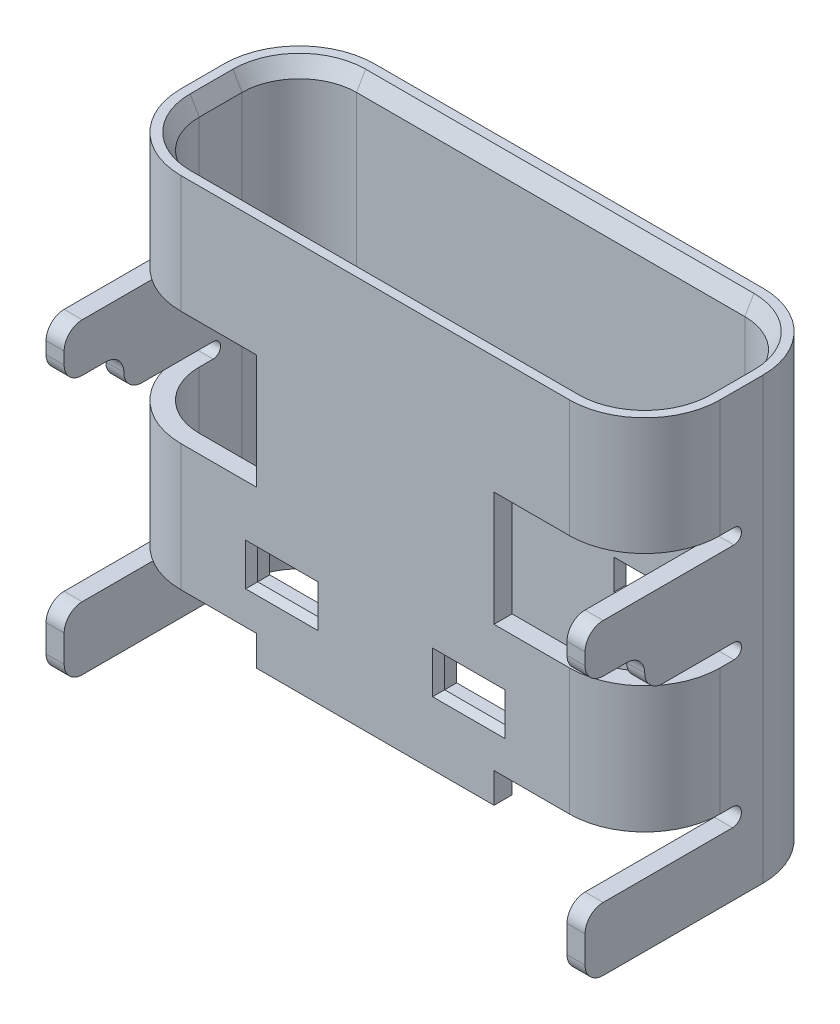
ISO-10303-21;
HEADER;
FILE_DESCRIPTION(('STEP AP214'),'2;1');
FILE_NAME('part.step','',(''),(''),'','','');
FILE_SCHEMA(('AUTOMOTIVE_DESIGN { 1 0 10303 214 1 1 1 1 }'));
ENDSEC;
DATA;
#1=APPLICATION_CONTEXT('core data for automotive mechanical design processes');
#2=APPLICATION_PROTOCOL_DEFINITION('international standard','automotive_design',2000,#1);
#3=PRODUCT_CONTEXT('',#1,'mechanical');
#4=PRODUCT('Part','Part','',(#3));
#5=PRODUCT_RELATED_PRODUCT_CATEGORY('part','',(#4));
#6=PRODUCT_DEFINITION_FORMATION('','',#4);
#7=PRODUCT_DEFINITION_CONTEXT('part definition',#1,'design');
#8=PRODUCT_DEFINITION('design','',#6,#7);
#9=PRODUCT_DEFINITION_SHAPE('','',#8);
#10=(LENGTH_UNIT() NAMED_UNIT(*) SI_UNIT(.MILLI.,.METRE.));
#11=(NAMED_UNIT(*) PLANE_ANGLE_UNIT() SI_UNIT($,.RADIAN.));
#12=(NAMED_UNIT(*) SI_UNIT($,.STERADIAN.) SOLID_ANGLE_UNIT());
#13=UNCERTAINTY_MEASURE_WITH_UNIT(LENGTH_MEASURE(1.E-05),#10,'distance_accuracy_value','');
#14=(GEOMETRIC_REPRESENTATION_CONTEXT(3) GLOBAL_UNCERTAINTY_ASSIGNED_CONTEXT((#13)) GLOBAL_UNIT_ASSIGNED_CONTEXT((#10,
#11,#12)) REPRESENTATION_CONTEXT('',''));
#15=CARTESIAN_POINT('',(0.,0.,0.));
#16=DIRECTION('',(0.,0.,1.));
#17=DIRECTION('',(1.,0.,0.));
#18=AXIS2_PLACEMENT_3D('',#15,#16,#17);
#19=CARTESIAN_POINT('',(-2.050446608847,2.,-1.505));
#20=DIRECTION('',(-0.707106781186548,0.,0.707106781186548));
#21=DIRECTION('',(0.,1.,0.));
#22=AXIS2_PLACEMENT_3D('',#19,#20,#21);
#23=PLANE('',#22);
#24=DIRECTION('',(0.577350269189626,0.577350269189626,0.577350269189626));
#25=VECTOR('',#24,1.);
#26=CARTESIAN_POINT('',(-2.050446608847,2.,-1.505));
#27=LINE('',#26,#25);
#28=CARTESIAN_POINT('',(-2.150446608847,1.9,-1.605));
#29=VERTEX_POINT('',#28);
#30=CARTESIAN_POINT('',(-2.050446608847,2.,-1.505));
#31=VERTEX_POINT('',#30);
#32=EDGE_CURVE('E11',#29,#31,#27,.T.);
#33=ORIENTED_EDGE('',*,*,#32,.F.);
#34=DIRECTION('',(0.,-1.,0.));
#35=VECTOR('',#34,1.);
#36=CARTESIAN_POINT('',(-2.150446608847,7.3,-1.605));
#37=LINE('',#36,#35);
#38=CARTESIAN_POINT('',(-2.150446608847,2.6,-1.605));
#39=VERTEX_POINT('',#38);
#40=EDGE_CURVE('E1767',#39,#29,#37,.T.);
#41=ORIENTED_EDGE('',*,*,#40,.F.);
#42=DIRECTION('',(-0.577350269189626,0.577350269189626,-0.577350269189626));
#43=VECTOR('',#42,1.);
#44=CARTESIAN_POINT('',(-1.717113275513,2.166666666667,-1.171666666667));
#45=LINE('',#44,#43);
#46=CARTESIAN_POINT('',(-2.050446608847,2.5,-1.505));
#47=VERTEX_POINT('',#46);
#48=EDGE_CURVE('E38',#47,#39,#45,.T.);
#49=ORIENTED_EDGE('',*,*,#48,.F.);
#50=DIRECTION('',(0.,1.,0.));
#51=VECTOR('',#50,1.);
#52=CARTESIAN_POINT('',(-2.050446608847,2.,-1.505));
#53=LINE('',#52,#51);
#54=EDGE_CURVE('E1520',#31,#47,#53,.T.);
#55=ORIENTED_EDGE('',*,*,#54,.F.);
#56=EDGE_LOOP('',(#33,#41,#49,#55));
#57=FACE_BOUND('',#56,.T.);
#58=ADVANCED_FACE('F17',(#57),#23,.F.);
#59=CARTESIAN_POINT('',(-1.050446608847,2.,-1.505));
#60=DIRECTION('',(0.,-0.707106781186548,0.707106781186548));
#61=DIRECTION('',(-1.,0.,0.));
#62=AXIS2_PLACEMENT_3D('',#59,#60,#61);
#63=PLANE('',#62);
#64=ORIENTED_EDGE('',*,*,#32,.T.);
#65=DIRECTION('',(-1.,0.,0.));
#66=VECTOR('',#65,1.);
#67=CARTESIAN_POINT('',(-1.050446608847,2.,-1.505));
#68=LINE('',#67,#66);
#69=CARTESIAN_POINT('',(-1.050446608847,2.,-1.505));
#70=VERTEX_POINT('',#69);
#71=EDGE_CURVE('E1849',#70,#31,#68,.T.);
#72=ORIENTED_EDGE('',*,*,#71,.F.);
#73=DIRECTION('',(-0.577350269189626,0.577350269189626,0.577350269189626));
#74=VECTOR('',#73,1.);
#75=CARTESIAN_POINT('',(-1.050446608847,2.,-1.505));
#76=LINE('',#75,#74);
#77=CARTESIAN_POINT('',(-0.950446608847,1.9,-1.605));
#78=VERTEX_POINT('',#77);
#79=EDGE_CURVE('E25',#78,#70,#76,.T.);
#80=ORIENTED_EDGE('',*,*,#79,.F.);
#81=DIRECTION('',(1.,0.,0.));
#82=VECTOR('',#81,1.);
#83=CARTESIAN_POINT('',(-4.47,1.9,-1.605));
#84=LINE('',#83,#82);
#85=EDGE_CURVE('E1755',#29,#78,#84,.T.);
#86=ORIENTED_EDGE('',*,*,#85,.F.);
#87=EDGE_LOOP('',(#64,#72,#80,#86));
#88=FACE_BOUND('',#87,.T.);
#89=ADVANCED_FACE('F1874',(#88),#63,.F.);
#90=CARTESIAN_POINT('',(-1.050446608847,2.,-1.505));
#91=DIRECTION('',(0.707106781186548,0.,0.707106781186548));
#92=DIRECTION('',(0.,-1.,0.));
#93=AXIS2_PLACEMENT_3D('',#90,#91,#92);
#94=PLANE('',#93);
#95=DIRECTION('',(0.577350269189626,0.577350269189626,-0.577350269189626));
#96=VECTOR('',#95,1.);
#97=CARTESIAN_POINT('',(-1.217113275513,2.333333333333,-1.338333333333));
#98=LINE('',#97,#96);
#99=CARTESIAN_POINT('',(-1.050446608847,2.5,-1.505));
#100=VERTEX_POINT('',#99);
#101=CARTESIAN_POINT('',(-0.950446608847,2.6,-1.605));
#102=VERTEX_POINT('',#101);
#103=EDGE_CURVE('E1865',#100,#102,#98,.T.);
#104=ORIENTED_EDGE('',*,*,#103,.T.);
#105=DIRECTION('',(0.,1.,0.));
#106=VECTOR('',#105,1.);
#107=CARTESIAN_POINT('',(-0.950446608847,7.3,-1.605));
#108=LINE('',#107,#106);
#109=EDGE_CURVE('E1759',#78,#102,#108,.T.);
#110=ORIENTED_EDGE('',*,*,#109,.F.);
#111=ORIENTED_EDGE('',*,*,#79,.T.);
#112=DIRECTION('',(0.,-1.,0.));
#113=VECTOR('',#112,1.);
#114=CARTESIAN_POINT('',(-1.050446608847,2.,-1.505));
#115=LINE('',#114,#113);
#116=EDGE_CURVE('E1841',#100,#70,#115,.T.);
#117=ORIENTED_EDGE('',*,*,#116,.F.);
#118=EDGE_LOOP('',(#104,#110,#111,#117));
#119=FACE_BOUND('',#118,.T.);
#120=ADVANCED_FACE('F1873',(#119),#94,.F.);
#121=CARTESIAN_POINT('',(-1.050446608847,2.5,-1.505));
#122=DIRECTION('',(0.,0.707106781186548,0.707106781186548));
#123=DIRECTION('',(1.,0.,0.));
#124=AXIS2_PLACEMENT_3D('',#121,#122,#123);
#125=PLANE('',#124);
#126=ORIENTED_EDGE('',*,*,#48,.T.);
#127=DIRECTION('',(-1.,0.,0.));
#128=VECTOR('',#127,1.);
#129=CARTESIAN_POINT('',(-4.47,2.6,-1.605));
#130=LINE('',#129,#128);
#131=EDGE_CURVE('E1763',#102,#39,#130,.T.);
#132=ORIENTED_EDGE('',*,*,#131,.F.);
#133=ORIENTED_EDGE('',*,*,#103,.F.);
#134=DIRECTION('',(1.,0.,0.));
#135=VECTOR('',#134,1.);
#136=CARTESIAN_POINT('',(-1.050446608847,2.5,-1.505));
#137=LINE('',#136,#135);
#138=EDGE_CURVE('E1519',#47,#100,#137,.T.);
#139=ORIENTED_EDGE('',*,*,#138,.F.);
#140=EDGE_LOOP('',(#126,#132,#133,#139));
#141=FACE_BOUND('',#140,.T.);
#142=ADVANCED_FACE('F1885',(#141),#125,.F.);
#143=CARTESIAN_POINT('',(-1.050446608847,2.5,2.595));
#144=DIRECTION('',(0.,1.,0.));
#145=DIRECTION('',(1.,0.,0.));
#146=AXIS2_PLACEMENT_3D('',#143,#144,#145);
#147=PLANE('',#146);
#148=DIRECTION('',(0.,0.,-1.));
#149=VECTOR('',#148,1.);
#150=CARTESIAN_POINT('',(-2.050446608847,2.5,2.595));
#151=LINE('',#150,#149);
#152=CARTESIAN_POINT('',(-2.050446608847,2.5,-1.305));
#153=VERTEX_POINT('',#152);
#154=EDGE_CURVE('E1515',#153,#47,#151,.T.);
#155=ORIENTED_EDGE('',*,*,#154,.T.);
#156=ORIENTED_EDGE('',*,*,#138,.T.);
#157=DIRECTION('',(0.,0.,-1.));
#158=VECTOR('',#157,1.);
#159=CARTESIAN_POINT('',(-1.050446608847,2.5,2.595));
#160=LINE('',#159,#158);
#161=CARTESIAN_POINT('',(-1.050446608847,2.5,-1.305));
#162=VERTEX_POINT('',#161);
#163=EDGE_CURVE('E1837',#162,#100,#160,.T.);
#164=ORIENTED_EDGE('',*,*,#163,.F.);
#165=DIRECTION('',(1.,0.,0.));
#166=VECTOR('',#165,1.);
#167=CARTESIAN_POINT('',(0.,2.5,-1.305));
#168=LINE('',#167,#166);
#169=EDGE_CURVE('E1806',#153,#162,#168,.T.);
#170=ORIENTED_EDGE('',*,*,#169,.F.);
#171=EDGE_LOOP('',(#155,#156,#164,#170));
#172=FACE_BOUND('',#171,.T.);
#173=ADVANCED_FACE('F1883',(#172),#147,.F.);
#174=CARTESIAN_POINT('',(-2.050446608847,2.,2.595));
#175=DIRECTION('',(-1.,0.,0.));
#176=DIRECTION('',(0.,0.,1.));
#177=AXIS2_PLACEMENT_3D('',#174,#175,#176);
#178=PLANE('',#177);
#179=DIRECTION('',(0.,0.,-1.));
#180=VECTOR('',#179,1.);
#181=CARTESIAN_POINT('',(-2.050446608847,2.,2.595));
#182=LINE('',#181,#180);
#183=CARTESIAN_POINT('',(-2.050446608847,2.,-1.305));
#184=VERTEX_POINT('',#183);
#185=EDGE_CURVE('E1853',#184,#31,#182,.T.);
#186=ORIENTED_EDGE('',*,*,#185,.T.);
#187=ORIENTED_EDGE('',*,*,#54,.T.);
#188=ORIENTED_EDGE('',*,*,#154,.F.);
#189=DIRECTION('',(0.,1.,0.));
#190=VECTOR('',#189,1.);
#191=CARTESIAN_POINT('',(-2.050446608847,0.,-1.305));
#192=LINE('',#191,#190);
#193=EDGE_CURVE('E1684',#184,#153,#192,.T.);
#194=ORIENTED_EDGE('',*,*,#193,.F.);
#195=EDGE_LOOP('',(#186,#187,#188,#194));
#196=FACE_BOUND('',#195,.T.);
#197=ADVANCED_FACE('F1892',(#196),#178,.F.);
#198=CARTESIAN_POINT('',(-1.050446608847,2.,2.595));
#199=DIRECTION('',(0.,-1.,0.));
#200=DIRECTION('',(0.,0.,-1.));
#201=AXIS2_PLACEMENT_3D('',#198,#199,#200);
#202=PLANE('',#201);
#203=DIRECTION('',(0.,0.,-1.));
#204=VECTOR('',#203,1.);
#205=CARTESIAN_POINT('',(-1.050446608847,2.,2.595));
#206=LINE('',#205,#204);
#207=CARTESIAN_POINT('',(-1.050446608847,2.,-1.305));
#208=VERTEX_POINT('',#207);
#209=EDGE_CURVE('E1845',#208,#70,#206,.T.);
#210=ORIENTED_EDGE('',*,*,#209,.T.);
#211=ORIENTED_EDGE('',*,*,#71,.T.);
#212=ORIENTED_EDGE('',*,*,#185,.F.);
#213=DIRECTION('',(-1.,0.,0.));
#214=VECTOR('',#213,1.);
#215=CARTESIAN_POINT('',(0.,2.,-1.305));
#216=LINE('',#215,#214);
#217=EDGE_CURVE('E1680',#208,#184,#216,.T.);
#218=ORIENTED_EDGE('',*,*,#217,.F.);
#219=EDGE_LOOP('',(#210,#211,#212,#218));
#220=FACE_BOUND('',#219,.T.);
#221=ADVANCED_FACE('F1877',(#220),#202,.F.);
#222=CARTESIAN_POINT('',(-1.050446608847,2.,2.595));
#223=DIRECTION('',(1.,0.,0.));
#224=DIRECTION('',(0.,1.,0.));
#225=AXIS2_PLACEMENT_3D('',#222,#223,#224);
#226=PLANE('',#225);
#227=ORIENTED_EDGE('',*,*,#163,.T.);
#228=ORIENTED_EDGE('',*,*,#116,.T.);
#229=ORIENTED_EDGE('',*,*,#209,.F.);
#230=DIRECTION('',(0.,-1.,0.));
#231=VECTOR('',#230,1.);
#232=CARTESIAN_POINT('',(-1.050446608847,0.,-1.305));
#233=LINE('',#232,#231);
#234=EDGE_CURVE('E1810',#162,#208,#233,.T.);
#235=ORIENTED_EDGE('',*,*,#234,.F.);
#236=EDGE_LOOP('',(#227,#228,#229,#235));
#237=FACE_BOUND('',#236,.T.);
#238=ADVANCED_FACE('F1880',(#237),#226,.F.);
#239=CARTESIAN_POINT('',(1.050446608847,2.5,2.595));
#240=DIRECTION('',(0.,1.,0.));
#241=DIRECTION('',(1.,0.,0.));
#242=AXIS2_PLACEMENT_3D('',#239,#240,#241);
#243=PLANE('',#242);
#244=DIRECTION('',(0.,0.,-1.));
#245=VECTOR('',#244,1.);
#246=CARTESIAN_POINT('',(1.050446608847,2.5,2.595));
#247=LINE('',#246,#245);
#248=CARTESIAN_POINT('',(1.050446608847,2.5,-1.305));
#249=VERTEX_POINT('',#248);
#250=CARTESIAN_POINT('',(1.050446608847,2.5,-1.505));
#251=VERTEX_POINT('',#250);
#252=EDGE_CURVE('E968',#249,#251,#247,.T.);
#253=ORIENTED_EDGE('',*,*,#252,.T.);
#254=DIRECTION('',(1.,0.,0.));
#255=VECTOR('',#254,1.);
#256=CARTESIAN_POINT('',(1.050446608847,2.5,-1.505));
#257=LINE('',#256,#255);
#258=CARTESIAN_POINT('',(2.050446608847,2.5,-1.505));
#259=VERTEX_POINT('',#258);
#260=EDGE_CURVE('E1834',#251,#259,#257,.T.);
#261=ORIENTED_EDGE('',*,*,#260,.T.);
#262=DIRECTION('',(0.,0.,-1.));
#263=VECTOR('',#262,1.);
#264=CARTESIAN_POINT('',(2.050446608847,2.5,2.595));
#265=LINE('',#264,#263);
#266=CARTESIAN_POINT('',(2.050446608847,2.5,-1.305));
#267=VERTEX_POINT('',#266);
#268=EDGE_CURVE('E1819',#267,#259,#265,.T.);
#269=ORIENTED_EDGE('',*,*,#268,.F.);
#270=DIRECTION('',(1.,0.,0.));
#271=VECTOR('',#270,1.);
#272=CARTESIAN_POINT('',(0.,2.5,-1.305));
#273=LINE('',#272,#271);
#274=EDGE_CURVE('E1613',#249,#267,#273,.T.);
#275=ORIENTED_EDGE('',*,*,#274,.F.);
#276=EDGE_LOOP('',(#253,#261,#269,#275));
#277=FACE_BOUND('',#276,.T.);
#278=ADVANCED_FACE('F3724',(#277),#243,.F.);
#279=CARTESIAN_POINT('',(1.050446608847,2.5,-1.505));
#280=DIRECTION('',(0.,0.707106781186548,0.707106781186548));
#281=DIRECTION('',(1.,0.,0.));
#282=AXIS2_PLACEMENT_3D('',#279,#280,#281);
#283=PLANE('',#282);
#284=DIRECTION('',(-0.577350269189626,0.577350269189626,-0.577350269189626));
#285=VECTOR('',#284,1.);
#286=CARTESIAN_POINT('',(1.050446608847,2.5,-1.505));
#287=LINE('',#286,#285);
#288=CARTESIAN_POINT('',(0.950446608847,2.6,-1.605));
#289=VERTEX_POINT('',#288);
#290=EDGE_CURVE('E1791',#251,#289,#287,.T.);
#291=ORIENTED_EDGE('',*,*,#290,.T.);
#292=DIRECTION('',(-1.,0.,0.));
#293=VECTOR('',#292,1.);
#294=CARTESIAN_POINT('',(-4.47,2.6,-1.605));
#295=LINE('',#294,#293);
#296=CARTESIAN_POINT('',(2.150446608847,2.6,-1.605));
#297=VERTEX_POINT('',#296);
#298=EDGE_CURVE('E1779',#297,#289,#295,.T.);
#299=ORIENTED_EDGE('',*,*,#298,.F.);
#300=DIRECTION('',(0.577350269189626,0.577350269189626,-0.577350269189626));
#301=VECTOR('',#300,1.);
#302=CARTESIAN_POINT('',(1.88377994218,2.333333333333,-1.338333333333));
#303=LINE('',#302,#301);
#304=EDGE_CURVE('E1831',#259,#297,#303,.T.);
#305=ORIENTED_EDGE('',*,*,#304,.F.);
#306=ORIENTED_EDGE('',*,*,#260,.F.);
#307=EDGE_LOOP('',(#291,#299,#305,#306));
#308=FACE_BOUND('',#307,.T.);
#309=ADVANCED_FACE('F3718',(#308),#283,.F.);
#310=CARTESIAN_POINT('',(2.050446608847,2.,-1.505));
#311=DIRECTION('',(0.707106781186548,0.,0.707106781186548));
#312=DIRECTION('',(0.,-1.,0.));
#313=AXIS2_PLACEMENT_3D('',#310,#311,#312);
#314=PLANE('',#313);
#315=ORIENTED_EDGE('',*,*,#304,.T.);
#316=DIRECTION('',(0.,1.,0.));
#317=VECTOR('',#316,1.);
#318=CARTESIAN_POINT('',(2.150446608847,7.3,-1.605));
#319=LINE('',#318,#317);
#320=CARTESIAN_POINT('',(2.150446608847,1.9,-1.605));
#321=VERTEX_POINT('',#320);
#322=EDGE_CURVE('E1775',#321,#297,#319,.T.);
#323=ORIENTED_EDGE('',*,*,#322,.F.);
#324=DIRECTION('',(-0.577350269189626,0.577350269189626,0.577350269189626));
#325=VECTOR('',#324,1.);
#326=CARTESIAN_POINT('',(2.050446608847,2.,-1.505));
#327=LINE('',#326,#325);
#328=CARTESIAN_POINT('',(2.050446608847,2.,-1.505));
#329=VERTEX_POINT('',#328);
#330=EDGE_CURVE('E1828',#321,#329,#327,.T.);
#331=ORIENTED_EDGE('',*,*,#330,.T.);
#332=DIRECTION('',(0.,-1.,0.));
#333=VECTOR('',#332,1.);
#334=CARTESIAN_POINT('',(2.050446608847,2.,-1.505));
#335=LINE('',#334,#333);
#336=EDGE_CURVE('E1368',#259,#329,#335,.T.);
#337=ORIENTED_EDGE('',*,*,#336,.F.);
#338=EDGE_LOOP('',(#315,#323,#331,#337));
#339=FACE_BOUND('',#338,.T.);
#340=ADVANCED_FACE('F3723',(#339),#314,.F.);
#341=CARTESIAN_POINT('',(1.050446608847,2.,-1.505));
#342=DIRECTION('',(0.,-0.707106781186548,0.707106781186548));
#343=DIRECTION('',(-1.,0.,0.));
#344=AXIS2_PLACEMENT_3D('',#341,#342,#343);
#345=PLANE('',#344);
#346=DIRECTION('',(0.577350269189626,0.577350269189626,0.577350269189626));
#347=VECTOR('',#346,1.);
#348=CARTESIAN_POINT('',(1.050446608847,2.,-1.505));
#349=LINE('',#348,#347);
#350=CARTESIAN_POINT('',(0.950446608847,1.9,-1.605));
#351=VERTEX_POINT('',#350);
#352=CARTESIAN_POINT('',(1.050446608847,2.,-1.505));
#353=VERTEX_POINT('',#352);
#354=EDGE_CURVE('E1787',#351,#353,#349,.T.);
#355=ORIENTED_EDGE('',*,*,#354,.T.);
#356=DIRECTION('',(-1.,0.,0.));
#357=VECTOR('',#356,1.);
#358=CARTESIAN_POINT('',(1.050446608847,2.,-1.505));
#359=LINE('',#358,#357);
#360=EDGE_CURVE('E1367',#329,#353,#359,.T.);
#361=ORIENTED_EDGE('',*,*,#360,.F.);
#362=ORIENTED_EDGE('',*,*,#330,.F.);
#363=DIRECTION('',(1.,0.,0.));
#364=VECTOR('',#363,1.);
#365=CARTESIAN_POINT('',(-4.47,1.9,-1.605));
#366=LINE('',#365,#364);
#367=EDGE_CURVE('E1771',#351,#321,#366,.T.);
#368=ORIENTED_EDGE('',*,*,#367,.F.);
#369=EDGE_LOOP('',(#355,#361,#362,#368));
#370=FACE_BOUND('',#369,.T.);
#371=ADVANCED_FACE('F4528',(#370),#345,.F.);
#372=CARTESIAN_POINT('',(1.050446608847,2.,2.595));
#373=DIRECTION('',(0.,-1.,0.));
#374=DIRECTION('',(0.,0.,-1.));
#375=AXIS2_PLACEMENT_3D('',#372,#373,#374);
#376=PLANE('',#375);
#377=DIRECTION('',(0.,0.,-1.));
#378=VECTOR('',#377,1.);
#379=CARTESIAN_POINT('',(2.050446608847,2.,2.595));
#380=LINE('',#379,#378);
#381=CARTESIAN_POINT('',(2.050446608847,2.,-1.305));
#382=VERTEX_POINT('',#381);
#383=EDGE_CURVE('E1363',#382,#329,#380,.T.);
#384=ORIENTED_EDGE('',*,*,#383,.T.);
#385=ORIENTED_EDGE('',*,*,#360,.T.);
#386=DIRECTION('',(0.,0.,-1.));
#387=VECTOR('',#386,1.);
#388=CARTESIAN_POINT('',(1.050446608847,2.,2.595));
#389=LINE('',#388,#387);
#390=CARTESIAN_POINT('',(1.050446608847,2.,-1.305));
#391=VERTEX_POINT('',#390);
#392=EDGE_CURVE('E973',#391,#353,#389,.T.);
#393=ORIENTED_EDGE('',*,*,#392,.F.);
#394=DIRECTION('',(-1.,0.,0.));
#395=VECTOR('',#394,1.);
#396=CARTESIAN_POINT('',(0.,2.,-1.305));
#397=LINE('',#396,#395);
#398=EDGE_CURVE('E1618',#382,#391,#397,.T.);
#399=ORIENTED_EDGE('',*,*,#398,.F.);
#400=EDGE_LOOP('',(#384,#385,#393,#399));
#401=FACE_BOUND('',#400,.T.);
#402=ADVANCED_FACE('F4533',(#401),#376,.F.);
#403=CARTESIAN_POINT('',(2.050446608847,2.,2.595));
#404=DIRECTION('',(1.,0.,0.));
#405=DIRECTION('',(0.,1.,0.));
#406=AXIS2_PLACEMENT_3D('',#403,#404,#405);
#407=PLANE('',#406);
#408=ORIENTED_EDGE('',*,*,#268,.T.);
#409=ORIENTED_EDGE('',*,*,#336,.T.);
#410=ORIENTED_EDGE('',*,*,#383,.F.);
#411=DIRECTION('',(0.,-1.,0.));
#412=VECTOR('',#411,1.);
#413=CARTESIAN_POINT('',(2.050446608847,0.,-1.305));
#414=LINE('',#413,#412);
#415=EDGE_CURVE('E1617',#267,#382,#414,.T.);
#416=ORIENTED_EDGE('',*,*,#415,.F.);
#417=EDGE_LOOP('',(#408,#409,#410,#416));
#418=FACE_BOUND('',#417,.T.);
#419=ADVANCED_FACE('F4551',(#418),#407,.F.);
#420=CARTESIAN_POINT('',(3.22,0.,-0.355));
#421=DIRECTION('',(0.,1.,0.));
#422=DIRECTION('',(-0.707106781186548,0.,0.707106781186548));
#423=AXIS2_PLACEMENT_3D('',#420,#421,#422);
#424=CYLINDRICAL_SURFACE('',#423,0.95);
#425=DIRECTION('',(0.,1.,0.));
#426=VECTOR('',#425,1.);
#427=CARTESIAN_POINT('',(4.17,0.,-0.355));
#428=LINE('',#427,#426);
#429=CARTESIAN_POINT('',(4.17,0.,-0.355));
#430=VERTEX_POINT('',#429);
#431=CARTESIAN_POINT('',(4.17,7.040192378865,-0.355));
#432=VERTEX_POINT('',#431);
#433=EDGE_CURVE('E963',#430,#432,#428,.T.);
#434=ORIENTED_EDGE('',*,*,#433,.T.);
#435=CARTESIAN_POINT('',(3.22,7.040192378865,-0.355));
#436=DIRECTION('',(0.,1.,0.));
#437=DIRECTION('',(0.,0.,-1.));
#438=AXIS2_PLACEMENT_3D('',#435,#436,#437);
#439=CIRCLE('',#438,0.95);
#440=CARTESIAN_POINT('',(3.22,7.040192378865,-1.305));
#441=VERTEX_POINT('',#440);
#442=EDGE_CURVE('E1277',#432,#441,#439,.T.);
#443=ORIENTED_EDGE('',*,*,#442,.T.);
#444=DIRECTION('',(0.,1.,0.));
#445=VECTOR('',#444,1.);
#446=CARTESIAN_POINT('',(3.22,0.,-1.305));
#447=LINE('',#446,#445);
#448=CARTESIAN_POINT('',(3.22,0.,-1.305));
#449=VERTEX_POINT('',#448);
#450=EDGE_CURVE('E1685',#449,#441,#447,.T.);
#451=ORIENTED_EDGE('',*,*,#450,.F.);
#452=CARTESIAN_POINT('',(3.22,0.,-0.355));
#453=DIRECTION('',(0.,1.,0.));
#454=DIRECTION('',(0.,0.,1.));
#455=AXIS2_PLACEMENT_3D('',#452,#453,#454);
#456=CIRCLE('',#455,0.95);
#457=EDGE_CURVE('E887',#430,#449,#456,.T.);
#458=ORIENTED_EDGE('',*,*,#457,.F.);
#459=EDGE_LOOP('',(#434,#443,#451,#458));
#460=FACE_BOUND('',#459,.T.);
#461=ADVANCED_FACE('F1898',(#460),#424,.F.);
#462=CARTESIAN_POINT('',(0.,0.,-1.305));
#463=DIRECTION('',(0.,0.,-1.));
#464=DIRECTION('',(-1.,0.,0.));
#465=AXIS2_PLACEMENT_3D('',#462,#463,#464);
#466=PLANE('',#465);
#467=ORIENTED_EDGE('',*,*,#398,.T.);
#468=DIRECTION('',(0.,1.,0.));
#469=VECTOR('',#468,1.);
#470=CARTESIAN_POINT('',(1.050446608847,0.,-1.305));
#471=LINE('',#470,#469);
#472=EDGE_CURVE('E972',#391,#249,#471,.T.);
#473=ORIENTED_EDGE('',*,*,#472,.T.);
#474=ORIENTED_EDGE('',*,*,#274,.T.);
#475=ORIENTED_EDGE('',*,*,#415,.T.);
#476=EDGE_LOOP('',(#467,#473,#474,#475));
#477=FACE_BOUND('',#476,.T.);
#478=ORIENTED_EDGE('',*,*,#217,.T.);
#479=ORIENTED_EDGE('',*,*,#193,.T.);
#480=ORIENTED_EDGE('',*,*,#169,.T.);
#481=ORIENTED_EDGE('',*,*,#234,.T.);
#482=EDGE_LOOP('',(#478,#479,#480,#481));
#483=FACE_BOUND('',#482,.T.);
#484=ORIENTED_EDGE('',*,*,#450,.T.);
#485=DIRECTION('',(-1.,0.,0.));
#486=VECTOR('',#485,1.);
#487=CARTESIAN_POINT('',(0.,7.040192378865,-1.305));
#488=LINE('',#487,#486);
#489=CARTESIAN_POINT('',(-3.22,7.040192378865,-1.305));
#490=VERTEX_POINT('',#489);
#491=EDGE_CURVE('E947',#441,#490,#488,.T.);
#492=ORIENTED_EDGE('',*,*,#491,.T.);
#493=DIRECTION('',(0.,1.,0.));
#494=VECTOR('',#493,1.);
#495=CARTESIAN_POINT('',(-3.22,0.,-1.305));
#496=LINE('',#495,#494);
#497=CARTESIAN_POINT('',(-3.22,0.,-1.305));
#498=VERTEX_POINT('',#497);
#499=EDGE_CURVE('E1267',#498,#490,#496,.T.);
#500=ORIENTED_EDGE('',*,*,#499,.F.);
#501=DIRECTION('',(-1.,0.,0.));
#502=VECTOR('',#501,1.);
#503=CARTESIAN_POINT('',(0.,0.,-1.305));
#504=LINE('',#503,#502);
#505=EDGE_CURVE('E891',#449,#498,#504,.T.);
#506=ORIENTED_EDGE('',*,*,#505,.F.);
#507=EDGE_LOOP('',(#484,#492,#500,#506));
#508=FACE_BOUND('',#507,.T.);
#509=ADVANCED_FACE('F1894',(#477,#483,#508),#466,.F.);
#510=CARTESIAN_POINT('',(1.050446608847,2.,2.595));
#511=DIRECTION('',(-1.,0.,0.));
#512=DIRECTION('',(0.,0.,1.));
#513=AXIS2_PLACEMENT_3D('',#510,#511,#512);
#514=PLANE('',#513);
#515=ORIENTED_EDGE('',*,*,#392,.T.);
#516=DIRECTION('',(0.,1.,0.));
#517=VECTOR('',#516,1.);
#518=CARTESIAN_POINT('',(1.050446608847,2.,-1.505));
#519=LINE('',#518,#517);
#520=EDGE_CURVE('E1794',#353,#251,#519,.T.);
#521=ORIENTED_EDGE('',*,*,#520,.T.);
#522=ORIENTED_EDGE('',*,*,#252,.F.);
#523=ORIENTED_EDGE('',*,*,#472,.F.);
#524=EDGE_LOOP('',(#515,#521,#522,#523));
#525=FACE_BOUND('',#524,.T.);
#526=ADVANCED_FACE('F1897',(#525),#514,.F.);
#527=CARTESIAN_POINT('',(1.050446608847,2.,-1.505));
#528=DIRECTION('',(-0.707106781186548,0.,0.707106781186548));
#529=DIRECTION('',(0.,1.,0.));
#530=AXIS2_PLACEMENT_3D('',#527,#528,#529);
#531=PLANE('',#530);
#532=ORIENTED_EDGE('',*,*,#354,.F.);
#533=DIRECTION('',(0.,-1.,0.));
#534=VECTOR('',#533,1.);
#535=CARTESIAN_POINT('',(0.950446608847,7.3,-1.605));
#536=LINE('',#535,#534);
#537=EDGE_CURVE('E1783',#289,#351,#536,.T.);
#538=ORIENTED_EDGE('',*,*,#537,.F.);
#539=ORIENTED_EDGE('',*,*,#290,.F.);
#540=ORIENTED_EDGE('',*,*,#520,.F.);
#541=EDGE_LOOP('',(#532,#538,#539,#540));
#542=FACE_BOUND('',#541,.T.);
#543=ADVANCED_FACE('F4252',(#542),#531,.F.);
#544=CARTESIAN_POINT('',(-4.47,7.3,-1.605));
#545=DIRECTION('',(0.,0.,1.));
#546=DIRECTION('',(1.,0.,0.));
#547=AXIS2_PLACEMENT_3D('',#544,#545,#546);
#548=PLANE('',#547);
#549=ORIENTED_EDGE('',*,*,#367,.T.);
#550=ORIENTED_EDGE('',*,*,#322,.T.);
#551=ORIENTED_EDGE('',*,*,#298,.T.);
#552=ORIENTED_EDGE('',*,*,#537,.T.);
#553=EDGE_LOOP('',(#549,#550,#551,#552));
#554=FACE_BOUND('',#553,.T.);
#555=ORIENTED_EDGE('',*,*,#85,.T.);
#556=ORIENTED_EDGE('',*,*,#109,.T.);
#557=ORIENTED_EDGE('',*,*,#131,.T.);
#558=ORIENTED_EDGE('',*,*,#40,.T.);
#559=EDGE_LOOP('',(#555,#556,#557,#558));
#560=FACE_BOUND('',#559,.T.);
#561=DIRECTION('',(-1.,0.,0.));
#562=VECTOR('',#561,1.);
#563=CARTESIAN_POINT('',(-4.47,0.,-1.605));
#564=LINE('',#563,#562);
#565=CARTESIAN_POINT('',(3.22,0.,-1.605));
#566=VERTEX_POINT('',#565);
#567=CARTESIAN_POINT('',(-3.22,0.,-1.605));
#568=VERTEX_POINT('',#567);
#569=EDGE_CURVE('E1252',#566,#568,#564,.T.);
#570=ORIENTED_EDGE('',*,*,#569,.T.);
#571=DIRECTION('',(0.,1.,0.));
#572=VECTOR('',#571,1.);
#573=CARTESIAN_POINT('',(-3.22,7.3,-1.605));
#574=LINE('',#573,#572);
#575=CARTESIAN_POINT('',(-3.22,7.3,-1.605));
#576=VERTEX_POINT('',#575);
#577=EDGE_CURVE('E867',#568,#576,#574,.T.);
#578=ORIENTED_EDGE('',*,*,#577,.T.);
#579=DIRECTION('',(-1.,0.,0.));
#580=VECTOR('',#579,1.);
#581=CARTESIAN_POINT('',(-4.47,7.3,-1.605));
#582=LINE('',#581,#580);
#583=CARTESIAN_POINT('',(3.22,7.3,-1.605));
#584=VERTEX_POINT('',#583);
#585=EDGE_CURVE('E833',#584,#576,#582,.T.);
#586=ORIENTED_EDGE('',*,*,#585,.F.);
#587=DIRECTION('',(0.,-1.,0.));
#588=VECTOR('',#587,1.);
#589=CARTESIAN_POINT('',(3.22,7.3,-1.605));
#590=LINE('',#589,#588);
#591=EDGE_CURVE('E1710',#584,#566,#590,.T.);
#592=ORIENTED_EDGE('',*,*,#591,.T.);
#593=EDGE_LOOP('',(#570,#578,#586,#592));
#594=FACE_BOUND('',#593,.T.);
#595=ADVANCED_FACE('F1888',(#554,#560,#594),#548,.F.);
#596=CARTESIAN_POINT('',(3.22,7.3,-0.355));
#597=DIRECTION('',(0.,-1.,0.));
#598=DIRECTION('',(-0.707106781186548,0.,0.707106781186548));
#599=AXIS2_PLACEMENT_3D('',#596,#597,#598);
#600=CYLINDRICAL_SURFACE('',#599,1.25);
#601=CARTESIAN_POINT('',(3.22,7.3,-0.355));
#602=DIRECTION('',(0.,1.,0.));
#603=DIRECTION('',(0.,0.,-1.));
#604=AXIS2_PLACEMENT_3D('',#601,#602,#603);
#605=CIRCLE('',#604,1.25);
#606=CARTESIAN_POINT('',(4.47,7.3,-0.355));
#607=VERTEX_POINT('',#606);
#608=EDGE_CURVE('E829',#607,#584,#605,.T.);
#609=ORIENTED_EDGE('',*,*,#608,.F.);
#610=DIRECTION('',(0.,1.,0.));
#611=VECTOR('',#610,1.);
#612=CARTESIAN_POINT('',(4.47,7.3,-0.355));
#613=LINE('',#612,#611);
#614=CARTESIAN_POINT('',(4.47,0.,-0.355));
#615=VERTEX_POINT('',#614);
#616=EDGE_CURVE('E1293',#615,#607,#613,.T.);
#617=ORIENTED_EDGE('',*,*,#616,.F.);
#618=CARTESIAN_POINT('',(3.22,0.,-0.355));
#619=DIRECTION('',(0.,-1.,0.));
#620=DIRECTION('',(0.,0.,-1.));
#621=AXIS2_PLACEMENT_3D('',#618,#619,#620);
#622=CIRCLE('',#621,1.25);
#623=EDGE_CURVE('E1143',#566,#615,#622,.T.);
#624=ORIENTED_EDGE('',*,*,#623,.F.);
#625=ORIENTED_EDGE('',*,*,#591,.F.);
#626=EDGE_LOOP('',(#609,#617,#624,#625));
#627=FACE_BOUND('',#626,.T.);
#628=ADVANCED_FACE('F1967',(#627),#600,.T.);
#629=CARTESIAN_POINT('',(-4.471,4.3,2.595));
#630=DIRECTION('',(0.,1.,0.));
#631=DIRECTION('',(1.,0.,0.));
#632=AXIS2_PLACEMENT_3D('',#629,#630,#631);
#633=PLANE('',#632);
#634=DIRECTION('',(0.,0.,-1.));
#635=VECTOR('',#634,1.);
#636=CARTESIAN_POINT('',(4.17,4.3,2.595));
#637=LINE('',#636,#635);
#638=CARTESIAN_POINT('',(4.17,4.3,2.295));
#639=VERTEX_POINT('',#638);
#640=CARTESIAN_POINT('',(4.17,4.3,1.905));
#641=VERTEX_POINT('',#640);
#642=EDGE_CURVE('E861',#639,#641,#637,.T.);
#643=ORIENTED_EDGE('',*,*,#642,.T.);
#644=DIRECTION('',(1.,0.,0.));
#645=VECTOR('',#644,1.);
#646=CARTESIAN_POINT('',(4.47,4.3,1.905));
#647=LINE('',#646,#645);
#648=CARTESIAN_POINT('',(4.47,4.3,1.905));
#649=VERTEX_POINT('',#648);
#650=EDGE_CURVE('E1160',#641,#649,#647,.T.);
#651=ORIENTED_EDGE('',*,*,#650,.T.);
#652=DIRECTION('',(0.,0.,1.));
#653=VECTOR('',#652,1.);
#654=CARTESIAN_POINT('',(4.47,4.3,2.595));
#655=LINE('',#654,#653);
#656=CARTESIAN_POINT('',(4.47,4.3,2.295));
#657=VERTEX_POINT('',#656);
#658=EDGE_CURVE('E1103',#649,#657,#655,.T.);
#659=ORIENTED_EDGE('',*,*,#658,.T.);
#660=DIRECTION('',(-1.,0.,0.));
#661=VECTOR('',#660,1.);
#662=CARTESIAN_POINT('',(4.17,4.3,2.295));
#663=LINE('',#662,#661);
#664=EDGE_CURVE('E846',#657,#639,#663,.T.);
#665=ORIENTED_EDGE('',*,*,#664,.T.);
#666=EDGE_LOOP('',(#643,#651,#659,#665));
#667=FACE_BOUND('',#666,.T.);
#668=ADVANCED_FACE('F2024',(#667),#633,.F.);
#669=CARTESIAN_POINT('',(-4.17,7.040192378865,0.));
#670=DIRECTION('',(-0.866025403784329,-0.50000000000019,0.));
#671=DIRECTION('',(-0.50000000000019,0.866025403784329,0.));
#672=AXIS2_PLACEMENT_3D('',#669,#670,#671);
#673=PLANE('',#672);
#674=DIRECTION('',(0.50000000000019,-0.866025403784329,0.));
#675=VECTOR('',#674,1.);
#676=CARTESIAN_POINT('',(-4.32,7.3,-0.355));
#677=LINE('',#676,#675);
#678=CARTESIAN_POINT('',(-4.32,7.3,-0.355));
#679=VERTEX_POINT('',#678);
#680=CARTESIAN_POINT('',(-4.17,7.040192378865,-0.355));
#681=VERTEX_POINT('',#680);
#682=EDGE_CURVE('E902',#679,#681,#677,.T.);
#683=ORIENTED_EDGE('',*,*,#682,.F.);
#684=DIRECTION('',(0.,0.,-1.));
#685=VECTOR('',#684,1.);
#686=CARTESIAN_POINT('',(-4.32,7.3,0.));
#687=LINE('',#686,#685);
#688=CARTESIAN_POINT('',(-4.32,7.3,0.355));
#689=VERTEX_POINT('',#688);
#690=EDGE_CURVE('E1085',#689,#679,#687,.T.);
#691=ORIENTED_EDGE('',*,*,#690,.F.);
#692=DIRECTION('',(-0.50000000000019,0.866025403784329,0.));
#693=VECTOR('',#692,1.);
#694=CARTESIAN_POINT('',(-4.17,7.040192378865,0.355));
#695=LINE('',#694,#693);
#696=CARTESIAN_POINT('',(-4.17,7.040192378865,0.355));
#697=VERTEX_POINT('',#696);
#698=EDGE_CURVE('E1411',#697,#689,#695,.T.);
#699=ORIENTED_EDGE('',*,*,#698,.F.);
#700=DIRECTION('',(0.,0.,1.));
#701=VECTOR('',#700,1.);
#702=CARTESIAN_POINT('',(-4.17,7.040192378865,0.));
#703=LINE('',#702,#701);
#704=EDGE_CURVE('E874',#681,#697,#703,.T.);
#705=ORIENTED_EDGE('',*,*,#704,.F.);
#706=EDGE_LOOP('',(#683,#691,#699,#705));
#707=FACE_BOUND('',#706,.T.);
#708=ADVANCED_FACE('F1945',(#707),#673,.F.);
#709=CARTESIAN_POINT('',(-3.22,7.040192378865,0.355));
#710=DIRECTION('',(0.,1.,0.));
#711=DIRECTION('',(0.707106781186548,0.,-0.707106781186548));
#712=AXIS2_PLACEMENT_3D('',#709,#710,#711);
#713=CONICAL_SURFACE('',#712,0.95,0.523598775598);
#714=ORIENTED_EDGE('',*,*,#698,.T.);
#715=CARTESIAN_POINT('',(-3.22,7.3,0.355));
#716=DIRECTION('',(0.,-1.,0.));
#717=DIRECTION('',(0.,0.,-1.));
#718=AXIS2_PLACEMENT_3D('',#715,#716,#717);
#719=CIRCLE('',#718,1.1);
#720=CARTESIAN_POINT('',(-3.22,7.3,1.455));
#721=VERTEX_POINT('',#720);
#722=EDGE_CURVE('E1081',#721,#689,#719,.T.);
#723=ORIENTED_EDGE('',*,*,#722,.F.);
#724=DIRECTION('',(0.,0.866025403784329,0.50000000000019));
#725=VECTOR('',#724,1.);
#726=CARTESIAN_POINT('',(-3.22,7.040192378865,1.305));
#727=LINE('',#726,#725);
#728=CARTESIAN_POINT('',(-3.22,7.040192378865,1.305));
#729=VERTEX_POINT('',#728);
#730=EDGE_CURVE('E1450',#729,#721,#727,.T.);
#731=ORIENTED_EDGE('',*,*,#730,.F.);
#732=CARTESIAN_POINT('',(-3.22,7.040192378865,0.355));
#733=DIRECTION('',(0.,1.,0.));
#734=DIRECTION('',(0.,0.,-1.));
#735=AXIS2_PLACEMENT_3D('',#732,#733,#734);
#736=CIRCLE('',#735,0.95);
#737=EDGE_CURVE('E1408',#697,#729,#736,.T.);
#738=ORIENTED_EDGE('',*,*,#737,.F.);
#739=EDGE_LOOP('',(#714,#723,#731,#738));
#740=FACE_BOUND('',#739,.T.);
#741=ADVANCED_FACE('F2064',(#740),#713,.F.);
#742=CARTESIAN_POINT('',(-3.22,0.,0.355));
#743=DIRECTION('',(0.,1.,0.));
#744=DIRECTION('',(0.707106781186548,0.,-0.707106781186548));
#745=AXIS2_PLACEMENT_3D('',#742,#743,#744);
#746=CYLINDRICAL_SURFACE('',#745,0.95);
#747=DIRECTION('',(0.,1.,0.));
#748=VECTOR('',#747,1.);
#749=CARTESIAN_POINT('',(-3.22,0.,1.305));
#750=LINE('',#749,#748);
#751=CARTESIAN_POINT('',(-3.22,5.35,1.305));
#752=VERTEX_POINT('',#751);
#753=EDGE_CURVE('E1477',#752,#729,#750,.T.);
#754=ORIENTED_EDGE('',*,*,#753,.F.);
#755=CARTESIAN_POINT('',(-3.22,5.35,0.355));
#756=DIRECTION('',(0.,-1.,0.));
#757=DIRECTION('',(0.,0.,1.));
#758=AXIS2_PLACEMENT_3D('',#755,#756,#757);
#759=CIRCLE('',#758,0.95);
#760=CARTESIAN_POINT('',(-4.17,5.35,0.355));
#761=VERTEX_POINT('',#760);
#762=EDGE_CURVE('E1017',#752,#761,#759,.T.);
#763=ORIENTED_EDGE('',*,*,#762,.T.);
#764=DIRECTION('',(0.,1.,0.));
#765=VECTOR('',#764,1.);
#766=CARTESIAN_POINT('',(-4.17,0.,0.355));
#767=LINE('',#766,#765);
#768=EDGE_CURVE('E878',#761,#697,#767,.T.);
#769=ORIENTED_EDGE('',*,*,#768,.T.);
#770=ORIENTED_EDGE('',*,*,#737,.T.);
#771=EDGE_LOOP('',(#754,#763,#769,#770));
#772=FACE_BOUND('',#771,.T.);
#773=ADVANCED_FACE('F2066',(#772),#746,.F.);
#774=CARTESIAN_POINT('',(4.17,0.3,2.295));
#775=DIRECTION('',(1.,0.,0.));
#776=DIRECTION('',(0.,0.707106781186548,-0.707106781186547));
#777=AXIS2_PLACEMENT_3D('',#774,#775,#776);
#778=CYLINDRICAL_SURFACE('',#777,0.3);
#779=CARTESIAN_POINT('',(4.17,0.3,2.295));
#780=DIRECTION('',(-1.,0.,0.));
#781=DIRECTION('',(0.,0.,-1.));
#782=AXIS2_PLACEMENT_3D('',#779,#780,#781);
#783=CIRCLE('',#782,0.3);
#784=CARTESIAN_POINT('',(4.17,0.,2.295));
#785=VERTEX_POINT('',#784);
#786=CARTESIAN_POINT('',(4.17,0.3,2.595));
#787=VERTEX_POINT('',#786);
#788=EDGE_CURVE('E966',#785,#787,#783,.T.);
#789=ORIENTED_EDGE('',*,*,#788,.F.);
#790=DIRECTION('',(-1.,0.,0.));
#791=VECTOR('',#790,1.);
#792=CARTESIAN_POINT('',(0.,0.,2.295));
#793=LINE('',#792,#791);
#794=CARTESIAN_POINT('',(4.47,0.,2.295));
#795=VERTEX_POINT('',#794);
#796=EDGE_CURVE('E1039',#795,#785,#793,.T.);
#797=ORIENTED_EDGE('',*,*,#796,.F.);
#798=CARTESIAN_POINT('',(4.47,0.3,2.295));
#799=DIRECTION('',(1.,0.,0.));
#800=DIRECTION('',(0.,0.,1.));
#801=AXIS2_PLACEMENT_3D('',#798,#799,#800);
#802=CIRCLE('',#801,0.3);
#803=CARTESIAN_POINT('',(4.47,0.3,2.595));
#804=VERTEX_POINT('',#803);
#805=EDGE_CURVE('E1332',#804,#795,#802,.T.);
#806=ORIENTED_EDGE('',*,*,#805,.F.);
#807=DIRECTION('',(1.,0.,0.));
#808=VECTOR('',#807,1.);
#809=CARTESIAN_POINT('',(4.17,0.3,2.595));
#810=LINE('',#809,#808);
#811=EDGE_CURVE('E1412',#787,#804,#810,.T.);
#812=ORIENTED_EDGE('',*,*,#811,.F.);
#813=EDGE_LOOP('',(#789,#797,#806,#812));
#814=FACE_BOUND('',#813,.T.);
#815=ADVANCED_FACE('F1974',(#814),#778,.T.);
#816=CARTESIAN_POINT('',(4.17,0.,2.595));
#817=DIRECTION('',(0.,0.,1.));
#818=DIRECTION('',(1.,0.,0.));
#819=AXIS2_PLACEMENT_3D('',#816,#817,#818);
#820=PLANE('',#819);
#821=DIRECTION('',(0.,-1.,0.));
#822=VECTOR('',#821,1.);
#823=CARTESIAN_POINT('',(4.47,0.,2.595));
#824=LINE('',#823,#822);
#825=CARTESIAN_POINT('',(4.47,0.75,2.595));
#826=VERTEX_POINT('',#825);
#827=EDGE_CURVE('E1335',#826,#804,#824,.T.);
#828=ORIENTED_EDGE('',*,*,#827,.F.);
#829=DIRECTION('',(-1.,0.,0.));
#830=VECTOR('',#829,1.);
#831=CARTESIAN_POINT('',(4.17,0.75,2.595));
#832=LINE('',#831,#830);
#833=CARTESIAN_POINT('',(4.17,0.75,2.595));
#834=VERTEX_POINT('',#833);
#835=EDGE_CURVE('E1748',#826,#834,#832,.T.);
#836=ORIENTED_EDGE('',*,*,#835,.T.);
#837=DIRECTION('',(0.,-1.,0.));
#838=VECTOR('',#837,1.);
#839=CARTESIAN_POINT('',(4.17,0.,2.595));
#840=LINE('',#839,#838);
#841=EDGE_CURVE('E1023',#834,#787,#840,.T.);
#842=ORIENTED_EDGE('',*,*,#841,.T.);
#843=ORIENTED_EDGE('',*,*,#811,.T.);
#844=EDGE_LOOP('',(#828,#836,#842,#843));
#845=FACE_BOUND('',#844,.T.);
#846=ADVANCED_FACE('F1976',(#845),#820,.T.);
#847=CARTESIAN_POINT('',(4.17,0.75,2.295));
#848=DIRECTION('',(1.,0.,0.));
#849=DIRECTION('',(0.,-0.707106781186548,-0.707106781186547));
#850=AXIS2_PLACEMENT_3D('',#847,#848,#849);
#851=CYLINDRICAL_SURFACE('',#850,0.3);
#852=CARTESIAN_POINT('',(4.17,0.75,2.295));
#853=DIRECTION('',(-1.,0.,0.));
#854=DIRECTION('',(0.,0.,-1.));
#855=AXIS2_PLACEMENT_3D('',#852,#853,#854);
#856=CIRCLE('',#855,0.3);
#857=CARTESIAN_POINT('',(4.17,1.05,2.295));
#858=VERTEX_POINT('',#857);
#859=EDGE_CURVE('E1316',#834,#858,#856,.T.);
#860=ORIENTED_EDGE('',*,*,#859,.F.);
#861=ORIENTED_EDGE('',*,*,#835,.F.);
#862=CARTESIAN_POINT('',(4.47,0.75,2.295));
#863=DIRECTION('',(1.,0.,0.));
#864=DIRECTION('',(0.,0.,1.));
#865=AXIS2_PLACEMENT_3D('',#862,#863,#864);
#866=CIRCLE('',#865,0.3);
#867=CARTESIAN_POINT('',(4.47,1.05,2.295));
#868=VERTEX_POINT('',#867);
#869=EDGE_CURVE('E1372',#868,#826,#866,.T.);
#870=ORIENTED_EDGE('',*,*,#869,.F.);
#871=DIRECTION('',(1.,0.,0.));
#872=VECTOR('',#871,1.);
#873=CARTESIAN_POINT('',(4.17,1.05,2.295));
#874=LINE('',#873,#872);
#875=EDGE_CURVE('E1745',#858,#868,#874,.T.);
#876=ORIENTED_EDGE('',*,*,#875,.F.);
#877=EDGE_LOOP('',(#860,#861,#870,#876));
#878=FACE_BOUND('',#877,.T.);
#879=ADVANCED_FACE('F1980',(#878),#851,.T.);
#880=CARTESIAN_POINT('',(4.17,1.05,0.));
#881=DIRECTION('',(0.,1.,0.));
#882=DIRECTION('',(0.,0.,-1.));
#883=AXIS2_PLACEMENT_3D('',#880,#881,#882);
#884=PLANE('',#883);
#885=DIRECTION('',(0.,0.,1.));
#886=VECTOR('',#885,1.);
#887=CARTESIAN_POINT('',(4.17,1.05,0.));
#888=LINE('',#887,#886);
#889=CARTESIAN_POINT('',(4.17,1.05,0.15));
#890=VERTEX_POINT('',#889);
#891=EDGE_CURVE('E1223',#890,#858,#888,.T.);
#892=ORIENTED_EDGE('',*,*,#891,.T.);
#893=ORIENTED_EDGE('',*,*,#875,.T.);
#894=DIRECTION('',(0.,0.,1.));
#895=VECTOR('',#894,1.);
#896=CARTESIAN_POINT('',(4.47,1.05,0.));
#897=LINE('',#896,#895);
#898=CARTESIAN_POINT('',(4.47,1.05,0.15));
#899=VERTEX_POINT('',#898);
#900=EDGE_CURVE('E1356',#899,#868,#897,.T.);
#901=ORIENTED_EDGE('',*,*,#900,.F.);
#902=DIRECTION('',(-1.,0.,0.));
#903=VECTOR('',#902,1.);
#904=CARTESIAN_POINT('',(4.17,1.05,0.15));
#905=LINE('',#904,#903);
#906=EDGE_CURVE('E1739',#899,#890,#905,.T.);
#907=ORIENTED_EDGE('',*,*,#906,.T.);
#908=EDGE_LOOP('',(#892,#893,#901,#907));
#909=FACE_BOUND('',#908,.T.);
#910=ADVANCED_FACE('F1984',(#909),#884,.T.);
#911=CARTESIAN_POINT('',(1.97,1.2,0.15));
#912=DIRECTION('',(-1.,0.,0.));
#913=DIRECTION('',(0.,-0.707106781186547,0.707106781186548));
#914=AXIS2_PLACEMENT_3D('',#911,#912,#913);
#915=CYLINDRICAL_SURFACE('',#914,0.15);
#916=DIRECTION('',(1.,0.,0.));
#917=VECTOR('',#916,1.);
#918=CARTESIAN_POINT('',(4.47,1.35,0.15));
#919=LINE('',#918,#917);
#920=CARTESIAN_POINT('',(4.17,1.35,0.15));
#921=VERTEX_POINT('',#920);
#922=CARTESIAN_POINT('',(4.47,1.35,0.15));
#923=VERTEX_POINT('',#922);
#924=EDGE_CURVE('E1454',#921,#923,#919,.T.);
#925=ORIENTED_EDGE('',*,*,#924,.F.);
#926=CARTESIAN_POINT('',(4.17,1.2,0.15));
#927=DIRECTION('',(1.,0.,0.));
#928=DIRECTION('',(0.,0.,-1.));
#929=AXIS2_PLACEMENT_3D('',#926,#927,#928);
#930=CIRCLE('',#929,0.15);
#931=EDGE_CURVE('E1219',#890,#921,#930,.T.);
#932=ORIENTED_EDGE('',*,*,#931,.F.);
#933=ORIENTED_EDGE('',*,*,#906,.F.);
#934=CARTESIAN_POINT('',(4.47,1.2,0.15));
#935=DIRECTION('',(-1.,0.,0.));
#936=DIRECTION('',(0.,0.,1.));
#937=AXIS2_PLACEMENT_3D('',#934,#935,#936);
#938=CIRCLE('',#937,0.15);
#939=EDGE_CURVE('E1353',#923,#899,#938,.T.);
#940=ORIENTED_EDGE('',*,*,#939,.F.);
#941=EDGE_LOOP('',(#925,#932,#933,#940));
#942=FACE_BOUND('',#941,.T.);
#943=ADVANCED_FACE('F1990',(#942),#915,.F.);
#944=CARTESIAN_POINT('',(1.050446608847,2.5,2.595));
#945=DIRECTION('',(0.,1.,0.));
#946=DIRECTION('',(1.,0.,0.));
#947=AXIS2_PLACEMENT_3D('',#944,#945,#946);
#948=PLANE('',#947);
#949=DIRECTION('',(0.,0.,-1.));
#950=VECTOR('',#949,1.);
#951=CARTESIAN_POINT('',(2.050446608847,2.5,2.595));
#952=LINE('',#951,#950);
#953=CARTESIAN_POINT('',(2.050446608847,2.5,1.505));
#954=VERTEX_POINT('',#953);
#955=CARTESIAN_POINT('',(2.050446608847,2.5,1.305));
#956=VERTEX_POINT('',#955);
#957=EDGE_CURVE('E1736',#954,#956,#952,.T.);
#958=ORIENTED_EDGE('',*,*,#957,.F.);
#959=DIRECTION('',(-1.,0.,0.));
#960=VECTOR('',#959,1.);
#961=CARTESIAN_POINT('',(1.050446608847,2.5,1.505));
#962=LINE('',#961,#960);
#963=CARTESIAN_POINT('',(1.050446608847,2.5,1.505));
#964=VERTEX_POINT('',#963);
#965=EDGE_CURVE('E1703',#954,#964,#962,.T.);
#966=ORIENTED_EDGE('',*,*,#965,.T.);
#967=DIRECTION('',(0.,0.,-1.));
#968=VECTOR('',#967,1.);
#969=CARTESIAN_POINT('',(1.050446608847,2.5,2.595));
#970=LINE('',#969,#968);
#971=CARTESIAN_POINT('',(1.050446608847,2.5,1.305));
#972=VERTEX_POINT('',#971);
#973=EDGE_CURVE('E1727',#964,#972,#970,.T.);
#974=ORIENTED_EDGE('',*,*,#973,.T.);
#975=DIRECTION('',(-1.,0.,0.));
#976=VECTOR('',#975,1.);
#977=CARTESIAN_POINT('',(0.,2.5,1.305));
#978=LINE('',#977,#976);
#979=EDGE_CURVE('E1506',#956,#972,#978,.T.);
#980=ORIENTED_EDGE('',*,*,#979,.F.);
#981=EDGE_LOOP('',(#958,#966,#974,#980));
#982=FACE_BOUND('',#981,.T.);
#983=ADVANCED_FACE('F4094',(#982),#948,.F.);
#984=CARTESIAN_POINT('',(2.050446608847,2.,2.595));
#985=DIRECTION('',(1.,0.,0.));
#986=DIRECTION('',(0.,1.,0.));
#987=AXIS2_PLACEMENT_3D('',#984,#985,#986);
#988=PLANE('',#987);
#989=DIRECTION('',(0.,0.,-1.));
#990=VECTOR('',#989,1.);
#991=CARTESIAN_POINT('',(2.050446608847,2.,2.595));
#992=LINE('',#991,#990);
#993=CARTESIAN_POINT('',(2.050446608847,2.,1.505));
#994=VERTEX_POINT('',#993);
#995=CARTESIAN_POINT('',(2.050446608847,2.,1.305));
#996=VERTEX_POINT('',#995);
#997=EDGE_CURVE('E1733',#994,#996,#992,.T.);
#998=ORIENTED_EDGE('',*,*,#997,.F.);
#999=DIRECTION('',(0.,1.,0.));
#1000=VECTOR('',#999,1.);
#1001=CARTESIAN_POINT('',(2.050446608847,2.,1.505));
#1002=LINE('',#1001,#1000);
#1003=EDGE_CURVE('E1714',#994,#954,#1002,.T.);
#1004=ORIENTED_EDGE('',*,*,#1003,.T.);
#1005=ORIENTED_EDGE('',*,*,#957,.T.);
#1006=DIRECTION('',(0.,1.,0.));
#1007=VECTOR('',#1006,1.);
#1008=CARTESIAN_POINT('',(2.050446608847,0.,1.305));
#1009=LINE('',#1008,#1007);
#1010=EDGE_CURVE('E1458',#996,#956,#1009,.T.);
#1011=ORIENTED_EDGE('',*,*,#1010,.F.);
#1012=EDGE_LOOP('',(#998,#1004,#1005,#1011));
#1013=FACE_BOUND('',#1012,.T.);
#1014=ADVANCED_FACE('F4088',(#1013),#988,.F.);
#1015=CARTESIAN_POINT('',(1.050446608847,2.,2.595));
#1016=DIRECTION('',(0.,-1.,0.));
#1017=DIRECTION('',(0.,0.,-1.));
#1018=AXIS2_PLACEMENT_3D('',#1015,#1016,#1017);
#1019=PLANE('',#1018);
#1020=DIRECTION('',(0.,0.,-1.));
#1021=VECTOR('',#1020,1.);
#1022=CARTESIAN_POINT('',(1.050446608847,2.,2.595));
#1023=LINE('',#1022,#1021);
#1024=CARTESIAN_POINT('',(1.050446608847,2.,1.505));
#1025=VERTEX_POINT('',#1024);
#1026=CARTESIAN_POINT('',(1.050446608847,2.,1.305));
#1027=VERTEX_POINT('',#1026);
#1028=EDGE_CURVE('E1730',#1025,#1027,#1023,.T.);
#1029=ORIENTED_EDGE('',*,*,#1028,.F.);
#1030=DIRECTION('',(1.,0.,0.));
#1031=VECTOR('',#1030,1.);
#1032=CARTESIAN_POINT('',(1.050446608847,2.,1.505));
#1033=LINE('',#1032,#1031);
#1034=EDGE_CURVE('E1662',#1025,#994,#1033,.T.);
#1035=ORIENTED_EDGE('',*,*,#1034,.T.);
#1036=ORIENTED_EDGE('',*,*,#997,.T.);
#1037=DIRECTION('',(1.,0.,0.));
#1038=VECTOR('',#1037,1.);
#1039=CARTESIAN_POINT('',(0.,2.,1.305));
#1040=LINE('',#1039,#1038);
#1041=EDGE_CURVE('E1510',#1027,#996,#1040,.T.);
#1042=ORIENTED_EDGE('',*,*,#1041,.F.);
#1043=EDGE_LOOP('',(#1029,#1035,#1036,#1042));
#1044=FACE_BOUND('',#1043,.T.);
#1045=ADVANCED_FACE('F4093',(#1044),#1019,.F.);
#1046=CARTESIAN_POINT('',(1.050446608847,2.,2.595));
#1047=DIRECTION('',(-1.,0.,0.));
#1048=DIRECTION('',(0.,0.,1.));
#1049=AXIS2_PLACEMENT_3D('',#1046,#1047,#1048);
#1050=PLANE('',#1049);
#1051=ORIENTED_EDGE('',*,*,#973,.F.);
#1052=DIRECTION('',(0.,-1.,0.));
#1053=VECTOR('',#1052,1.);
#1054=CARTESIAN_POINT('',(1.050446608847,2.,1.505));
#1055=LINE('',#1054,#1053);
#1056=EDGE_CURVE('E1723',#964,#1025,#1055,.T.);
#1057=ORIENTED_EDGE('',*,*,#1056,.T.);
#1058=ORIENTED_EDGE('',*,*,#1028,.T.);
#1059=DIRECTION('',(0.,-1.,0.));
#1060=VECTOR('',#1059,1.);
#1061=CARTESIAN_POINT('',(1.050446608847,0.,1.305));
#1062=LINE('',#1061,#1060);
#1063=EDGE_CURVE('E1514',#972,#1027,#1062,.T.);
#1064=ORIENTED_EDGE('',*,*,#1063,.F.);
#1065=EDGE_LOOP('',(#1051,#1057,#1058,#1064));
#1066=FACE_BOUND('',#1065,.T.);
#1067=ADVANCED_FACE('F4114',(#1066),#1050,.F.);
#1068=CARTESIAN_POINT('',(0.950446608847,7.3,1.605));
#1069=DIRECTION('',(-0.707106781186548,0.,-0.707106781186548));
#1070=DIRECTION('',(-0.707106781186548,0.,0.707106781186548));
#1071=AXIS2_PLACEMENT_3D('',#1068,#1069,#1070);
#1072=PLANE('',#1071);
#1073=DIRECTION('',(-0.577350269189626,0.577350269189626,0.577350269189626));
#1074=VECTOR('',#1073,1.);
#1075=CARTESIAN_POINT('',(-0.856368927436,4.406815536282,3.411815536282));
#1076=LINE('',#1075,#1074);
#1077=CARTESIAN_POINT('',(0.950446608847,2.6,1.605));
#1078=VERTEX_POINT('',#1077);
#1079=EDGE_CURVE('E1700',#964,#1078,#1076,.T.);
#1080=ORIENTED_EDGE('',*,*,#1079,.T.);
#1081=DIRECTION('',(0.,1.,0.));
#1082=VECTOR('',#1081,1.);
#1083=CARTESIAN_POINT('',(0.950446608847,7.3,1.605));
#1084=LINE('',#1083,#1082);
#1085=CARTESIAN_POINT('',(0.950446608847,1.9,1.605));
#1086=VERTEX_POINT('',#1085);
#1087=EDGE_CURVE('E1447',#1086,#1078,#1084,.T.);
#1088=ORIENTED_EDGE('',*,*,#1087,.F.);
#1089=DIRECTION('',(-0.577350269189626,-0.577350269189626,0.577350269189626));
#1090=VECTOR('',#1089,1.);
#1091=CARTESIAN_POINT('',(-0.856368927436,0.09318446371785,3.411815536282));
#1092=LINE('',#1091,#1090);
#1093=EDGE_CURVE('E1666',#1025,#1086,#1092,.T.);
#1094=ORIENTED_EDGE('',*,*,#1093,.F.);
#1095=ORIENTED_EDGE('',*,*,#1056,.F.);
#1096=EDGE_LOOP('',(#1080,#1088,#1094,#1095));
#1097=FACE_BOUND('',#1096,.T.);
#1098=ADVANCED_FACE('F4215',(#1097),#1072,.F.);
#1099=CARTESIAN_POINT('',(-4.47,1.9,1.605));
#1100=DIRECTION('',(0.,-0.707106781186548,-0.707106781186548));
#1101=DIRECTION('',(0.,-0.707106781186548,0.707106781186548));
#1102=AXIS2_PLACEMENT_3D('',#1099,#1100,#1101);
#1103=PLANE('',#1102);
#1104=DIRECTION('',(-0.577350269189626,0.577350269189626,-0.577350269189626));
#1105=VECTOR('',#1104,1.);
#1106=CARTESIAN_POINT('',(-0.05636892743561,4.106815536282,-0.601815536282));
#1107=LINE('',#1106,#1105);
#1108=CARTESIAN_POINT('',(2.150446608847,1.9,1.605));
#1109=VERTEX_POINT('',#1108);
#1110=EDGE_CURVE('E1667',#1109,#994,#1107,.T.);
#1111=ORIENTED_EDGE('',*,*,#1110,.T.);
#1112=ORIENTED_EDGE('',*,*,#1034,.F.);
#1113=ORIENTED_EDGE('',*,*,#1093,.T.);
#1114=DIRECTION('',(-1.,0.,0.));
#1115=VECTOR('',#1114,1.);
#1116=CARTESIAN_POINT('',(-4.47,1.9,1.605));
#1117=LINE('',#1116,#1115);
#1118=EDGE_CURVE('E1443',#1109,#1086,#1117,.T.);
#1119=ORIENTED_EDGE('',*,*,#1118,.F.);
#1120=EDGE_LOOP('',(#1111,#1112,#1113,#1119));
#1121=FACE_BOUND('',#1120,.T.);
#1122=ADVANCED_FACE('F4416',(#1121),#1103,.F.);
#1123=CARTESIAN_POINT('',(2.150446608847,7.3,1.605));
#1124=DIRECTION('',(0.707106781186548,0.,-0.707106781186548));
#1125=DIRECTION('',(0.,-1.,0.));
#1126=AXIS2_PLACEMENT_3D('',#1123,#1124,#1125);
#1127=PLANE('',#1126);
#1128=DIRECTION('',(-0.577350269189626,-0.577350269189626,-0.577350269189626));
#1129=VECTOR('',#1128,1.);
#1130=CARTESIAN_POINT('',(3.717113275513,4.166666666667,3.171666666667));
#1131=LINE('',#1130,#1129);
#1132=CARTESIAN_POINT('',(2.150446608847,2.6,1.605));
#1133=VERTEX_POINT('',#1132);
#1134=EDGE_CURVE('E1707',#1133,#954,#1131,.T.);
#1135=ORIENTED_EDGE('',*,*,#1134,.T.);
#1136=ORIENTED_EDGE('',*,*,#1003,.F.);
#1137=ORIENTED_EDGE('',*,*,#1110,.F.);
#1138=DIRECTION('',(0.,-1.,0.));
#1139=VECTOR('',#1138,1.);
#1140=CARTESIAN_POINT('',(2.150446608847,7.3,1.605));
#1141=LINE('',#1140,#1139);
#1142=EDGE_CURVE('E1377',#1133,#1109,#1141,.T.);
#1143=ORIENTED_EDGE('',*,*,#1142,.F.);
#1144=EDGE_LOOP('',(#1135,#1136,#1137,#1143));
#1145=FACE_BOUND('',#1144,.T.);
#1146=ADVANCED_FACE('F4405',(#1145),#1127,.F.);
#1147=CARTESIAN_POINT('',(-4.47,2.6,1.605));
#1148=DIRECTION('',(0.,0.707106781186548,-0.707106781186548));
#1149=DIRECTION('',(-1.,0.,0.));
#1150=AXIS2_PLACEMENT_3D('',#1147,#1148,#1149);
#1151=PLANE('',#1150);
#1152=ORIENTED_EDGE('',*,*,#1079,.F.);
#1153=ORIENTED_EDGE('',*,*,#965,.F.);
#1154=ORIENTED_EDGE('',*,*,#1134,.F.);
#1155=DIRECTION('',(1.,0.,0.));
#1156=VECTOR('',#1155,1.);
#1157=CARTESIAN_POINT('',(-4.47,2.6,1.605));
#1158=LINE('',#1157,#1156);
#1159=EDGE_CURVE('E1589',#1078,#1133,#1158,.T.);
#1160=ORIENTED_EDGE('',*,*,#1159,.F.);
#1161=EDGE_LOOP('',(#1152,#1153,#1154,#1160));
#1162=FACE_BOUND('',#1161,.T.);
#1163=ADVANCED_FACE('F4188',(#1162),#1151,.F.);
#1164=CARTESIAN_POINT('',(-2.050446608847,2.,2.595));
#1165=DIRECTION('',(-1.,0.,0.));
#1166=DIRECTION('',(0.,0.,1.));
#1167=AXIS2_PLACEMENT_3D('',#1164,#1165,#1166);
#1168=PLANE('',#1167);
#1169=DIRECTION('',(0.,0.,-1.));
#1170=VECTOR('',#1169,1.);
#1171=CARTESIAN_POINT('',(-2.050446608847,2.5,2.595));
#1172=LINE('',#1171,#1170);
#1173=CARTESIAN_POINT('',(-2.050446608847,2.5,1.505));
#1174=VERTEX_POINT('',#1173);
#1175=CARTESIAN_POINT('',(-2.050446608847,2.5,1.305));
#1176=VERTEX_POINT('',#1175);
#1177=EDGE_CURVE('E1697',#1174,#1176,#1172,.T.);
#1178=ORIENTED_EDGE('',*,*,#1177,.F.);
#1179=DIRECTION('',(0.,-1.,0.));
#1180=VECTOR('',#1179,1.);
#1181=CARTESIAN_POINT('',(-2.050446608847,2.,1.505));
#1182=LINE('',#1181,#1180);
#1183=CARTESIAN_POINT('',(-2.050446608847,2.,1.505));
#1184=VERTEX_POINT('',#1183);
#1185=EDGE_CURVE('E1657',#1174,#1184,#1182,.T.);
#1186=ORIENTED_EDGE('',*,*,#1185,.T.);
#1187=DIRECTION('',(0.,0.,-1.));
#1188=VECTOR('',#1187,1.);
#1189=CARTESIAN_POINT('',(-2.050446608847,2.,2.595));
#1190=LINE('',#1189,#1188);
#1191=CARTESIAN_POINT('',(-2.050446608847,2.,1.305));
#1192=VERTEX_POINT('',#1191);
#1193=EDGE_CURVE('E835',#1184,#1192,#1190,.T.);
#1194=ORIENTED_EDGE('',*,*,#1193,.T.);
#1195=DIRECTION('',(0.,-1.,0.));
#1196=VECTOR('',#1195,1.);
#1197=CARTESIAN_POINT('',(-2.050446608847,0.,1.305));
#1198=LINE('',#1197,#1196);
#1199=EDGE_CURVE('E1189',#1176,#1192,#1198,.T.);
#1200=ORIENTED_EDGE('',*,*,#1199,.F.);
#1201=EDGE_LOOP('',(#1178,#1186,#1194,#1200));
#1202=FACE_BOUND('',#1201,.T.);
#1203=ADVANCED_FACE('F4183',(#1202),#1168,.F.);
#1204=CARTESIAN_POINT('',(-1.050446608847,2.5,2.595));
#1205=DIRECTION('',(0.,1.,0.));
#1206=DIRECTION('',(1.,0.,0.));
#1207=AXIS2_PLACEMENT_3D('',#1204,#1205,#1206);
#1208=PLANE('',#1207);
#1209=DIRECTION('',(0.,0.,-1.));
#1210=VECTOR('',#1209,1.);
#1211=CARTESIAN_POINT('',(-1.050446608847,2.5,2.595));
#1212=LINE('',#1211,#1210);
#1213=CARTESIAN_POINT('',(-1.050446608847,2.5,1.505));
#1214=VERTEX_POINT('',#1213);
#1215=CARTESIAN_POINT('',(-1.050446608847,2.5,1.305));
#1216=VERTEX_POINT('',#1215);
#1217=EDGE_CURVE('E1387',#1214,#1216,#1212,.T.);
#1218=ORIENTED_EDGE('',*,*,#1217,.F.);
#1219=DIRECTION('',(-1.,0.,0.));
#1220=VECTOR('',#1219,1.);
#1221=CARTESIAN_POINT('',(-1.050446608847,2.5,1.505));
#1222=LINE('',#1221,#1220);
#1223=EDGE_CURVE('E1671',#1214,#1174,#1222,.T.);
#1224=ORIENTED_EDGE('',*,*,#1223,.T.);
#1225=ORIENTED_EDGE('',*,*,#1177,.T.);
#1226=DIRECTION('',(-1.,0.,0.));
#1227=VECTOR('',#1226,1.);
#1228=CARTESIAN_POINT('',(0.,2.5,1.305));
#1229=LINE('',#1228,#1227);
#1230=EDGE_CURVE('E1185',#1216,#1176,#1229,.T.);
#1231=ORIENTED_EDGE('',*,*,#1230,.F.);
#1232=EDGE_LOOP('',(#1218,#1224,#1225,#1231));
#1233=FACE_BOUND('',#1232,.T.);
#1234=ADVANCED_FACE('F3658',(#1233),#1208,.F.);
#1235=CARTESIAN_POINT('',(-1.050446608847,2.,2.595));
#1236=DIRECTION('',(1.,0.,0.));
#1237=DIRECTION('',(0.,1.,0.));
#1238=AXIS2_PLACEMENT_3D('',#1235,#1236,#1237);
#1239=PLANE('',#1238);
#1240=DIRECTION('',(0.,0.,-1.));
#1241=VECTOR('',#1240,1.);
#1242=CARTESIAN_POINT('',(-1.050446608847,2.,2.595));
#1243=LINE('',#1242,#1241);
#1244=CARTESIAN_POINT('',(-1.050446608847,2.,1.505));
#1245=VERTEX_POINT('',#1244);
#1246=CARTESIAN_POINT('',(-1.050446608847,2.,1.305));
#1247=VERTEX_POINT('',#1246);
#1248=EDGE_CURVE('E838',#1245,#1247,#1243,.T.);
#1249=ORIENTED_EDGE('',*,*,#1248,.F.);
#1250=DIRECTION('',(0.,1.,0.));
#1251=VECTOR('',#1250,1.);
#1252=CARTESIAN_POINT('',(-1.050446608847,2.,1.505));
#1253=LINE('',#1252,#1251);
#1254=EDGE_CURVE('E1679',#1245,#1214,#1253,.T.);
#1255=ORIENTED_EDGE('',*,*,#1254,.T.);
#1256=ORIENTED_EDGE('',*,*,#1217,.T.);
#1257=DIRECTION('',(0.,1.,0.));
#1258=VECTOR('',#1257,1.);
#1259=CARTESIAN_POINT('',(-1.050446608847,0.,1.305));
#1260=LINE('',#1259,#1258);
#1261=EDGE_CURVE('E1502',#1247,#1216,#1260,.T.);
#1262=ORIENTED_EDGE('',*,*,#1261,.F.);
#1263=EDGE_LOOP('',(#1249,#1255,#1256,#1262));
#1264=FACE_BOUND('',#1263,.T.);
#1265=ADVANCED_FACE('F3652',(#1264),#1239,.F.);
#1266=CARTESIAN_POINT('',(-1.050446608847,2.,2.595));
#1267=DIRECTION('',(0.,-1.,0.));
#1268=DIRECTION('',(0.,0.,-1.));
#1269=AXIS2_PLACEMENT_3D('',#1266,#1267,#1268);
#1270=PLANE('',#1269);
#1271=ORIENTED_EDGE('',*,*,#1193,.F.);
#1272=DIRECTION('',(1.,0.,0.));
#1273=VECTOR('',#1272,1.);
#1274=CARTESIAN_POINT('',(-1.050446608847,2.,1.505));
#1275=LINE('',#1274,#1273);
#1276=EDGE_CURVE('E839',#1184,#1245,#1275,.T.);
#1277=ORIENTED_EDGE('',*,*,#1276,.T.);
#1278=ORIENTED_EDGE('',*,*,#1248,.T.);
#1279=DIRECTION('',(1.,0.,0.));
#1280=VECTOR('',#1279,1.);
#1281=CARTESIAN_POINT('',(0.,2.,1.305));
#1282=LINE('',#1281,#1280);
#1283=EDGE_CURVE('E1498',#1192,#1247,#1282,.T.);
#1284=ORIENTED_EDGE('',*,*,#1283,.F.);
#1285=EDGE_LOOP('',(#1271,#1277,#1278,#1284));
#1286=FACE_BOUND('',#1285,.T.);
#1287=ADVANCED_FACE('F3657',(#1286),#1270,.F.);
#1288=CARTESIAN_POINT('',(-4.47,1.9,1.605));
#1289=DIRECTION('',(0.,-0.707106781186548,-0.707106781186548));
#1290=DIRECTION('',(0.,-0.707106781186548,0.707106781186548));
#1291=AXIS2_PLACEMENT_3D('',#1288,#1289,#1290);
#1292=PLANE('',#1291);
#1293=DIRECTION('',(-0.577350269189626,-0.577350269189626,0.577350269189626));
#1294=VECTOR('',#1293,1.);
#1295=CARTESIAN_POINT('',(-2.923631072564,1.126815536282,2.378184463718));
#1296=LINE('',#1295,#1294);
#1297=CARTESIAN_POINT('',(-2.150446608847,1.9,1.605));
#1298=VERTEX_POINT('',#1297);
#1299=EDGE_CURVE('E1654',#1184,#1298,#1296,.T.);
#1300=ORIENTED_EDGE('',*,*,#1299,.T.);
#1301=DIRECTION('',(-1.,0.,0.));
#1302=VECTOR('',#1301,1.);
#1303=CARTESIAN_POINT('',(-4.47,1.9,1.605));
#1304=LINE('',#1303,#1302);
#1305=CARTESIAN_POINT('',(-0.950446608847,1.9,1.605));
#1306=VERTEX_POINT('',#1305);
#1307=EDGE_CURVE('E1601',#1306,#1298,#1304,.T.);
#1308=ORIENTED_EDGE('',*,*,#1307,.F.);
#1309=DIRECTION('',(0.577350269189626,-0.577350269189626,0.577350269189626));
#1310=VECTOR('',#1309,1.);
#1311=CARTESIAN_POINT('',(-2.750446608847,3.7,-0.195));
#1312=LINE('',#1311,#1310);
#1313=EDGE_CURVE('E1689',#1245,#1306,#1312,.T.);
#1314=ORIENTED_EDGE('',*,*,#1313,.F.);
#1315=ORIENTED_EDGE('',*,*,#1276,.F.);
#1316=EDGE_LOOP('',(#1300,#1308,#1314,#1315));
#1317=FACE_BOUND('',#1316,.T.);
#1318=ADVANCED_FACE('F3932',(#1317),#1292,.F.);
#1319=CARTESIAN_POINT('',(-0.950446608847,7.3,1.605));
#1320=DIRECTION('',(0.707106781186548,0.,-0.707106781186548));
#1321=DIRECTION('',(0.,-1.,0.));
#1322=AXIS2_PLACEMENT_3D('',#1319,#1320,#1321);
#1323=PLANE('',#1322);
#1324=DIRECTION('',(-0.577350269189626,-0.577350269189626,-0.577350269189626));
#1325=VECTOR('',#1324,1.);
#1326=CARTESIAN_POINT('',(0.61622005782,4.166666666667,3.171666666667));
#1327=LINE('',#1326,#1325);
#1328=CARTESIAN_POINT('',(-0.950446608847,2.6,1.605));
#1329=VERTEX_POINT('',#1328);
#1330=EDGE_CURVE('E1675',#1329,#1214,#1327,.T.);
#1331=ORIENTED_EDGE('',*,*,#1330,.T.);
#1332=ORIENTED_EDGE('',*,*,#1254,.F.);
#1333=ORIENTED_EDGE('',*,*,#1313,.T.);
#1334=DIRECTION('',(0.,-1.,0.));
#1335=VECTOR('',#1334,1.);
#1336=CARTESIAN_POINT('',(-0.950446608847,7.3,1.605));
#1337=LINE('',#1336,#1335);
#1338=EDGE_CURVE('E1597',#1329,#1306,#1337,.T.);
#1339=ORIENTED_EDGE('',*,*,#1338,.F.);
#1340=EDGE_LOOP('',(#1331,#1332,#1333,#1339));
#1341=FACE_BOUND('',#1340,.T.);
#1342=ADVANCED_FACE('F3926',(#1341),#1323,.F.);
#1343=CARTESIAN_POINT('',(-4.47,2.6,1.605));
#1344=DIRECTION('',(0.,0.707106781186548,-0.707106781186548));
#1345=DIRECTION('',(-1.,0.,0.));
#1346=AXIS2_PLACEMENT_3D('',#1343,#1344,#1345);
#1347=PLANE('',#1346);
#1348=DIRECTION('',(0.577350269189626,-0.577350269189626,-0.577350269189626));
#1349=VECTOR('',#1348,1.);
#1350=CARTESIAN_POINT('',(-2.923631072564,3.373184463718,2.378184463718));
#1351=LINE('',#1350,#1349);
#1352=CARTESIAN_POINT('',(-2.150446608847,2.6,1.605));
#1353=VERTEX_POINT('',#1352);
#1354=EDGE_CURVE('E1661',#1353,#1174,#1351,.T.);
#1355=ORIENTED_EDGE('',*,*,#1354,.T.);
#1356=ORIENTED_EDGE('',*,*,#1223,.F.);
#1357=ORIENTED_EDGE('',*,*,#1330,.F.);
#1358=DIRECTION('',(1.,0.,0.));
#1359=VECTOR('',#1358,1.);
#1360=CARTESIAN_POINT('',(-4.47,2.6,1.605));
#1361=LINE('',#1360,#1359);
#1362=EDGE_CURVE('E1593',#1353,#1329,#1361,.T.);
#1363=ORIENTED_EDGE('',*,*,#1362,.F.);
#1364=EDGE_LOOP('',(#1355,#1356,#1357,#1363));
#1365=FACE_BOUND('',#1364,.T.);
#1366=ADVANCED_FACE('F3931',(#1365),#1347,.F.);
#1367=CARTESIAN_POINT('',(-2.150446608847,7.3,1.605));
#1368=DIRECTION('',(-0.707106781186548,0.,-0.707106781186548));
#1369=DIRECTION('',(-0.707106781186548,0.,0.707106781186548));
#1370=AXIS2_PLACEMENT_3D('',#1367,#1368,#1369);
#1371=PLANE('',#1370);
#1372=ORIENTED_EDGE('',*,*,#1299,.F.);
#1373=ORIENTED_EDGE('',*,*,#1185,.F.);
#1374=ORIENTED_EDGE('',*,*,#1354,.F.);
#1375=DIRECTION('',(0.,1.,0.));
#1376=VECTOR('',#1375,1.);
#1377=CARTESIAN_POINT('',(-2.150446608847,7.3,1.605));
#1378=LINE('',#1377,#1376);
#1379=EDGE_CURVE('E1605',#1298,#1353,#1378,.T.);
#1380=ORIENTED_EDGE('',*,*,#1379,.F.);
#1381=EDGE_LOOP('',(#1372,#1373,#1374,#1380));
#1382=FACE_BOUND('',#1381,.T.);
#1383=ADVANCED_FACE('F4350',(#1382),#1371,.F.);
#1384=CARTESIAN_POINT('',(1.97,0.,0.));
#1385=DIRECTION('',(1.,0.,0.));
#1386=DIRECTION('',(0.,1.,0.));
#1387=AXIS2_PLACEMENT_3D('',#1384,#1385,#1386);
#1388=PLANE('',#1387);
#1389=DIRECTION('',(0.,-1.,0.));
#1390=VECTOR('',#1389,1.);
#1391=CARTESIAN_POINT('',(1.97,7.3,1.605));
#1392=LINE('',#1391,#1390);
#1393=CARTESIAN_POINT('',(1.97,5.35,1.605));
#1394=VERTEX_POINT('',#1393);
#1395=CARTESIAN_POINT('',(1.97,3.45,1.605));
#1396=VERTEX_POINT('',#1395);
#1397=EDGE_CURVE('E1567',#1394,#1396,#1392,.T.);
#1398=ORIENTED_EDGE('',*,*,#1397,.T.);
#1399=DIRECTION('',(0.,0.,-1.));
#1400=VECTOR('',#1399,1.);
#1401=CARTESIAN_POINT('',(1.97,3.45,0.));
#1402=LINE('',#1401,#1400);
#1403=CARTESIAN_POINT('',(1.97,3.45,1.305));
#1404=VERTEX_POINT('',#1403);
#1405=EDGE_CURVE('E1010',#1396,#1404,#1402,.T.);
#1406=ORIENTED_EDGE('',*,*,#1405,.T.);
#1407=DIRECTION('',(0.,1.,0.));
#1408=VECTOR('',#1407,1.);
#1409=CARTESIAN_POINT('',(1.97,0.,1.305));
#1410=LINE('',#1409,#1408);
#1411=CARTESIAN_POINT('',(1.97,5.35,1.305));
#1412=VERTEX_POINT('',#1411);
#1413=EDGE_CURVE('E1481',#1404,#1412,#1410,.T.);
#1414=ORIENTED_EDGE('',*,*,#1413,.T.);
#1415=DIRECTION('',(0.,0.,-1.));
#1416=VECTOR('',#1415,1.);
#1417=CARTESIAN_POINT('',(1.97,5.35,0.));
#1418=LINE('',#1417,#1416);
#1419=EDGE_CURVE('E942',#1394,#1412,#1418,.T.);
#1420=ORIENTED_EDGE('',*,*,#1419,.F.);
#1421=EDGE_LOOP('',(#1398,#1406,#1414,#1420));
#1422=FACE_BOUND('',#1421,.T.);
#1423=ADVANCED_FACE('F2176',(#1422),#1388,.T.);
#1424=CARTESIAN_POINT('',(3.22,7.3,0.355));
#1425=DIRECTION('',(0.,-1.,0.));
#1426=DIRECTION('',(-0.707106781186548,0.,-0.707106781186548));
#1427=AXIS2_PLACEMENT_3D('',#1424,#1425,#1426);
#1428=CYLINDRICAL_SURFACE('',#1427,1.25);
#1429=DIRECTION('',(0.,1.,0.));
#1430=VECTOR('',#1429,1.);
#1431=CARTESIAN_POINT('',(3.22,7.3,1.605));
#1432=LINE('',#1431,#1430);
#1433=CARTESIAN_POINT('',(3.22,5.35,1.605));
#1434=VERTEX_POINT('',#1433);
#1435=CARTESIAN_POINT('',(3.22,7.3,1.605));
#1436=VERTEX_POINT('',#1435);
#1437=EDGE_CURVE('E1570',#1434,#1436,#1432,.T.);
#1438=ORIENTED_EDGE('',*,*,#1437,.F.);
#1439=CARTESIAN_POINT('',(3.22,5.35,0.355));
#1440=DIRECTION('',(0.,1.,0.));
#1441=DIRECTION('',(0.,0.,-1.));
#1442=AXIS2_PLACEMENT_3D('',#1439,#1440,#1441);
#1443=CIRCLE('',#1442,1.25);
#1444=CARTESIAN_POINT('',(4.47,5.35,0.355));
#1445=VERTEX_POINT('',#1444);
#1446=EDGE_CURVE('E943',#1434,#1445,#1443,.T.);
#1447=ORIENTED_EDGE('',*,*,#1446,.T.);
#1448=DIRECTION('',(0.,-1.,0.));
#1449=VECTOR('',#1448,1.);
#1450=CARTESIAN_POINT('',(4.47,7.3,0.355));
#1451=LINE('',#1450,#1449);
#1452=CARTESIAN_POINT('',(4.47,7.3,0.355));
#1453=VERTEX_POINT('',#1452);
#1454=EDGE_CURVE('E1288',#1453,#1445,#1451,.T.);
#1455=ORIENTED_EDGE('',*,*,#1454,.F.);
#1456=CARTESIAN_POINT('',(3.22,7.3,0.355));
#1457=DIRECTION('',(0.,1.,0.));
#1458=DIRECTION('',(0.,0.,-1.));
#1459=AXIS2_PLACEMENT_3D('',#1456,#1457,#1458);
#1460=CIRCLE('',#1459,1.25);
#1461=EDGE_CURVE('E1066',#1436,#1453,#1460,.T.);
#1462=ORIENTED_EDGE('',*,*,#1461,.F.);
#1463=EDGE_LOOP('',(#1438,#1447,#1455,#1462));
#1464=FACE_BOUND('',#1463,.T.);
#1465=ADVANCED_FACE('F2180',(#1464),#1428,.T.);
#1466=CARTESIAN_POINT('',(0.,0.3,2.295));
#1467=DIRECTION('',(1.,0.,0.));
#1468=DIRECTION('',(0.,0.707106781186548,-0.707106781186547));
#1469=AXIS2_PLACEMENT_3D('',#1466,#1467,#1468);
#1470=CYLINDRICAL_SURFACE('',#1469,0.3);
#1471=CARTESIAN_POINT('',(-4.17,0.3,2.295));
#1472=DIRECTION('',(1.,0.,0.));
#1473=DIRECTION('',(0.,0.,1.));
#1474=AXIS2_PLACEMENT_3D('',#1471,#1472,#1473);
#1475=CIRCLE('',#1474,0.3);
#1476=CARTESIAN_POINT('',(-4.17,0.3,2.595));
#1477=VERTEX_POINT('',#1476);
#1478=CARTESIAN_POINT('',(-4.17,0.,2.295));
#1479=VERTEX_POINT('',#1478);
#1480=EDGE_CURVE('E1001',#1477,#1479,#1475,.T.);
#1481=ORIENTED_EDGE('',*,*,#1480,.F.);
#1482=DIRECTION('',(1.,0.,0.));
#1483=VECTOR('',#1482,1.);
#1484=CARTESIAN_POINT('',(-4.17,0.3,2.595));
#1485=LINE('',#1484,#1483);
#1486=CARTESIAN_POINT('',(-4.47,0.3,2.595));
#1487=VERTEX_POINT('',#1486);
#1488=EDGE_CURVE('E1651',#1487,#1477,#1485,.T.);
#1489=ORIENTED_EDGE('',*,*,#1488,.F.);
#1490=CARTESIAN_POINT('',(-4.47,0.3,2.295));
#1491=DIRECTION('',(-1.,0.,0.));
#1492=DIRECTION('',(0.,0.,-1.));
#1493=AXIS2_PLACEMENT_3D('',#1490,#1491,#1492);
#1494=CIRCLE('',#1493,0.3);
#1495=CARTESIAN_POINT('',(-4.47,0.,2.295));
#1496=VERTEX_POINT('',#1495);
#1497=EDGE_CURVE('E911',#1496,#1487,#1494,.T.);
#1498=ORIENTED_EDGE('',*,*,#1497,.F.);
#1499=DIRECTION('',(-1.,0.,0.));
#1500=VECTOR('',#1499,1.);
#1501=CARTESIAN_POINT('',(-4.47,0.,2.295));
#1502=LINE('',#1501,#1500);
#1503=EDGE_CURVE('E1249',#1479,#1496,#1502,.T.);
#1504=ORIENTED_EDGE('',*,*,#1503,.F.);
#1505=EDGE_LOOP('',(#1481,#1489,#1498,#1504));
#1506=FACE_BOUND('',#1505,.T.);
#1507=ADVANCED_FACE('F1954',(#1506),#1470,.T.);
#1508=CARTESIAN_POINT('',(-4.17,0.,2.595));
#1509=DIRECTION('',(0.,0.,-1.));
#1510=DIRECTION('',(0.,-1.,0.));
#1511=AXIS2_PLACEMENT_3D('',#1508,#1509,#1510);
#1512=PLANE('',#1511);
#1513=DIRECTION('',(0.,-1.,0.));
#1514=VECTOR('',#1513,1.);
#1515=CARTESIAN_POINT('',(-4.17,0.,2.595));
#1516=LINE('',#1515,#1514);
#1517=CARTESIAN_POINT('',(-4.17,0.75,2.595));
#1518=VERTEX_POINT('',#1517);
#1519=EDGE_CURVE('E936',#1518,#1477,#1516,.T.);
#1520=ORIENTED_EDGE('',*,*,#1519,.F.);
#1521=DIRECTION('',(-1.,0.,0.));
#1522=VECTOR('',#1521,1.);
#1523=CARTESIAN_POINT('',(-4.17,0.75,2.595));
#1524=LINE('',#1523,#1522);
#1525=CARTESIAN_POINT('',(-4.47,0.75,2.595));
#1526=VERTEX_POINT('',#1525);
#1527=EDGE_CURVE('E1648',#1518,#1526,#1524,.T.);
#1528=ORIENTED_EDGE('',*,*,#1527,.T.);
#1529=DIRECTION('',(0.,-1.,0.));
#1530=VECTOR('',#1529,1.);
#1531=CARTESIAN_POINT('',(-4.47,0.,2.595));
#1532=LINE('',#1531,#1530);
#1533=EDGE_CURVE('E954',#1526,#1487,#1532,.T.);
#1534=ORIENTED_EDGE('',*,*,#1533,.T.);
#1535=ORIENTED_EDGE('',*,*,#1488,.T.);
#1536=EDGE_LOOP('',(#1520,#1528,#1534,#1535));
#1537=FACE_BOUND('',#1536,.T.);
#1538=ADVANCED_FACE('F2135',(#1537),#1512,.F.);
#1539=CARTESIAN_POINT('',(-4.17,0.75,2.295));
#1540=DIRECTION('',(-1.,0.,0.));
#1541=DIRECTION('',(0.,-0.707106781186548,-0.707106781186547));
#1542=AXIS2_PLACEMENT_3D('',#1539,#1540,#1541);
#1543=CYLINDRICAL_SURFACE('',#1542,0.3);
#1544=CARTESIAN_POINT('',(-4.17,0.75,2.295));
#1545=DIRECTION('',(1.,0.,0.));
#1546=DIRECTION('',(0.,0.,1.));
#1547=AXIS2_PLACEMENT_3D('',#1544,#1545,#1546);
#1548=CIRCLE('',#1547,0.3);
#1549=CARTESIAN_POINT('',(-4.17,1.05,2.295));
#1550=VERTEX_POINT('',#1549);
#1551=EDGE_CURVE('E932',#1550,#1518,#1548,.T.);
#1552=ORIENTED_EDGE('',*,*,#1551,.F.);
#1553=DIRECTION('',(1.,0.,0.));
#1554=VECTOR('',#1553,1.);
#1555=CARTESIAN_POINT('',(-4.17,1.05,2.295));
#1556=LINE('',#1555,#1554);
#1557=CARTESIAN_POINT('',(-4.47,1.05,2.295));
#1558=VERTEX_POINT('',#1557);
#1559=EDGE_CURVE('E1645',#1558,#1550,#1556,.T.);
#1560=ORIENTED_EDGE('',*,*,#1559,.F.);
#1561=CARTESIAN_POINT('',(-4.47,0.75,2.295));
#1562=DIRECTION('',(-1.,0.,0.));
#1563=DIRECTION('',(0.,0.,-1.));
#1564=AXIS2_PLACEMENT_3D('',#1561,#1562,#1563);
#1565=CIRCLE('',#1564,0.3);
#1566=EDGE_CURVE('E958',#1526,#1558,#1565,.T.);
#1567=ORIENTED_EDGE('',*,*,#1566,.F.);
#1568=ORIENTED_EDGE('',*,*,#1527,.F.);
#1569=EDGE_LOOP('',(#1552,#1560,#1567,#1568));
#1570=FACE_BOUND('',#1569,.T.);
#1571=ADVANCED_FACE('F2132',(#1570),#1543,.T.);
#1572=CARTESIAN_POINT('',(-4.17,1.05,0.));
#1573=DIRECTION('',(0.,-1.,0.));
#1574=DIRECTION('',(0.,0.,-1.));
#1575=AXIS2_PLACEMENT_3D('',#1572,#1573,#1574);
#1576=PLANE('',#1575);
#1577=DIRECTION('',(0.,0.,1.));
#1578=VECTOR('',#1577,1.);
#1579=CARTESIAN_POINT('',(-4.47,1.05,0.));
#1580=LINE('',#1579,#1578);
#1581=CARTESIAN_POINT('',(-4.47,1.05,0.15));
#1582=VERTEX_POINT('',#1581);
#1583=EDGE_CURVE('E962',#1582,#1558,#1580,.T.);
#1584=ORIENTED_EDGE('',*,*,#1583,.T.);
#1585=ORIENTED_EDGE('',*,*,#1559,.T.);
#1586=DIRECTION('',(0.,0.,1.));
#1587=VECTOR('',#1586,1.);
#1588=CARTESIAN_POINT('',(-4.17,1.05,0.));
#1589=LINE('',#1588,#1587);
#1590=CARTESIAN_POINT('',(-4.17,1.05,0.15));
#1591=VERTEX_POINT('',#1590);
#1592=EDGE_CURVE('E937',#1591,#1550,#1589,.T.);
#1593=ORIENTED_EDGE('',*,*,#1592,.F.);
#1594=DIRECTION('',(-1.,0.,0.));
#1595=VECTOR('',#1594,1.);
#1596=CARTESIAN_POINT('',(-4.17,1.05,0.15));
#1597=LINE('',#1596,#1595);
#1598=EDGE_CURVE('E1642',#1591,#1582,#1597,.T.);
#1599=ORIENTED_EDGE('',*,*,#1598,.T.);
#1600=EDGE_LOOP('',(#1584,#1585,#1593,#1599));
#1601=FACE_BOUND('',#1600,.T.);
#1602=ADVANCED_FACE('F2128',(#1601),#1576,.F.);
#1603=CARTESIAN_POINT('',(-1.97,1.2,0.15));
#1604=DIRECTION('',(1.,0.,0.));
#1605=DIRECTION('',(0.,-0.707106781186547,0.707106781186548));
#1606=AXIS2_PLACEMENT_3D('',#1603,#1604,#1605);
#1607=CYLINDRICAL_SURFACE('',#1606,0.15);
#1608=CARTESIAN_POINT('',(-4.17,1.2,0.15));
#1609=DIRECTION('',(-1.,0.,0.));
#1610=DIRECTION('',(0.,0.,1.));
#1611=AXIS2_PLACEMENT_3D('',#1608,#1609,#1610);
#1612=CIRCLE('',#1611,0.15);
#1613=CARTESIAN_POINT('',(-4.17,1.35,0.15));
#1614=VERTEX_POINT('',#1613);
#1615=EDGE_CURVE('E1062',#1614,#1591,#1612,.T.);
#1616=ORIENTED_EDGE('',*,*,#1615,.F.);
#1617=DIRECTION('',(1.,0.,0.));
#1618=VECTOR('',#1617,1.);
#1619=CARTESIAN_POINT('',(-4.17,1.35,0.15));
#1620=LINE('',#1619,#1618);
#1621=CARTESIAN_POINT('',(-4.47,1.35,0.15));
#1622=VERTEX_POINT('',#1621);
#1623=EDGE_CURVE('E1609',#1622,#1614,#1620,.T.);
#1624=ORIENTED_EDGE('',*,*,#1623,.F.);
#1625=CARTESIAN_POINT('',(-4.47,1.2,0.15));
#1626=DIRECTION('',(1.,0.,0.));
#1627=DIRECTION('',(0.,0.,-1.));
#1628=AXIS2_PLACEMENT_3D('',#1625,#1626,#1627);
#1629=CIRCLE('',#1628,0.15);
#1630=EDGE_CURVE('E977',#1582,#1622,#1629,.T.);
#1631=ORIENTED_EDGE('',*,*,#1630,.F.);
#1632=ORIENTED_EDGE('',*,*,#1598,.F.);
#1633=EDGE_LOOP('',(#1616,#1624,#1631,#1632));
#1634=FACE_BOUND('',#1633,.T.);
#1635=ADVANCED_FACE('F2124',(#1634),#1607,.F.);
#1636=CARTESIAN_POINT('',(1.97,0.,0.));
#1637=DIRECTION('',(1.,0.,0.));
#1638=DIRECTION('',(0.,1.,0.));
#1639=AXIS2_PLACEMENT_3D('',#1636,#1637,#1638);
#1640=PLANE('',#1639);
#1641=DIRECTION('',(0.,0.,1.));
#1642=VECTOR('',#1641,1.);
#1643=CARTESIAN_POINT('',(1.97,0.85,1.305));
#1644=LINE('',#1643,#1642);
#1645=CARTESIAN_POINT('',(1.97,0.85,1.305));
#1646=VERTEX_POINT('',#1645);
#1647=CARTESIAN_POINT('',(1.97,0.85,1.605));
#1648=VERTEX_POINT('',#1647);
#1649=EDGE_CURVE('E1639',#1646,#1648,#1644,.T.);
#1650=ORIENTED_EDGE('',*,*,#1649,.F.);
#1651=DIRECTION('',(0.,1.,0.));
#1652=VECTOR('',#1651,1.);
#1653=CARTESIAN_POINT('',(1.97,0.,1.305));
#1654=LINE('',#1653,#1652);
#1655=CARTESIAN_POINT('',(1.97,1.35,1.305));
#1656=VERTEX_POINT('',#1655);
#1657=EDGE_CURVE('E1400',#1646,#1656,#1654,.T.);
#1658=ORIENTED_EDGE('',*,*,#1657,.T.);
#1659=DIRECTION('',(0.,0.,1.));
#1660=VECTOR('',#1659,1.);
#1661=CARTESIAN_POINT('',(1.97,1.35,0.));
#1662=LINE('',#1661,#1660);
#1663=CARTESIAN_POINT('',(1.97,1.35,1.605));
#1664=VERTEX_POINT('',#1663);
#1665=EDGE_CURVE('E1534',#1656,#1664,#1662,.T.);
#1666=ORIENTED_EDGE('',*,*,#1665,.T.);
#1667=DIRECTION('',(0.,-1.,0.));
#1668=VECTOR('',#1667,1.);
#1669=CARTESIAN_POINT('',(1.97,7.3,1.605));
#1670=LINE('',#1669,#1668);
#1671=EDGE_CURVE('E1563',#1664,#1648,#1670,.T.);
#1672=ORIENTED_EDGE('',*,*,#1671,.T.);
#1673=EDGE_LOOP('',(#1650,#1658,#1666,#1672));
#1674=FACE_BOUND('',#1673,.T.);
#1675=ADVANCED_FACE('F2163',(#1674),#1640,.T.);
#1676=CARTESIAN_POINT('',(1.97,0.85,1.305));
#1677=DIRECTION('',(0.,1.,0.));
#1678=DIRECTION('',(1.,0.,0.));
#1679=AXIS2_PLACEMENT_3D('',#1676,#1677,#1678);
#1680=PLANE('',#1679);
#1681=DIRECTION('',(-1.,0.,0.));
#1682=VECTOR('',#1681,1.);
#1683=CARTESIAN_POINT('',(1.97,0.85,1.605));
#1684=LINE('',#1683,#1682);
#1685=CARTESIAN_POINT('',(-1.97,0.85,1.605));
#1686=VERTEX_POINT('',#1685);
#1687=EDGE_CURVE('E1559',#1648,#1686,#1684,.T.);
#1688=ORIENTED_EDGE('',*,*,#1687,.T.);
#1689=DIRECTION('',(0.,0.,1.));
#1690=VECTOR('',#1689,1.);
#1691=CARTESIAN_POINT('',(-1.97,0.85,1.305));
#1692=LINE('',#1691,#1690);
#1693=CARTESIAN_POINT('',(-1.97,0.85,1.305));
#1694=VERTEX_POINT('',#1693);
#1695=EDGE_CURVE('E1636',#1694,#1686,#1692,.T.);
#1696=ORIENTED_EDGE('',*,*,#1695,.F.);
#1697=DIRECTION('',(-1.,0.,0.));
#1698=VECTOR('',#1697,1.);
#1699=CARTESIAN_POINT('',(1.97,0.85,1.305));
#1700=LINE('',#1699,#1698);
#1701=EDGE_CURVE('E1395',#1646,#1694,#1700,.T.);
#1702=ORIENTED_EDGE('',*,*,#1701,.F.);
#1703=ORIENTED_EDGE('',*,*,#1649,.T.);
#1704=EDGE_LOOP('',(#1688,#1696,#1702,#1703));
#1705=FACE_BOUND('',#1704,.T.);
#1706=ADVANCED_FACE('F2160',(#1705),#1680,.F.);
#1707=CARTESIAN_POINT('',(-1.97,0.,0.));
#1708=DIRECTION('',(-1.,0.,0.));
#1709=DIRECTION('',(0.,0.,1.));
#1710=AXIS2_PLACEMENT_3D('',#1707,#1708,#1709);
#1711=PLANE('',#1710);
#1712=ORIENTED_EDGE('',*,*,#1695,.T.);
#1713=DIRECTION('',(0.,1.,0.));
#1714=VECTOR('',#1713,1.);
#1715=CARTESIAN_POINT('',(-1.97,7.3,1.605));
#1716=LINE('',#1715,#1714);
#1717=CARTESIAN_POINT('',(-1.97,1.35,1.605));
#1718=VERTEX_POINT('',#1717);
#1719=EDGE_CURVE('E1555',#1686,#1718,#1716,.T.);
#1720=ORIENTED_EDGE('',*,*,#1719,.T.);
#1721=DIRECTION('',(0.,0.,1.));
#1722=VECTOR('',#1721,1.);
#1723=CARTESIAN_POINT('',(-1.97,1.35,0.));
#1724=LINE('',#1723,#1722);
#1725=CARTESIAN_POINT('',(-1.97,1.35,1.305));
#1726=VERTEX_POINT('',#1725);
#1727=EDGE_CURVE('E1621',#1726,#1718,#1724,.T.);
#1728=ORIENTED_EDGE('',*,*,#1727,.F.);
#1729=DIRECTION('',(0.,-1.,0.));
#1730=VECTOR('',#1729,1.);
#1731=CARTESIAN_POINT('',(-1.97,0.,1.305));
#1732=LINE('',#1731,#1730);
#1733=EDGE_CURVE('E1399',#1726,#1694,#1732,.T.);
#1734=ORIENTED_EDGE('',*,*,#1733,.T.);
#1735=EDGE_LOOP('',(#1712,#1720,#1728,#1734));
#1736=FACE_BOUND('',#1735,.T.);
#1737=ADVANCED_FACE('F2157',(#1736),#1711,.T.);
#1738=CARTESIAN_POINT('',(-1.97,0.,0.));
#1739=DIRECTION('',(-1.,0.,0.));
#1740=DIRECTION('',(0.,0.,1.));
#1741=AXIS2_PLACEMENT_3D('',#1738,#1739,#1740);
#1742=PLANE('',#1741);
#1743=DIRECTION('',(0.,1.,0.));
#1744=VECTOR('',#1743,1.);
#1745=CARTESIAN_POINT('',(-1.97,7.3,1.605));
#1746=LINE('',#1745,#1744);
#1747=CARTESIAN_POINT('',(-1.97,3.45,1.605));
#1748=VERTEX_POINT('',#1747);
#1749=CARTESIAN_POINT('',(-1.97,5.35,1.605));
#1750=VERTEX_POINT('',#1749);
#1751=EDGE_CURVE('E1573',#1748,#1750,#1746,.T.);
#1752=ORIENTED_EDGE('',*,*,#1751,.T.);
#1753=DIRECTION('',(0.,0.,-1.));
#1754=VECTOR('',#1753,1.);
#1755=CARTESIAN_POINT('',(-1.97,5.35,0.));
#1756=LINE('',#1755,#1754);
#1757=CARTESIAN_POINT('',(-1.97,5.35,1.305));
#1758=VERTEX_POINT('',#1757);
#1759=EDGE_CURVE('E1016',#1750,#1758,#1756,.T.);
#1760=ORIENTED_EDGE('',*,*,#1759,.T.);
#1761=DIRECTION('',(0.,-1.,0.));
#1762=VECTOR('',#1761,1.);
#1763=CARTESIAN_POINT('',(-1.97,0.,1.305));
#1764=LINE('',#1763,#1762);
#1765=CARTESIAN_POINT('',(-1.97,3.45,1.305));
#1766=VERTEX_POINT('',#1765);
#1767=EDGE_CURVE('E1473',#1758,#1766,#1764,.T.);
#1768=ORIENTED_EDGE('',*,*,#1767,.T.);
#1769=DIRECTION('',(0.,0.,-1.));
#1770=VECTOR('',#1769,1.);
#1771=CARTESIAN_POINT('',(-1.97,3.45,0.));
#1772=LINE('',#1771,#1770);
#1773=EDGE_CURVE('E1630',#1748,#1766,#1772,.T.);
#1774=ORIENTED_EDGE('',*,*,#1773,.F.);
#1775=EDGE_LOOP('',(#1752,#1760,#1768,#1774));
#1776=FACE_BOUND('',#1775,.T.);
#1777=ADVANCED_FACE('F2148',(#1776),#1742,.T.);
#1778=CARTESIAN_POINT('',(-3.22,0.,0.355));
#1779=DIRECTION('',(0.,1.,0.));
#1780=DIRECTION('',(0.707106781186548,0.,-0.707106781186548));
#1781=AXIS2_PLACEMENT_3D('',#1778,#1779,#1780);
#1782=CYLINDRICAL_SURFACE('',#1781,0.95);
#1783=CARTESIAN_POINT('',(-3.22,3.45,0.355));
#1784=DIRECTION('',(0.,-1.,0.));
#1785=DIRECTION('',(0.,0.,1.));
#1786=AXIS2_PLACEMENT_3D('',#1783,#1784,#1785);
#1787=CIRCLE('',#1786,0.95);
#1788=CARTESIAN_POINT('',(-3.22,3.45,1.305));
#1789=VERTEX_POINT('',#1788);
#1790=CARTESIAN_POINT('',(-4.17,3.45,0.355));
#1791=VERTEX_POINT('',#1790);
#1792=EDGE_CURVE('E1633',#1789,#1791,#1787,.T.);
#1793=ORIENTED_EDGE('',*,*,#1792,.F.);
#1794=DIRECTION('',(0.,1.,0.));
#1795=VECTOR('',#1794,1.);
#1796=CARTESIAN_POINT('',(-3.22,0.,1.305));
#1797=LINE('',#1796,#1795);
#1798=CARTESIAN_POINT('',(-3.22,1.35,1.305));
#1799=VERTEX_POINT('',#1798);
#1800=EDGE_CURVE('E1357',#1799,#1789,#1797,.T.);
#1801=ORIENTED_EDGE('',*,*,#1800,.F.);
#1802=CARTESIAN_POINT('',(-3.22,1.35,0.355));
#1803=DIRECTION('',(0.,1.,0.));
#1804=DIRECTION('',(0.,0.,-1.));
#1805=AXIS2_PLACEMENT_3D('',#1802,#1803,#1804);
#1806=CIRCLE('',#1805,0.95);
#1807=CARTESIAN_POINT('',(-4.17,1.35,0.355));
#1808=VERTEX_POINT('',#1807);
#1809=EDGE_CURVE('E1612',#1808,#1799,#1806,.T.);
#1810=ORIENTED_EDGE('',*,*,#1809,.F.);
#1811=DIRECTION('',(0.,1.,0.));
#1812=VECTOR('',#1811,1.);
#1813=CARTESIAN_POINT('',(-4.17,0.,0.355));
#1814=LINE('',#1813,#1812);
#1815=EDGE_CURVE('E1053',#1808,#1791,#1814,.T.);
#1816=ORIENTED_EDGE('',*,*,#1815,.T.);
#1817=EDGE_LOOP('',(#1793,#1801,#1810,#1816));
#1818=FACE_BOUND('',#1817,.T.);
#1819=ADVANCED_FACE('F2113',(#1818),#1782,.F.);
#1820=CARTESIAN_POINT('',(-1.97,3.45,0.));
#1821=DIRECTION('',(0.,1.,0.));
#1822=DIRECTION('',(1.,0.,0.));
#1823=AXIS2_PLACEMENT_3D('',#1820,#1821,#1822);
#1824=PLANE('',#1823);
#1825=DIRECTION('',(0.,0.,-1.));
#1826=VECTOR('',#1825,1.);
#1827=CARTESIAN_POINT('',(-4.17,3.45,0.));
#1828=LINE('',#1827,#1826);
#1829=CARTESIAN_POINT('',(-4.17,3.45,0.125));
#1830=VERTEX_POINT('',#1829);
#1831=EDGE_CURVE('E1050',#1791,#1830,#1828,.T.);
#1832=ORIENTED_EDGE('',*,*,#1831,.T.);
#1833=DIRECTION('',(-1.,0.,0.));
#1834=VECTOR('',#1833,1.);
#1835=CARTESIAN_POINT('',(-1.97,3.45,0.125));
#1836=LINE('',#1835,#1834);
#1837=CARTESIAN_POINT('',(-4.47,3.45,0.125));
#1838=VERTEX_POINT('',#1837);
#1839=EDGE_CURVE('E918',#1830,#1838,#1836,.T.);
#1840=ORIENTED_EDGE('',*,*,#1839,.T.);
#1841=DIRECTION('',(0.,0.,-1.));
#1842=VECTOR('',#1841,1.);
#1843=CARTESIAN_POINT('',(-4.47,3.45,0.));
#1844=LINE('',#1843,#1842);
#1845=CARTESIAN_POINT('',(-4.47,3.45,0.355));
#1846=VERTEX_POINT('',#1845);
#1847=EDGE_CURVE('E994',#1846,#1838,#1844,.T.);
#1848=ORIENTED_EDGE('',*,*,#1847,.F.);
#1849=CARTESIAN_POINT('',(-3.22,3.45,0.355));
#1850=DIRECTION('',(0.,-1.,0.));
#1851=DIRECTION('',(0.,0.,1.));
#1852=AXIS2_PLACEMENT_3D('',#1849,#1850,#1851);
#1853=CIRCLE('',#1852,1.25);
#1854=CARTESIAN_POINT('',(-3.22,3.45,1.605));
#1855=VERTEX_POINT('',#1854);
#1856=EDGE_CURVE('E1627',#1855,#1846,#1853,.T.);
#1857=ORIENTED_EDGE('',*,*,#1856,.F.);
#1858=DIRECTION('',(1.,0.,0.));
#1859=VECTOR('',#1858,1.);
#1860=CARTESIAN_POINT('',(-4.47,3.45,1.605));
#1861=LINE('',#1860,#1859);
#1862=EDGE_CURVE('E1576',#1855,#1748,#1861,.T.);
#1863=ORIENTED_EDGE('',*,*,#1862,.T.);
#1864=ORIENTED_EDGE('',*,*,#1773,.T.);
#1865=DIRECTION('',(-1.,0.,0.));
#1866=VECTOR('',#1865,1.);
#1867=CARTESIAN_POINT('',(0.,3.45,1.305));
#1868=LINE('',#1867,#1866);
#1869=EDGE_CURVE('E1361',#1766,#1789,#1868,.T.);
#1870=ORIENTED_EDGE('',*,*,#1869,.T.);
#1871=ORIENTED_EDGE('',*,*,#1792,.T.);
#1872=EDGE_LOOP('',(#1832,#1840,#1848,#1857,#1863,#1864,#1870,#1871));
#1873=FACE_BOUND('',#1872,.T.);
#1874=ADVANCED_FACE('F2109',(#1873),#1824,.T.);
#1875=CARTESIAN_POINT('',(-3.22,7.3,0.355));
#1876=DIRECTION('',(0.,-1.,0.));
#1877=DIRECTION('',(0.707106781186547,0.,-0.707106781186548));
#1878=AXIS2_PLACEMENT_3D('',#1875,#1876,#1877);
#1879=CYLINDRICAL_SURFACE('',#1878,1.25);
#1880=DIRECTION('',(0.,-1.,0.));
#1881=VECTOR('',#1880,1.);
#1882=CARTESIAN_POINT('',(-3.22,7.3,1.605));
#1883=LINE('',#1882,#1881);
#1884=CARTESIAN_POINT('',(-3.22,1.35,1.605));
#1885=VERTEX_POINT('',#1884);
#1886=EDGE_CURVE('E1378',#1855,#1885,#1883,.T.);
#1887=ORIENTED_EDGE('',*,*,#1886,.F.);
#1888=ORIENTED_EDGE('',*,*,#1856,.T.);
#1889=DIRECTION('',(0.,1.,0.));
#1890=VECTOR('',#1889,1.);
#1891=CARTESIAN_POINT('',(-4.47,7.3,0.355));
#1892=LINE('',#1891,#1890);
#1893=CARTESIAN_POINT('',(-4.47,1.35,0.355));
#1894=VERTEX_POINT('',#1893);
#1895=EDGE_CURVE('E990',#1894,#1846,#1892,.T.);
#1896=ORIENTED_EDGE('',*,*,#1895,.F.);
#1897=CARTESIAN_POINT('',(-3.22,1.35,0.355));
#1898=DIRECTION('',(0.,1.,0.));
#1899=DIRECTION('',(0.,0.,-1.));
#1900=AXIS2_PLACEMENT_3D('',#1897,#1898,#1899);
#1901=CIRCLE('',#1900,1.25);
#1902=EDGE_CURVE('E1624',#1894,#1885,#1901,.T.);
#1903=ORIENTED_EDGE('',*,*,#1902,.T.);
#1904=EDGE_LOOP('',(#1887,#1888,#1896,#1903));
#1905=FACE_BOUND('',#1904,.T.);
#1906=ADVANCED_FACE('F2139',(#1905),#1879,.T.);
#1907=CARTESIAN_POINT('',(-1.97,1.35,0.));
#1908=DIRECTION('',(0.,-1.,0.));
#1909=DIRECTION('',(0.,0.,-1.));
#1910=AXIS2_PLACEMENT_3D('',#1907,#1908,#1909);
#1911=PLANE('',#1910);
#1912=DIRECTION('',(0.,0.,1.));
#1913=VECTOR('',#1912,1.);
#1914=CARTESIAN_POINT('',(-4.47,1.35,0.));
#1915=LINE('',#1914,#1913);
#1916=EDGE_CURVE('E980',#1622,#1894,#1915,.T.);
#1917=ORIENTED_EDGE('',*,*,#1916,.F.);
#1918=ORIENTED_EDGE('',*,*,#1623,.T.);
#1919=DIRECTION('',(0.,0.,1.));
#1920=VECTOR('',#1919,1.);
#1921=CARTESIAN_POINT('',(-4.17,1.35,0.));
#1922=LINE('',#1921,#1920);
#1923=EDGE_CURVE('E1058',#1614,#1808,#1922,.T.);
#1924=ORIENTED_EDGE('',*,*,#1923,.T.);
#1925=ORIENTED_EDGE('',*,*,#1809,.T.);
#1926=DIRECTION('',(1.,0.,0.));
#1927=VECTOR('',#1926,1.);
#1928=CARTESIAN_POINT('',(0.,1.35,1.305));
#1929=LINE('',#1928,#1927);
#1930=EDGE_CURVE('E1362',#1799,#1726,#1929,.T.);
#1931=ORIENTED_EDGE('',*,*,#1930,.T.);
#1932=ORIENTED_EDGE('',*,*,#1727,.T.);
#1933=DIRECTION('',(-1.,0.,0.));
#1934=VECTOR('',#1933,1.);
#1935=CARTESIAN_POINT('',(-4.47,1.35,1.605));
#1936=LINE('',#1935,#1934);
#1937=EDGE_CURVE('E1373',#1718,#1885,#1936,.T.);
#1938=ORIENTED_EDGE('',*,*,#1937,.T.);
#1939=ORIENTED_EDGE('',*,*,#1902,.F.);
#1940=EDGE_LOOP('',(#1917,#1918,#1924,#1925,#1931,#1932,#1938,#1939));
#1941=FACE_BOUND('',#1940,.T.);
#1942=ADVANCED_FACE('F2118',(#1941),#1911,.T.);
#1943=CARTESIAN_POINT('',(-4.47,7.3,1.605));
#1944=DIRECTION('',(0.,0.,-1.));
#1945=DIRECTION('',(0.,-1.,0.));
#1946=AXIS2_PLACEMENT_3D('',#1943,#1944,#1945);
#1947=PLANE('',#1946);
#1948=ORIENTED_EDGE('',*,*,#1362,.T.);
#1949=ORIENTED_EDGE('',*,*,#1338,.T.);
#1950=ORIENTED_EDGE('',*,*,#1307,.T.);
#1951=ORIENTED_EDGE('',*,*,#1379,.T.);
#1952=EDGE_LOOP('',(#1948,#1949,#1950,#1951));
#1953=FACE_BOUND('',#1952,.T.);
#1954=ORIENTED_EDGE('',*,*,#1142,.T.);
#1955=ORIENTED_EDGE('',*,*,#1118,.T.);
#1956=ORIENTED_EDGE('',*,*,#1087,.T.);
#1957=ORIENTED_EDGE('',*,*,#1159,.T.);
#1958=EDGE_LOOP('',(#1954,#1955,#1956,#1957));
#1959=FACE_BOUND('',#1958,.T.);
#1960=ORIENTED_EDGE('',*,*,#1719,.F.);
#1961=ORIENTED_EDGE('',*,*,#1687,.F.);
#1962=ORIENTED_EDGE('',*,*,#1671,.F.);
#1963=DIRECTION('',(1.,0.,0.));
#1964=VECTOR('',#1963,1.);
#1965=CARTESIAN_POINT('',(-4.47,1.35,1.605));
#1966=LINE('',#1965,#1964);
#1967=CARTESIAN_POINT('',(3.22,1.35,1.605));
#1968=VERTEX_POINT('',#1967);
#1969=EDGE_CURVE('E1530',#1664,#1968,#1966,.T.);
#1970=ORIENTED_EDGE('',*,*,#1969,.T.);
#1971=DIRECTION('',(0.,1.,0.));
#1972=VECTOR('',#1971,1.);
#1973=CARTESIAN_POINT('',(3.22,7.3,1.605));
#1974=LINE('',#1973,#1972);
#1975=CARTESIAN_POINT('',(3.22,3.45,1.605));
#1976=VERTEX_POINT('',#1975);
#1977=EDGE_CURVE('E1552',#1968,#1976,#1974,.T.);
#1978=ORIENTED_EDGE('',*,*,#1977,.T.);
#1979=DIRECTION('',(-1.,0.,0.));
#1980=VECTOR('',#1979,1.);
#1981=CARTESIAN_POINT('',(-4.47,3.45,1.605));
#1982=LINE('',#1981,#1980);
#1983=EDGE_CURVE('E1545',#1976,#1396,#1982,.T.);
#1984=ORIENTED_EDGE('',*,*,#1983,.T.);
#1985=ORIENTED_EDGE('',*,*,#1397,.F.);
#1986=DIRECTION('',(-1.,0.,0.));
#1987=VECTOR('',#1986,1.);
#1988=CARTESIAN_POINT('',(-4.47,5.35,1.605));
#1989=LINE('',#1988,#1987);
#1990=EDGE_CURVE('E938',#1434,#1394,#1989,.T.);
#1991=ORIENTED_EDGE('',*,*,#1990,.F.);
#1992=ORIENTED_EDGE('',*,*,#1437,.T.);
#1993=DIRECTION('',(1.,0.,0.));
#1994=VECTOR('',#1993,1.);
#1995=CARTESIAN_POINT('',(-4.47,7.3,1.605));
#1996=LINE('',#1995,#1994);
#1997=CARTESIAN_POINT('',(-3.22,7.3,1.605));
#1998=VERTEX_POINT('',#1997);
#1999=EDGE_CURVE('E1215',#1998,#1436,#1996,.T.);
#2000=ORIENTED_EDGE('',*,*,#1999,.F.);
#2001=DIRECTION('',(0.,-1.,0.));
#2002=VECTOR('',#2001,1.);
#2003=CARTESIAN_POINT('',(-3.22,7.3,1.605));
#2004=LINE('',#2003,#2002);
#2005=CARTESIAN_POINT('',(-3.22,5.35,1.605));
#2006=VERTEX_POINT('',#2005);
#2007=EDGE_CURVE('E1208',#1998,#2006,#2004,.T.);
#2008=ORIENTED_EDGE('',*,*,#2007,.T.);
#2009=DIRECTION('',(1.,0.,0.));
#2010=VECTOR('',#2009,1.);
#2011=CARTESIAN_POINT('',(-4.47,5.35,1.605));
#2012=LINE('',#2011,#2010);
#2013=EDGE_CURVE('E1196',#2006,#1750,#2012,.T.);
#2014=ORIENTED_EDGE('',*,*,#2013,.T.);
#2015=ORIENTED_EDGE('',*,*,#1751,.F.);
#2016=ORIENTED_EDGE('',*,*,#1862,.F.);
#2017=ORIENTED_EDGE('',*,*,#1886,.T.);
#2018=ORIENTED_EDGE('',*,*,#1937,.F.);
#2019=EDGE_LOOP('',(#1960,#1961,#1962,#1970,#1978,#1984,#1985,#1991,#1992,#2000,#2008,#2014,
#2015,#2016,#2017,#2018));
#2020=FACE_BOUND('',#2019,.T.);
#2021=ADVANCED_FACE('F2144',(#1953,#1959,#2020),#1947,.F.);
#2022=CARTESIAN_POINT('',(3.22,7.3,0.355));
#2023=DIRECTION('',(0.,-1.,0.));
#2024=DIRECTION('',(-0.707106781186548,0.,-0.707106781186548));
#2025=AXIS2_PLACEMENT_3D('',#2022,#2023,#2024);
#2026=CYLINDRICAL_SURFACE('',#2025,1.25);
#2027=CARTESIAN_POINT('',(3.22,3.45,0.355));
#2028=DIRECTION('',(0.,1.,0.));
#2029=DIRECTION('',(0.,0.,-1.));
#2030=AXIS2_PLACEMENT_3D('',#2027,#2028,#2029);
#2031=CIRCLE('',#2030,1.25);
#2032=CARTESIAN_POINT('',(4.47,3.45,0.355));
#2033=VERTEX_POINT('',#2032);
#2034=EDGE_CURVE('E1549',#1976,#2033,#2031,.T.);
#2035=ORIENTED_EDGE('',*,*,#2034,.F.);
#2036=ORIENTED_EDGE('',*,*,#1977,.F.);
#2037=CARTESIAN_POINT('',(3.22,1.35,0.355));
#2038=DIRECTION('',(0.,-1.,0.));
#2039=DIRECTION('',(0.,0.,1.));
#2040=AXIS2_PLACEMENT_3D('',#2037,#2038,#2039);
#2041=CIRCLE('',#2040,1.25);
#2042=CARTESIAN_POINT('',(4.47,1.35,0.355));
#2043=VERTEX_POINT('',#2042);
#2044=EDGE_CURVE('E1457',#2043,#1968,#2041,.T.);
#2045=ORIENTED_EDGE('',*,*,#2044,.F.);
#2046=DIRECTION('',(0.,-1.,0.));
#2047=VECTOR('',#2046,1.);
#2048=CARTESIAN_POINT('',(4.47,7.3,0.355));
#2049=LINE('',#2048,#2047);
#2050=EDGE_CURVE('E1094',#2033,#2043,#2049,.T.);
#2051=ORIENTED_EDGE('',*,*,#2050,.F.);
#2052=EDGE_LOOP('',(#2035,#2036,#2045,#2051));
#2053=FACE_BOUND('',#2052,.T.);
#2054=ADVANCED_FACE('F2168',(#2053),#2026,.T.);
#2055=CARTESIAN_POINT('',(1.97,3.45,0.));
#2056=DIRECTION('',(0.,-1.,0.));
#2057=DIRECTION('',(0.,0.,-1.));
#2058=AXIS2_PLACEMENT_3D('',#2055,#2056,#2057);
#2059=PLANE('',#2058);
#2060=DIRECTION('',(0.,0.,-1.));
#2061=VECTOR('',#2060,1.);
#2062=CARTESIAN_POINT('',(4.47,3.45,0.));
#2063=LINE('',#2062,#2061);
#2064=CARTESIAN_POINT('',(4.47,3.45,0.125));
#2065=VERTEX_POINT('',#2064);
#2066=EDGE_CURVE('E1099',#2033,#2065,#2063,.T.);
#2067=ORIENTED_EDGE('',*,*,#2066,.T.);
#2068=DIRECTION('',(-1.,0.,0.));
#2069=VECTOR('',#2068,1.);
#2070=CARTESIAN_POINT('',(1.97,3.45,0.125));
#2071=LINE('',#2070,#2069);
#2072=CARTESIAN_POINT('',(4.17,3.45,0.125));
#2073=VERTEX_POINT('',#2072);
#2074=EDGE_CURVE('E1007',#2065,#2073,#2071,.T.);
#2075=ORIENTED_EDGE('',*,*,#2074,.T.);
#2076=DIRECTION('',(0.,0.,-1.));
#2077=VECTOR('',#2076,1.);
#2078=CARTESIAN_POINT('',(4.17,3.45,0.));
#2079=LINE('',#2078,#2077);
#2080=CARTESIAN_POINT('',(4.17,3.45,0.355));
#2081=VERTEX_POINT('',#2080);
#2082=EDGE_CURVE('E1234',#2081,#2073,#2079,.T.);
#2083=ORIENTED_EDGE('',*,*,#2082,.F.);
#2084=CARTESIAN_POINT('',(3.22,3.45,0.355));
#2085=DIRECTION('',(0.,1.,0.));
#2086=DIRECTION('',(0.,0.,-1.));
#2087=AXIS2_PLACEMENT_3D('',#2084,#2085,#2086);
#2088=CIRCLE('',#2087,0.95);
#2089=CARTESIAN_POINT('',(3.22,3.45,1.305));
#2090=VERTEX_POINT('',#2089);
#2091=EDGE_CURVE('E1011',#2090,#2081,#2088,.T.);
#2092=ORIENTED_EDGE('',*,*,#2091,.F.);
#2093=DIRECTION('',(1.,0.,0.));
#2094=VECTOR('',#2093,1.);
#2095=CARTESIAN_POINT('',(0.,3.45,1.305));
#2096=LINE('',#2095,#2094);
#2097=EDGE_CURVE('E1484',#1404,#2090,#2096,.T.);
#2098=ORIENTED_EDGE('',*,*,#2097,.F.);
#2099=ORIENTED_EDGE('',*,*,#1405,.F.);
#2100=ORIENTED_EDGE('',*,*,#1983,.F.);
#2101=ORIENTED_EDGE('',*,*,#2034,.T.);
#2102=EDGE_LOOP('',(#2067,#2075,#2083,#2092,#2098,#2099,#2100,#2101));
#2103=FACE_BOUND('',#2102,.T.);
#2104=ADVANCED_FACE('F2002',(#2103),#2059,.F.);
#2105=CARTESIAN_POINT('',(3.22,0.,0.355));
#2106=DIRECTION('',(0.,1.,0.));
#2107=DIRECTION('',(-0.707106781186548,0.,-0.707106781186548));
#2108=AXIS2_PLACEMENT_3D('',#2105,#2106,#2107);
#2109=CYLINDRICAL_SURFACE('',#2108,0.95);
#2110=DIRECTION('',(0.,1.,0.));
#2111=VECTOR('',#2110,1.);
#2112=CARTESIAN_POINT('',(3.22,0.,1.305));
#2113=LINE('',#2112,#2111);
#2114=CARTESIAN_POINT('',(3.22,1.35,1.305));
#2115=VERTEX_POINT('',#2114);
#2116=EDGE_CURVE('E1488',#2115,#2090,#2113,.T.);
#2117=ORIENTED_EDGE('',*,*,#2116,.T.);
#2118=ORIENTED_EDGE('',*,*,#2091,.T.);
#2119=DIRECTION('',(0.,1.,0.));
#2120=VECTOR('',#2119,1.);
#2121=CARTESIAN_POINT('',(4.17,0.,0.355));
#2122=LINE('',#2121,#2120);
#2123=CARTESIAN_POINT('',(4.17,1.35,0.355));
#2124=VERTEX_POINT('',#2123);
#2125=EDGE_CURVE('E1230',#2124,#2081,#2122,.T.);
#2126=ORIENTED_EDGE('',*,*,#2125,.F.);
#2127=CARTESIAN_POINT('',(3.22,1.35,0.355));
#2128=DIRECTION('',(0.,-1.,0.));
#2129=DIRECTION('',(0.,0.,1.));
#2130=AXIS2_PLACEMENT_3D('',#2127,#2128,#2129);
#2131=CIRCLE('',#2130,0.95);
#2132=EDGE_CURVE('E1538',#2124,#2115,#2131,.T.);
#2133=ORIENTED_EDGE('',*,*,#2132,.T.);
#2134=EDGE_LOOP('',(#2117,#2118,#2126,#2133));
#2135=FACE_BOUND('',#2134,.T.);
#2136=ADVANCED_FACE('F1998',(#2135),#2109,.F.);
#2137=CARTESIAN_POINT('',(1.97,1.35,0.));
#2138=DIRECTION('',(0.,1.,0.));
#2139=DIRECTION('',(0.,0.,-1.));
#2140=AXIS2_PLACEMENT_3D('',#2137,#2138,#2139);
#2141=PLANE('',#2140);
#2142=DIRECTION('',(0.,0.,1.));
#2143=VECTOR('',#2142,1.);
#2144=CARTESIAN_POINT('',(4.17,1.35,0.));
#2145=LINE('',#2144,#2143);
#2146=EDGE_CURVE('E1222',#921,#2124,#2145,.T.);
#2147=ORIENTED_EDGE('',*,*,#2146,.F.);
#2148=ORIENTED_EDGE('',*,*,#924,.T.);
#2149=DIRECTION('',(0.,0.,1.));
#2150=VECTOR('',#2149,1.);
#2151=CARTESIAN_POINT('',(4.47,1.35,0.));
#2152=LINE('',#2151,#2150);
#2153=EDGE_CURVE('E1098',#923,#2043,#2152,.T.);
#2154=ORIENTED_EDGE('',*,*,#2153,.T.);
#2155=ORIENTED_EDGE('',*,*,#2044,.T.);
#2156=ORIENTED_EDGE('',*,*,#1969,.F.);
#2157=ORIENTED_EDGE('',*,*,#1665,.F.);
#2158=DIRECTION('',(-1.,0.,0.));
#2159=VECTOR('',#2158,1.);
#2160=CARTESIAN_POINT('',(0.,1.35,1.305));
#2161=LINE('',#2160,#2159);
#2162=EDGE_CURVE('E1190',#2115,#1656,#2161,.T.);
#2163=ORIENTED_EDGE('',*,*,#2162,.F.);
#2164=ORIENTED_EDGE('',*,*,#2132,.F.);
#2165=EDGE_LOOP('',(#2147,#2148,#2154,#2155,#2156,#2157,#2163,#2164));
#2166=FACE_BOUND('',#2165,.T.);
#2167=ADVANCED_FACE('F1994',(#2166),#2141,.F.);
#2168=CARTESIAN_POINT('',(0.,0.,1.305));
#2169=DIRECTION('',(0.,0.,1.));
#2170=DIRECTION('',(1.,0.,0.));
#2171=AXIS2_PLACEMENT_3D('',#2168,#2169,#2170);
#2172=PLANE('',#2171);
#2173=ORIENTED_EDGE('',*,*,#979,.T.);
#2174=ORIENTED_EDGE('',*,*,#1063,.T.);
#2175=ORIENTED_EDGE('',*,*,#1041,.T.);
#2176=ORIENTED_EDGE('',*,*,#1010,.T.);
#2177=EDGE_LOOP('',(#2173,#2174,#2175,#2176));
#2178=FACE_BOUND('',#2177,.T.);
#2179=ORIENTED_EDGE('',*,*,#1230,.T.);
#2180=ORIENTED_EDGE('',*,*,#1199,.T.);
#2181=ORIENTED_EDGE('',*,*,#1283,.T.);
#2182=ORIENTED_EDGE('',*,*,#1261,.T.);
#2183=EDGE_LOOP('',(#2179,#2180,#2181,#2182));
#2184=FACE_BOUND('',#2183,.T.);
#2185=ORIENTED_EDGE('',*,*,#1657,.F.);
#2186=ORIENTED_EDGE('',*,*,#1701,.T.);
#2187=ORIENTED_EDGE('',*,*,#1733,.F.);
#2188=ORIENTED_EDGE('',*,*,#1930,.F.);
#2189=ORIENTED_EDGE('',*,*,#1800,.T.);
#2190=ORIENTED_EDGE('',*,*,#1869,.F.);
#2191=ORIENTED_EDGE('',*,*,#1767,.F.);
#2192=DIRECTION('',(-1.,0.,0.));
#2193=VECTOR('',#2192,1.);
#2194=CARTESIAN_POINT('',(0.,5.35,1.305));
#2195=LINE('',#2194,#2193);
#2196=EDGE_CURVE('E1012',#1758,#752,#2195,.T.);
#2197=ORIENTED_EDGE('',*,*,#2196,.T.);
#2198=ORIENTED_EDGE('',*,*,#753,.T.);
#2199=DIRECTION('',(1.,0.,0.));
#2200=VECTOR('',#2199,1.);
#2201=CARTESIAN_POINT('',(0.,7.040192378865,1.305));
#2202=LINE('',#2201,#2200);
#2203=CARTESIAN_POINT('',(3.22,7.040192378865,1.305));
#2204=VERTEX_POINT('',#2203);
#2205=EDGE_CURVE('E1453',#729,#2204,#2202,.T.);
#2206=ORIENTED_EDGE('',*,*,#2205,.T.);
#2207=DIRECTION('',(0.,1.,0.));
#2208=VECTOR('',#2207,1.);
#2209=CARTESIAN_POINT('',(3.22,0.,1.305));
#2210=LINE('',#2209,#2208);
#2211=CARTESIAN_POINT('',(3.22,5.35,1.305));
#2212=VERTEX_POINT('',#2211);
#2213=EDGE_CURVE('E1435',#2212,#2204,#2210,.T.);
#2214=ORIENTED_EDGE('',*,*,#2213,.F.);
#2215=DIRECTION('',(1.,0.,0.));
#2216=VECTOR('',#2215,1.);
#2217=CARTESIAN_POINT('',(0.,5.35,1.305));
#2218=LINE('',#2217,#2216);
#2219=EDGE_CURVE('E1428',#1412,#2212,#2218,.T.);
#2220=ORIENTED_EDGE('',*,*,#2219,.F.);
#2221=ORIENTED_EDGE('',*,*,#1413,.F.);
#2222=ORIENTED_EDGE('',*,*,#2097,.T.);
#2223=ORIENTED_EDGE('',*,*,#2116,.F.);
#2224=ORIENTED_EDGE('',*,*,#2162,.T.);
#2225=EDGE_LOOP('',(#2185,#2186,#2187,#2188,#2189,#2190,#2191,#2197,#2198,#2206,#2214,#2220,
#2221,#2222,#2223,#2224));
#2226=FACE_BOUND('',#2225,.T.);
#2227=ADVANCED_FACE('F2152',(#2178,#2184,#2226),#2172,.F.);
#2228=CARTESIAN_POINT('',(0.,7.040192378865,1.305));
#2229=DIRECTION('',(0.,-0.50000000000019,0.866025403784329));
#2230=DIRECTION('',(-1.,0.,0.));
#2231=AXIS2_PLACEMENT_3D('',#2228,#2229,#2230);
#2232=PLANE('',#2231);
#2233=ORIENTED_EDGE('',*,*,#730,.T.);
#2234=DIRECTION('',(-1.,0.,0.));
#2235=VECTOR('',#2234,1.);
#2236=CARTESIAN_POINT('',(0.,7.3,1.455));
#2237=LINE('',#2236,#2235);
#2238=CARTESIAN_POINT('',(3.22,7.3,1.455));
#2239=VERTEX_POINT('',#2238);
#2240=EDGE_CURVE('E1086',#2239,#721,#2237,.T.);
#2241=ORIENTED_EDGE('',*,*,#2240,.F.);
#2242=DIRECTION('',(0.,0.866025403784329,0.50000000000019));
#2243=VECTOR('',#2242,1.);
#2244=CARTESIAN_POINT('',(3.22,7.040192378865,1.305));
#2245=LINE('',#2244,#2243);
#2246=EDGE_CURVE('E1442',#2204,#2239,#2245,.T.);
#2247=ORIENTED_EDGE('',*,*,#2246,.F.);
#2248=ORIENTED_EDGE('',*,*,#2205,.F.);
#2249=EDGE_LOOP('',(#2233,#2241,#2247,#2248));
#2250=FACE_BOUND('',#2249,.T.);
#2251=ADVANCED_FACE('F2060',(#2250),#2232,.F.);
#2252=CARTESIAN_POINT('',(3.22,7.040192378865,0.355));
#2253=DIRECTION('',(0.,1.,0.));
#2254=DIRECTION('',(-0.707106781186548,0.,-0.707106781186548));
#2255=AXIS2_PLACEMENT_3D('',#2252,#2253,#2254);
#2256=CONICAL_SURFACE('',#2255,0.95,0.523598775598);
#2257=ORIENTED_EDGE('',*,*,#2246,.T.);
#2258=CARTESIAN_POINT('',(3.22,7.3,0.355));
#2259=DIRECTION('',(0.,-1.,0.));
#2260=DIRECTION('',(0.,0.,-1.));
#2261=AXIS2_PLACEMENT_3D('',#2258,#2259,#2260);
#2262=CIRCLE('',#2261,1.1);
#2263=CARTESIAN_POINT('',(4.32,7.3,0.355));
#2264=VERTEX_POINT('',#2263);
#2265=EDGE_CURVE('E1031',#2264,#2239,#2262,.T.);
#2266=ORIENTED_EDGE('',*,*,#2265,.F.);
#2267=DIRECTION('',(0.50000000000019,0.866025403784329,0.));
#2268=VECTOR('',#2267,1.);
#2269=CARTESIAN_POINT('',(4.17,7.040192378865,0.355));
#2270=LINE('',#2269,#2268);
#2271=CARTESIAN_POINT('',(4.17,7.040192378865,0.355));
#2272=VERTEX_POINT('',#2271);
#2273=EDGE_CURVE('E1285',#2272,#2264,#2270,.T.);
#2274=ORIENTED_EDGE('',*,*,#2273,.F.);
#2275=CARTESIAN_POINT('',(3.22,7.040192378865,0.355));
#2276=DIRECTION('',(0.,1.,0.));
#2277=DIRECTION('',(0.,0.,-1.));
#2278=AXIS2_PLACEMENT_3D('',#2275,#2276,#2277);
#2279=CIRCLE('',#2278,0.95);
#2280=EDGE_CURVE('E1439',#2204,#2272,#2279,.T.);
#2281=ORIENTED_EDGE('',*,*,#2280,.F.);
#2282=EDGE_LOOP('',(#2257,#2266,#2274,#2281));
#2283=FACE_BOUND('',#2282,.T.);
#2284=ADVANCED_FACE('F2056',(#2283),#2256,.F.);
#2285=CARTESIAN_POINT('',(3.22,0.,0.355));
#2286=DIRECTION('',(0.,1.,0.));
#2287=DIRECTION('',(-0.707106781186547,0.,-0.707106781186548));
#2288=AXIS2_PLACEMENT_3D('',#2285,#2286,#2287);
#2289=CYLINDRICAL_SURFACE('',#2288,0.95);
#2290=CARTESIAN_POINT('',(3.22,5.35,0.355));
#2291=DIRECTION('',(0.,1.,0.));
#2292=DIRECTION('',(0.,0.,-1.));
#2293=AXIS2_PLACEMENT_3D('',#2290,#2291,#2292);
#2294=CIRCLE('',#2293,0.95);
#2295=CARTESIAN_POINT('',(4.17,5.35,0.355));
#2296=VERTEX_POINT('',#2295);
#2297=EDGE_CURVE('E1432',#2212,#2296,#2294,.T.);
#2298=ORIENTED_EDGE('',*,*,#2297,.F.);
#2299=ORIENTED_EDGE('',*,*,#2213,.T.);
#2300=ORIENTED_EDGE('',*,*,#2280,.T.);
#2301=DIRECTION('',(0.,1.,0.));
#2302=VECTOR('',#2301,1.);
#2303=CARTESIAN_POINT('',(4.17,0.,0.355));
#2304=LINE('',#2303,#2302);
#2305=EDGE_CURVE('E967',#2296,#2272,#2304,.T.);
#2306=ORIENTED_EDGE('',*,*,#2305,.F.);
#2307=EDGE_LOOP('',(#2298,#2299,#2300,#2306));
#2308=FACE_BOUND('',#2307,.T.);
#2309=ADVANCED_FACE('F2053',(#2308),#2289,.F.);
#2310=CARTESIAN_POINT('',(1.97,5.35,0.));
#2311=DIRECTION('',(0.,-1.,0.));
#2312=DIRECTION('',(0.,0.,-1.));
#2313=AXIS2_PLACEMENT_3D('',#2310,#2311,#2312);
#2314=PLANE('',#2313);
#2315=DIRECTION('',(0.,0.,-1.));
#2316=VECTOR('',#2315,1.);
#2317=CARTESIAN_POINT('',(4.17,5.35,0.));
#2318=LINE('',#2317,#2316);
#2319=CARTESIAN_POINT('',(4.17,5.35,0.125));
#2320=VERTEX_POINT('',#2319);
#2321=EDGE_CURVE('E1201',#2296,#2320,#2318,.T.);
#2322=ORIENTED_EDGE('',*,*,#2321,.T.);
#2323=DIRECTION('',(1.,0.,0.));
#2324=VECTOR('',#2323,1.);
#2325=CARTESIAN_POINT('',(4.47,5.35,0.125));
#2326=LINE('',#2325,#2324);
#2327=CARTESIAN_POINT('',(4.47,5.35,0.125));
#2328=VERTEX_POINT('',#2327);
#2329=EDGE_CURVE('E1420',#2320,#2328,#2326,.T.);
#2330=ORIENTED_EDGE('',*,*,#2329,.T.);
#2331=DIRECTION('',(0.,0.,-1.));
#2332=VECTOR('',#2331,1.);
#2333=CARTESIAN_POINT('',(4.47,5.35,0.));
#2334=LINE('',#2333,#2332);
#2335=EDGE_CURVE('E1292',#1445,#2328,#2334,.T.);
#2336=ORIENTED_EDGE('',*,*,#2335,.F.);
#2337=ORIENTED_EDGE('',*,*,#1446,.F.);
#2338=ORIENTED_EDGE('',*,*,#1990,.T.);
#2339=ORIENTED_EDGE('',*,*,#1419,.T.);
#2340=ORIENTED_EDGE('',*,*,#2219,.T.);
#2341=ORIENTED_EDGE('',*,*,#2297,.T.);
#2342=EDGE_LOOP('',(#2322,#2330,#2336,#2337,#2338,#2339,#2340,#2341));
#2343=FACE_BOUND('',#2342,.T.);
#2344=ADVANCED_FACE('F2049',(#2343),#2314,.T.);
#2345=CARTESIAN_POINT('',(1.97,5.225,0.125));
#2346=DIRECTION('',(1.,0.,0.));
#2347=DIRECTION('',(0.,0.707106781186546,0.707106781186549));
#2348=AXIS2_PLACEMENT_3D('',#2345,#2346,#2347);
#2349=CYLINDRICAL_SURFACE('',#2348,0.125);
#2350=DIRECTION('',(-1.,0.,0.));
#2351=VECTOR('',#2350,1.);
#2352=CARTESIAN_POINT('',(4.17,5.1,0.125));
#2353=LINE('',#2352,#2351);
#2354=CARTESIAN_POINT('',(4.47,5.1,0.125));
#2355=VERTEX_POINT('',#2354);
#2356=CARTESIAN_POINT('',(4.17,5.1,0.125));
#2357=VERTEX_POINT('',#2356);
#2358=EDGE_CURVE('E1309',#2355,#2357,#2353,.T.);
#2359=ORIENTED_EDGE('',*,*,#2358,.F.);
#2360=CARTESIAN_POINT('',(4.47,5.225,0.125));
#2361=DIRECTION('',(-1.,0.,0.));
#2362=DIRECTION('',(0.,0.,1.));
#2363=AXIS2_PLACEMENT_3D('',#2360,#2361,#2362);
#2364=CIRCLE('',#2363,0.125);
#2365=EDGE_CURVE('E1045',#2328,#2355,#2364,.T.);
#2366=ORIENTED_EDGE('',*,*,#2365,.F.);
#2367=ORIENTED_EDGE('',*,*,#2329,.F.);
#2368=CARTESIAN_POINT('',(4.17,5.225,0.125));
#2369=DIRECTION('',(1.,0.,0.));
#2370=DIRECTION('',(0.,0.,-1.));
#2371=AXIS2_PLACEMENT_3D('',#2368,#2369,#2370);
#2372=CIRCLE('',#2371,0.125);
#2373=EDGE_CURVE('E1139',#2357,#2320,#2372,.T.);
#2374=ORIENTED_EDGE('',*,*,#2373,.F.);
#2375=EDGE_LOOP('',(#2359,#2366,#2367,#2374));
#2376=FACE_BOUND('',#2375,.T.);
#2377=ADVANCED_FACE('F2046',(#2376),#2349,.F.);
#2378=CARTESIAN_POINT('',(4.17,5.1,0.));
#2379=DIRECTION('',(0.,-1.,0.));
#2380=DIRECTION('',(0.,0.,-1.));
#2381=AXIS2_PLACEMENT_3D('',#2378,#2379,#2380);
#2382=PLANE('',#2381);
#2383=DIRECTION('',(0.,0.,-1.));
#2384=VECTOR('',#2383,1.);
#2385=CARTESIAN_POINT('',(4.17,5.1,0.));
#2386=LINE('',#2385,#2384);
#2387=CARTESIAN_POINT('',(4.17,5.1,2.295));
#2388=VERTEX_POINT('',#2387);
#2389=EDGE_CURVE('E1135',#2388,#2357,#2386,.T.);
#2390=ORIENTED_EDGE('',*,*,#2389,.F.);
#2391=DIRECTION('',(1.,0.,0.));
#2392=VECTOR('',#2391,1.);
#2393=CARTESIAN_POINT('',(4.47,5.1,2.295));
#2394=LINE('',#2393,#2392);
#2395=CARTESIAN_POINT('',(4.47,5.1,2.295));
#2396=VERTEX_POINT('',#2395);
#2397=EDGE_CURVE('E1306',#2388,#2396,#2394,.T.);
#2398=ORIENTED_EDGE('',*,*,#2397,.T.);
#2399=DIRECTION('',(0.,0.,-1.));
#2400=VECTOR('',#2399,1.);
#2401=CARTESIAN_POINT('',(4.47,5.1,0.));
#2402=LINE('',#2401,#2400);
#2403=EDGE_CURVE('E1040',#2396,#2355,#2402,.T.);
#2404=ORIENTED_EDGE('',*,*,#2403,.T.);
#2405=ORIENTED_EDGE('',*,*,#2358,.T.);
#2406=EDGE_LOOP('',(#2390,#2398,#2404,#2405));
#2407=FACE_BOUND('',#2406,.T.);
#2408=ADVANCED_FACE('F2040',(#2407),#2382,.F.);
#2409=CARTESIAN_POINT('',(4.17,4.8,2.295));
#2410=DIRECTION('',(-1.,0.,0.));
#2411=DIRECTION('',(0.,-0.707106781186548,-0.707106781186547));
#2412=AXIS2_PLACEMENT_3D('',#2409,#2410,#2411);
#2413=CYLINDRICAL_SURFACE('',#2412,0.3);
#2414=CARTESIAN_POINT('',(4.17,4.8,2.295));
#2415=DIRECTION('',(-1.,0.,0.));
#2416=DIRECTION('',(0.,0.,-1.));
#2417=AXIS2_PLACEMENT_3D('',#2414,#2415,#2416);
#2418=CIRCLE('',#2417,0.3);
#2419=CARTESIAN_POINT('',(4.17,4.8,2.595));
#2420=VERTEX_POINT('',#2419);
#2421=EDGE_CURVE('E985',#2420,#2388,#2418,.T.);
#2422=ORIENTED_EDGE('',*,*,#2421,.F.);
#2423=DIRECTION('',(-1.,0.,0.));
#2424=VECTOR('',#2423,1.);
#2425=CARTESIAN_POINT('',(4.17,4.8,2.595));
#2426=LINE('',#2425,#2424);
#2427=CARTESIAN_POINT('',(4.47,4.8,2.595));
#2428=VERTEX_POINT('',#2427);
#2429=EDGE_CURVE('E1218',#2428,#2420,#2426,.T.);
#2430=ORIENTED_EDGE('',*,*,#2429,.F.);
#2431=CARTESIAN_POINT('',(4.47,4.8,2.295));
#2432=DIRECTION('',(1.,0.,0.));
#2433=DIRECTION('',(0.,0.,1.));
#2434=AXIS2_PLACEMENT_3D('',#2431,#2432,#2433);
#2435=CIRCLE('',#2434,0.3);
#2436=EDGE_CURVE('E1044',#2396,#2428,#2435,.T.);
#2437=ORIENTED_EDGE('',*,*,#2436,.F.);
#2438=ORIENTED_EDGE('',*,*,#2397,.F.);
#2439=EDGE_LOOP('',(#2422,#2430,#2437,#2438));
#2440=FACE_BOUND('',#2439,.T.);
#2441=ADVANCED_FACE('F2036',(#2440),#2413,.T.);
#2442=CARTESIAN_POINT('',(4.17,0.,2.595));
#2443=DIRECTION('',(0.,0.,1.));
#2444=DIRECTION('',(1.,0.,0.));
#2445=AXIS2_PLACEMENT_3D('',#2442,#2443,#2444);
#2446=PLANE('',#2445);
#2447=DIRECTION('',(0.,-1.,0.));
#2448=VECTOR('',#2447,1.);
#2449=CARTESIAN_POINT('',(4.47,0.,2.595));
#2450=LINE('',#2449,#2448);
#2451=CARTESIAN_POINT('',(4.47,4.6,2.595));
#2452=VERTEX_POINT('',#2451);
#2453=EDGE_CURVE('E1404',#2428,#2452,#2450,.T.);
#2454=ORIENTED_EDGE('',*,*,#2453,.F.);
#2455=ORIENTED_EDGE('',*,*,#2429,.T.);
#2456=DIRECTION('',(0.,-1.,0.));
#2457=VECTOR('',#2456,1.);
#2458=CARTESIAN_POINT('',(4.17,0.,2.595));
#2459=LINE('',#2458,#2457);
#2460=CARTESIAN_POINT('',(4.17,4.6,2.595));
#2461=VERTEX_POINT('',#2460);
#2462=EDGE_CURVE('E981',#2420,#2461,#2459,.T.);
#2463=ORIENTED_EDGE('',*,*,#2462,.T.);
#2464=DIRECTION('',(1.,0.,0.));
#2465=VECTOR('',#2464,1.);
#2466=CARTESIAN_POINT('',(4.47,4.6,2.595));
#2467=LINE('',#2466,#2465);
#2468=EDGE_CURVE('E848',#2461,#2452,#2467,.T.);
#2469=ORIENTED_EDGE('',*,*,#2468,.T.);
#2470=EDGE_LOOP('',(#2454,#2455,#2463,#2469));
#2471=FACE_BOUND('',#2470,.T.);
#2472=ADVANCED_FACE('F2033',(#2471),#2446,.T.);
#2473=CARTESIAN_POINT('',(4.17,4.6,2.295));
#2474=DIRECTION('',(-1.,0.,0.));
#2475=DIRECTION('',(0.,0.707106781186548,-0.707106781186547));
#2476=AXIS2_PLACEMENT_3D('',#2473,#2474,#2475);
#2477=CYLINDRICAL_SURFACE('',#2476,0.3);
#2478=CARTESIAN_POINT('',(4.17,4.6,2.295));
#2479=DIRECTION('',(-1.,0.,0.));
#2480=DIRECTION('',(0.,0.,-1.));
#2481=AXIS2_PLACEMENT_3D('',#2478,#2479,#2480);
#2482=CIRCLE('',#2481,0.3);
#2483=EDGE_CURVE('E986',#639,#2461,#2482,.T.);
#2484=ORIENTED_EDGE('',*,*,#2483,.F.);
#2485=ORIENTED_EDGE('',*,*,#664,.F.);
#2486=CARTESIAN_POINT('',(4.47,4.6,2.295));
#2487=DIRECTION('',(1.,0.,0.));
#2488=DIRECTION('',(0.,0.,1.));
#2489=AXIS2_PLACEMENT_3D('',#2486,#2487,#2488);
#2490=CIRCLE('',#2489,0.3);
#2491=EDGE_CURVE('E849',#2452,#657,#2490,.T.);
#2492=ORIENTED_EDGE('',*,*,#2491,.F.);
#2493=ORIENTED_EDGE('',*,*,#2468,.F.);
#2494=EDGE_LOOP('',(#2484,#2485,#2492,#2493));
#2495=FACE_BOUND('',#2494,.T.);
#2496=ADVANCED_FACE('F2028',(#2495),#2477,.T.);
#2497=CARTESIAN_POINT('',(4.47,7.3,1.605));
#2498=DIRECTION('',(-1.,0.,0.));
#2499=DIRECTION('',(0.,0.,1.));
#2500=AXIS2_PLACEMENT_3D('',#2497,#2498,#2499);
#2501=PLANE('',#2500);
#2502=ORIENTED_EDGE('',*,*,#658,.F.);
#2503=CARTESIAN_POINT('',(4.47,4.,1.905));
#2504=DIRECTION('',(-1.,0.,0.));
#2505=DIRECTION('',(0.,0.,1.));
#2506=AXIS2_PLACEMENT_3D('',#2503,#2504,#2505);
#2507=CIRCLE('',#2506,0.3);
#2508=CARTESIAN_POINT('',(4.47,4.,1.605));
#2509=VERTEX_POINT('',#2508);
#2510=EDGE_CURVE('E1107',#649,#2509,#2507,.T.);
#2511=ORIENTED_EDGE('',*,*,#2510,.T.);
#2512=CARTESIAN_POINT('',(4.47,4.,1.305));
#2513=DIRECTION('',(1.,0.,0.));
#2514=DIRECTION('',(0.,0.,1.));
#2515=AXIS2_PLACEMENT_3D('',#2512,#2513,#2514);
#2516=CIRCLE('',#2515,0.3);
#2517=CARTESIAN_POINT('',(4.47,3.7,1.305));
#2518=VERTEX_POINT('',#2517);
#2519=EDGE_CURVE('E1125',#2509,#2518,#2516,.T.);
#2520=ORIENTED_EDGE('',*,*,#2519,.T.);
#2521=DIRECTION('',(0.,0.,-1.));
#2522=VECTOR('',#2521,1.);
#2523=CARTESIAN_POINT('',(4.47,3.7,0.));
#2524=LINE('',#2523,#2522);
#2525=CARTESIAN_POINT('',(4.47,3.7,0.125));
#2526=VERTEX_POINT('',#2525);
#2527=EDGE_CURVE('E1178',#2518,#2526,#2524,.T.);
#2528=ORIENTED_EDGE('',*,*,#2527,.T.);
#2529=CARTESIAN_POINT('',(4.47,3.575,0.125));
#2530=DIRECTION('',(-1.,0.,0.));
#2531=DIRECTION('',(0.,0.,1.));
#2532=AXIS2_PLACEMENT_3D('',#2529,#2530,#2531);
#2533=CIRCLE('',#2532,0.125);
#2534=EDGE_CURVE('E1179',#2526,#2065,#2533,.T.);
#2535=ORIENTED_EDGE('',*,*,#2534,.T.);
#2536=ORIENTED_EDGE('',*,*,#2066,.F.);
#2537=ORIENTED_EDGE('',*,*,#2050,.T.);
#2538=ORIENTED_EDGE('',*,*,#2153,.F.);
#2539=ORIENTED_EDGE('',*,*,#939,.T.);
#2540=ORIENTED_EDGE('',*,*,#900,.T.);
#2541=ORIENTED_EDGE('',*,*,#869,.T.);
#2542=ORIENTED_EDGE('',*,*,#827,.T.);
#2543=ORIENTED_EDGE('',*,*,#805,.T.);
#2544=DIRECTION('',(0.,0.,-1.));
#2545=VECTOR('',#2544,1.);
#2546=CARTESIAN_POINT('',(4.47,0.,1.605));
#2547=LINE('',#2546,#2545);
#2548=EDGE_CURVE('E1077',#795,#615,#2547,.T.);
#2549=ORIENTED_EDGE('',*,*,#2548,.T.);
#2550=ORIENTED_EDGE('',*,*,#616,.T.);
#2551=DIRECTION('',(0.,0.,-1.));
#2552=VECTOR('',#2551,1.);
#2553=CARTESIAN_POINT('',(4.47,7.3,1.605));
#2554=LINE('',#2553,#2552);
#2555=EDGE_CURVE('E834',#1453,#607,#2554,.T.);
#2556=ORIENTED_EDGE('',*,*,#2555,.F.);
#2557=ORIENTED_EDGE('',*,*,#1454,.T.);
#2558=ORIENTED_EDGE('',*,*,#2335,.T.);
#2559=ORIENTED_EDGE('',*,*,#2365,.T.);
#2560=ORIENTED_EDGE('',*,*,#2403,.F.);
#2561=ORIENTED_EDGE('',*,*,#2436,.T.);
#2562=ORIENTED_EDGE('',*,*,#2453,.T.);
#2563=ORIENTED_EDGE('',*,*,#2491,.T.);
#2564=EDGE_LOOP('',(#2502,#2511,#2520,#2528,#2535,#2536,#2537,#2538,#2539,#2540,#2541,#2542,
#2543,#2549,#2550,#2556,#2557,#2558,#2559,#2560,#2561,#2562,#2563));
#2565=FACE_BOUND('',#2564,.T.);
#2566=ADVANCED_FACE('F1970',(#2565),#2501,.F.);
#2567=CARTESIAN_POINT('',(-4.471,4.,1.905));
#2568=DIRECTION('',(-1.,0.,0.));
#2569=DIRECTION('',(0.,-0.707106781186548,0.707106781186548));
#2570=AXIS2_PLACEMENT_3D('',#2567,#2568,#2569);
#2571=CYLINDRICAL_SURFACE('',#2570,0.3);
#2572=ORIENTED_EDGE('',*,*,#650,.F.);
#2573=CARTESIAN_POINT('',(4.17,4.,1.905));
#2574=DIRECTION('',(1.,0.,0.));
#2575=DIRECTION('',(0.,0.,-1.));
#2576=AXIS2_PLACEMENT_3D('',#2573,#2574,#2575);
#2577=CIRCLE('',#2576,0.3);
#2578=CARTESIAN_POINT('',(4.17,4.,1.605));
#2579=VERTEX_POINT('',#2578);
#2580=EDGE_CURVE('E857',#2579,#641,#2577,.T.);
#2581=ORIENTED_EDGE('',*,*,#2580,.F.);
#2582=DIRECTION('',(-1.,0.,0.));
#2583=VECTOR('',#2582,1.);
#2584=CARTESIAN_POINT('',(4.17,4.,1.605));
#2585=LINE('',#2584,#2583);
#2586=EDGE_CURVE('E1128',#2509,#2579,#2585,.T.);
#2587=ORIENTED_EDGE('',*,*,#2586,.F.);
#2588=ORIENTED_EDGE('',*,*,#2510,.F.);
#2589=EDGE_LOOP('',(#2572,#2581,#2587,#2588));
#2590=FACE_BOUND('',#2589,.T.);
#2591=ADVANCED_FACE('F2021',(#2590),#2571,.F.);
#2592=CARTESIAN_POINT('',(-4.471,4.,1.305));
#2593=DIRECTION('',(-1.,0.,0.));
#2594=DIRECTION('',(0.,0.707106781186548,-0.707106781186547));
#2595=AXIS2_PLACEMENT_3D('',#2592,#2593,#2594);
#2596=CYLINDRICAL_SURFACE('',#2595,0.3);
#2597=CARTESIAN_POINT('',(4.17,4.,1.305));
#2598=DIRECTION('',(-1.,0.,0.));
#2599=DIRECTION('',(0.,0.,-1.));
#2600=AXIS2_PLACEMENT_3D('',#2597,#2598,#2599);
#2601=CIRCLE('',#2600,0.3);
#2602=CARTESIAN_POINT('',(4.17,3.7,1.305));
#2603=VERTEX_POINT('',#2602);
#2604=EDGE_CURVE('E862',#2603,#2579,#2601,.T.);
#2605=ORIENTED_EDGE('',*,*,#2604,.F.);
#2606=DIRECTION('',(-1.,0.,0.));
#2607=VECTOR('',#2606,1.);
#2608=CARTESIAN_POINT('',(4.17,3.7,1.305));
#2609=LINE('',#2608,#2607);
#2610=EDGE_CURVE('E1129',#2518,#2603,#2609,.T.);
#2611=ORIENTED_EDGE('',*,*,#2610,.F.);
#2612=ORIENTED_EDGE('',*,*,#2519,.F.);
#2613=ORIENTED_EDGE('',*,*,#2586,.T.);
#2614=EDGE_LOOP('',(#2605,#2611,#2612,#2613));
#2615=FACE_BOUND('',#2614,.T.);
#2616=ADVANCED_FACE('F2016',(#2615),#2596,.T.);
#2617=CARTESIAN_POINT('',(4.17,3.7,0.));
#2618=DIRECTION('',(0.,-1.,0.));
#2619=DIRECTION('',(0.,0.,-1.));
#2620=AXIS2_PLACEMENT_3D('',#2617,#2618,#2619);
#2621=PLANE('',#2620);
#2622=ORIENTED_EDGE('',*,*,#2527,.F.);
#2623=ORIENTED_EDGE('',*,*,#2610,.T.);
#2624=DIRECTION('',(0.,0.,-1.));
#2625=VECTOR('',#2624,1.);
#2626=CARTESIAN_POINT('',(4.17,3.7,0.));
#2627=LINE('',#2626,#2625);
#2628=CARTESIAN_POINT('',(4.17,3.7,0.125));
#2629=VERTEX_POINT('',#2628);
#2630=EDGE_CURVE('E1069',#2603,#2629,#2627,.T.);
#2631=ORIENTED_EDGE('',*,*,#2630,.T.);
#2632=DIRECTION('',(1.,0.,0.));
#2633=VECTOR('',#2632,1.);
#2634=CARTESIAN_POINT('',(4.47,3.7,0.125));
#2635=LINE('',#2634,#2633);
#2636=EDGE_CURVE('E1174',#2629,#2526,#2635,.T.);
#2637=ORIENTED_EDGE('',*,*,#2636,.T.);
#2638=EDGE_LOOP('',(#2622,#2623,#2631,#2637));
#2639=FACE_BOUND('',#2638,.T.);
#2640=ADVANCED_FACE('F2011',(#2639),#2621,.T.);
#2641=CARTESIAN_POINT('',(4.17,3.575,0.125));
#2642=DIRECTION('',(-1.,0.,0.));
#2643=DIRECTION('',(0.,-0.707106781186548,0.707106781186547));
#2644=AXIS2_PLACEMENT_3D('',#2641,#2642,#2643);
#2645=CYLINDRICAL_SURFACE('',#2644,0.125);
#2646=ORIENTED_EDGE('',*,*,#2636,.F.);
#2647=CARTESIAN_POINT('',(4.17,3.575,0.125));
#2648=DIRECTION('',(1.,0.,0.));
#2649=DIRECTION('',(0.,0.,-1.));
#2650=AXIS2_PLACEMENT_3D('',#2647,#2648,#2649);
#2651=CIRCLE('',#2650,0.125);
#2652=EDGE_CURVE('E1329',#2073,#2629,#2651,.T.);
#2653=ORIENTED_EDGE('',*,*,#2652,.F.);
#2654=ORIENTED_EDGE('',*,*,#2074,.F.);
#2655=ORIENTED_EDGE('',*,*,#2534,.F.);
#2656=EDGE_LOOP('',(#2646,#2653,#2654,#2655));
#2657=FACE_BOUND('',#2656,.T.);
#2658=ADVANCED_FACE('F2008',(#2657),#2645,.F.);
#2659=CARTESIAN_POINT('',(4.17,0.,0.));
#2660=DIRECTION('',(1.,0.,0.));
#2661=DIRECTION('',(0.,1.,0.));
#2662=AXIS2_PLACEMENT_3D('',#2659,#2660,#2661);
#2663=PLANE('',#2662);
#2664=ORIENTED_EDGE('',*,*,#2630,.F.);
#2665=ORIENTED_EDGE('',*,*,#2604,.T.);
#2666=ORIENTED_EDGE('',*,*,#2580,.T.);
#2667=ORIENTED_EDGE('',*,*,#642,.F.);
#2668=ORIENTED_EDGE('',*,*,#2483,.T.);
#2669=ORIENTED_EDGE('',*,*,#2462,.F.);
#2670=ORIENTED_EDGE('',*,*,#2421,.T.);
#2671=ORIENTED_EDGE('',*,*,#2389,.T.);
#2672=ORIENTED_EDGE('',*,*,#2373,.T.);
#2673=ORIENTED_EDGE('',*,*,#2321,.F.);
#2674=ORIENTED_EDGE('',*,*,#2305,.T.);
#2675=DIRECTION('',(0.,0.,-1.));
#2676=VECTOR('',#2675,1.);
#2677=CARTESIAN_POINT('',(4.17,7.040192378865,0.));
#2678=LINE('',#2677,#2676);
#2679=EDGE_CURVE('E1073',#2272,#432,#2678,.T.);
#2680=ORIENTED_EDGE('',*,*,#2679,.T.);
#2681=ORIENTED_EDGE('',*,*,#433,.F.);
#2682=DIRECTION('',(0.,0.,-1.));
#2683=VECTOR('',#2682,1.);
#2684=CARTESIAN_POINT('',(4.17,0.,0.));
#2685=LINE('',#2684,#2683);
#2686=EDGE_CURVE('E892',#785,#430,#2685,.T.);
#2687=ORIENTED_EDGE('',*,*,#2686,.F.);
#2688=ORIENTED_EDGE('',*,*,#788,.T.);
#2689=ORIENTED_EDGE('',*,*,#841,.F.);
#2690=ORIENTED_EDGE('',*,*,#859,.T.);
#2691=ORIENTED_EDGE('',*,*,#891,.F.);
#2692=ORIENTED_EDGE('',*,*,#931,.T.);
#2693=ORIENTED_EDGE('',*,*,#2146,.T.);
#2694=ORIENTED_EDGE('',*,*,#2125,.T.);
#2695=ORIENTED_EDGE('',*,*,#2082,.T.);
#2696=ORIENTED_EDGE('',*,*,#2652,.T.);
#2697=EDGE_LOOP('',(#2664,#2665,#2666,#2667,#2668,#2669,#2670,#2671,#2672,#2673,#2674,#2680,
#2681,#2687,#2688,#2689,#2690,#2691,#2692,#2693,#2694,#2695,#2696));
#2698=FACE_BOUND('',#2697,.T.);
#2699=ADVANCED_FACE('F1929',(#2698),#2663,.F.);
#2700=CARTESIAN_POINT('',(4.17,7.040192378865,0.));
#2701=DIRECTION('',(0.866025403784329,-0.50000000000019,0.));
#2702=DIRECTION('',(0.,0.,-1.));
#2703=AXIS2_PLACEMENT_3D('',#2700,#2701,#2702);
#2704=PLANE('',#2703);
#2705=ORIENTED_EDGE('',*,*,#2273,.T.);
#2706=DIRECTION('',(0.,0.,1.));
#2707=VECTOR('',#2706,1.);
#2708=CARTESIAN_POINT('',(4.32,7.3,0.));
#2709=LINE('',#2708,#2707);
#2710=CARTESIAN_POINT('',(4.32,7.3,-0.355));
#2711=VERTEX_POINT('',#2710);
#2712=EDGE_CURVE('E930',#2711,#2264,#2709,.T.);
#2713=ORIENTED_EDGE('',*,*,#2712,.F.);
#2714=DIRECTION('',(-0.50000000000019,-0.866025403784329,0.));
#2715=VECTOR('',#2714,1.);
#2716=CARTESIAN_POINT('',(4.32,7.3,-0.355));
#2717=LINE('',#2716,#2715);
#2718=EDGE_CURVE('E1281',#2711,#432,#2717,.T.);
#2719=ORIENTED_EDGE('',*,*,#2718,.T.);
#2720=ORIENTED_EDGE('',*,*,#2679,.F.);
#2721=EDGE_LOOP('',(#2705,#2713,#2719,#2720));
#2722=FACE_BOUND('',#2721,.T.);
#2723=ADVANCED_FACE('F1937',(#2722),#2704,.F.);
#2724=CARTESIAN_POINT('',(3.22,7.040192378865,-0.355));
#2725=DIRECTION('',(0.,1.,0.));
#2726=DIRECTION('',(-0.707106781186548,0.,0.707106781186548));
#2727=AXIS2_PLACEMENT_3D('',#2724,#2725,#2726);
#2728=CONICAL_SURFACE('',#2727,0.95,0.523598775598);
#2729=DIRECTION('',(0.,-0.866025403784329,0.50000000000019));
#2730=VECTOR('',#2729,1.);
#2731=CARTESIAN_POINT('',(3.22,7.3,-1.455));
#2732=LINE('',#2731,#2730);
#2733=CARTESIAN_POINT('',(3.22,7.3,-1.455));
#2734=VERTEX_POINT('',#2733);
#2735=EDGE_CURVE('E950',#2734,#441,#2732,.T.);
#2736=ORIENTED_EDGE('',*,*,#2735,.T.);
#2737=ORIENTED_EDGE('',*,*,#442,.F.);
#2738=ORIENTED_EDGE('',*,*,#2718,.F.);
#2739=CARTESIAN_POINT('',(3.22,7.3,-0.355));
#2740=DIRECTION('',(0.,-1.,0.));
#2741=DIRECTION('',(0.,0.,-1.));
#2742=AXIS2_PLACEMENT_3D('',#2739,#2740,#2741);
#2743=CIRCLE('',#2742,1.1);
#2744=EDGE_CURVE('E926',#2734,#2711,#2743,.T.);
#2745=ORIENTED_EDGE('',*,*,#2744,.F.);
#2746=EDGE_LOOP('',(#2736,#2737,#2738,#2745));
#2747=FACE_BOUND('',#2746,.T.);
#2748=ADVANCED_FACE('F1908',(#2747),#2728,.F.);
#2749=CARTESIAN_POINT('',(0.,7.040192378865,-1.305));
#2750=DIRECTION('',(0.,-0.50000000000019,-0.866025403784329));
#2751=DIRECTION('',(0.,-0.866025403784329,0.50000000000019));
#2752=AXIS2_PLACEMENT_3D('',#2749,#2750,#2751);
#2753=PLANE('',#2752);
#2754=DIRECTION('',(0.,-0.866025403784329,0.50000000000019));
#2755=VECTOR('',#2754,1.);
#2756=CARTESIAN_POINT('',(-3.22,7.3,-1.455));
#2757=LINE('',#2756,#2755);
#2758=CARTESIAN_POINT('',(-3.22,7.3,-1.455));
#2759=VERTEX_POINT('',#2758);
#2760=EDGE_CURVE('E905',#2759,#490,#2757,.T.);
#2761=ORIENTED_EDGE('',*,*,#2760,.T.);
#2762=ORIENTED_EDGE('',*,*,#491,.F.);
#2763=ORIENTED_EDGE('',*,*,#2735,.F.);
#2764=DIRECTION('',(1.,0.,0.));
#2765=VECTOR('',#2764,1.);
#2766=CARTESIAN_POINT('',(0.,7.3,-1.455));
#2767=LINE('',#2766,#2765);
#2768=EDGE_CURVE('E863',#2759,#2734,#2767,.T.);
#2769=ORIENTED_EDGE('',*,*,#2768,.F.);
#2770=EDGE_LOOP('',(#2761,#2762,#2763,#2769));
#2771=FACE_BOUND('',#2770,.T.);
#2772=ADVANCED_FACE('F1911',(#2771),#2753,.F.);
#2773=CARTESIAN_POINT('',(-3.22,7.040192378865,-0.355));
#2774=DIRECTION('',(0.,1.,0.));
#2775=DIRECTION('',(0.707106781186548,0.,0.707106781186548));
#2776=AXIS2_PLACEMENT_3D('',#2773,#2774,#2775);
#2777=CONICAL_SURFACE('',#2776,0.95,0.523598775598);
#2778=ORIENTED_EDGE('',*,*,#682,.T.);
#2779=CARTESIAN_POINT('',(-3.22,7.040192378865,-0.355));
#2780=DIRECTION('',(0.,1.,0.));
#2781=DIRECTION('',(0.,0.,-1.));
#2782=AXIS2_PLACEMENT_3D('',#2779,#2780,#2781);
#2783=CIRCLE('',#2782,0.95);
#2784=EDGE_CURVE('E906',#490,#681,#2783,.T.);
#2785=ORIENTED_EDGE('',*,*,#2784,.F.);
#2786=ORIENTED_EDGE('',*,*,#2760,.F.);
#2787=CARTESIAN_POINT('',(-3.22,7.3,-0.355));
#2788=DIRECTION('',(0.,-1.,0.));
#2789=DIRECTION('',(0.,0.,-1.));
#2790=AXIS2_PLACEMENT_3D('',#2787,#2788,#2789);
#2791=CIRCLE('',#2790,1.1);
#2792=EDGE_CURVE('E868',#679,#2759,#2791,.T.);
#2793=ORIENTED_EDGE('',*,*,#2792,.F.);
#2794=EDGE_LOOP('',(#2778,#2785,#2786,#2793));
#2795=FACE_BOUND('',#2794,.T.);
#2796=ADVANCED_FACE('F1915',(#2795),#2777,.F.);
#2797=CARTESIAN_POINT('',(-3.22,0.,-0.355));
#2798=DIRECTION('',(0.,1.,0.));
#2799=DIRECTION('',(0.707106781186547,0.,0.707106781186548));
#2800=AXIS2_PLACEMENT_3D('',#2797,#2798,#2799);
#2801=CYLINDRICAL_SURFACE('',#2800,0.95);
#2802=ORIENTED_EDGE('',*,*,#499,.T.);
#2803=ORIENTED_EDGE('',*,*,#2784,.T.);
#2804=DIRECTION('',(0.,1.,0.));
#2805=VECTOR('',#2804,1.);
#2806=CARTESIAN_POINT('',(-4.17,0.,-0.355));
#2807=LINE('',#2806,#2805);
#2808=CARTESIAN_POINT('',(-4.17,0.,-0.355));
#2809=VERTEX_POINT('',#2808);
#2810=EDGE_CURVE('E879',#2809,#681,#2807,.T.);
#2811=ORIENTED_EDGE('',*,*,#2810,.F.);
#2812=CARTESIAN_POINT('',(-3.22,0.,-0.355));
#2813=DIRECTION('',(0.,1.,0.));
#2814=DIRECTION('',(0.,0.,1.));
#2815=AXIS2_PLACEMENT_3D('',#2812,#2813,#2814);
#2816=CIRCLE('',#2815,0.95);
#2817=EDGE_CURVE('E1264',#498,#2809,#2816,.T.);
#2818=ORIENTED_EDGE('',*,*,#2817,.F.);
#2819=EDGE_LOOP('',(#2802,#2803,#2811,#2818));
#2820=FACE_BOUND('',#2819,.T.);
#2821=ADVANCED_FACE('F1920',(#2820),#2801,.F.);
#2822=CARTESIAN_POINT('',(0.,0.,0.));
#2823=DIRECTION('',(0.,-1.,0.));
#2824=DIRECTION('',(0.,0.,-1.));
#2825=AXIS2_PLACEMENT_3D('',#2822,#2823,#2824);
#2826=PLANE('',#2825);
#2827=DIRECTION('',(0.,0.,1.));
#2828=VECTOR('',#2827,1.);
#2829=CARTESIAN_POINT('',(-4.17,0.,0.));
#2830=LINE('',#2829,#2828);
#2831=EDGE_CURVE('E997',#2809,#1479,#2830,.T.);
#2832=ORIENTED_EDGE('',*,*,#2831,.T.);
#2833=ORIENTED_EDGE('',*,*,#1503,.T.);
#2834=DIRECTION('',(0.,0.,1.));
#2835=VECTOR('',#2834,1.);
#2836=CARTESIAN_POINT('',(-4.47,0.,1.605));
#2837=LINE('',#2836,#2835);
#2838=CARTESIAN_POINT('',(-4.47,0.,-0.355));
#2839=VERTEX_POINT('',#2838);
#2840=EDGE_CURVE('E907',#2839,#1496,#2837,.T.);
#2841=ORIENTED_EDGE('',*,*,#2840,.F.);
#2842=CARTESIAN_POINT('',(-3.22,0.,-0.355));
#2843=DIRECTION('',(0.,-1.,0.));
#2844=DIRECTION('',(0.,0.,-1.));
#2845=AXIS2_PLACEMENT_3D('',#2842,#2843,#2844);
#2846=CIRCLE('',#2845,1.25);
#2847=EDGE_CURVE('E1080',#2839,#568,#2846,.T.);
#2848=ORIENTED_EDGE('',*,*,#2847,.T.);
#2849=ORIENTED_EDGE('',*,*,#569,.F.);
#2850=ORIENTED_EDGE('',*,*,#623,.T.);
#2851=ORIENTED_EDGE('',*,*,#2548,.F.);
#2852=ORIENTED_EDGE('',*,*,#796,.T.);
#2853=ORIENTED_EDGE('',*,*,#2686,.T.);
#2854=ORIENTED_EDGE('',*,*,#457,.T.);
#2855=ORIENTED_EDGE('',*,*,#505,.T.);
#2856=ORIENTED_EDGE('',*,*,#2817,.T.);
#2857=EDGE_LOOP('',(#2832,#2833,#2841,#2848,#2849,#2850,#2851,#2852,#2853,#2854,#2855,#2856));
#2858=FACE_BOUND('',#2857,.T.);
#2859=ADVANCED_FACE('F1923',(#2858),#2826,.T.);
#2860=CARTESIAN_POINT('',(-3.22,7.3,-0.355));
#2861=DIRECTION('',(0.,-1.,0.));
#2862=DIRECTION('',(0.707106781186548,0.,0.707106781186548));
#2863=AXIS2_PLACEMENT_3D('',#2860,#2861,#2862);
#2864=CYLINDRICAL_SURFACE('',#2863,1.25);
#2865=CARTESIAN_POINT('',(-3.22,7.3,-0.355));
#2866=DIRECTION('',(0.,1.,0.));
#2867=DIRECTION('',(0.,0.,-1.));
#2868=AXIS2_PLACEMENT_3D('',#2865,#2866,#2867);
#2869=CIRCLE('',#2868,1.25);
#2870=CARTESIAN_POINT('',(-4.47,7.3,-0.355));
#2871=VERTEX_POINT('',#2870);
#2872=EDGE_CURVE('E931',#576,#2871,#2869,.T.);
#2873=ORIENTED_EDGE('',*,*,#2872,.F.);
#2874=ORIENTED_EDGE('',*,*,#577,.F.);
#2875=ORIENTED_EDGE('',*,*,#2847,.F.);
#2876=DIRECTION('',(0.,-1.,0.));
#2877=VECTOR('',#2876,1.);
#2878=CARTESIAN_POINT('',(-4.47,7.3,-0.355));
#2879=LINE('',#2878,#2877);
#2880=EDGE_CURVE('E844',#2871,#2839,#2879,.T.);
#2881=ORIENTED_EDGE('',*,*,#2880,.F.);
#2882=EDGE_LOOP('',(#2873,#2874,#2875,#2881));
#2883=FACE_BOUND('',#2882,.T.);
#2884=ADVANCED_FACE('F1960',(#2883),#2864,.T.);
#2885=CARTESIAN_POINT('',(0.,7.3,0.));
#2886=DIRECTION('',(0.,-1.,0.));
#2887=DIRECTION('',(0.,0.,-1.));
#2888=AXIS2_PLACEMENT_3D('',#2885,#2886,#2887);
#2889=PLANE('',#2888);
#2890=ORIENTED_EDGE('',*,*,#2744,.T.);
#2891=ORIENTED_EDGE('',*,*,#2712,.T.);
#2892=ORIENTED_EDGE('',*,*,#2265,.T.);
#2893=ORIENTED_EDGE('',*,*,#2240,.T.);
#2894=ORIENTED_EDGE('',*,*,#722,.T.);
#2895=ORIENTED_EDGE('',*,*,#690,.T.);
#2896=ORIENTED_EDGE('',*,*,#2792,.T.);
#2897=ORIENTED_EDGE('',*,*,#2768,.T.);
#2898=EDGE_LOOP('',(#2890,#2891,#2892,#2893,#2894,#2895,#2896,#2897));
#2899=FACE_BOUND('',#2898,.T.);
#2900=DIRECTION('',(0.,0.,1.));
#2901=VECTOR('',#2900,1.);
#2902=CARTESIAN_POINT('',(-4.47,7.3,1.605));
#2903=LINE('',#2902,#2901);
#2904=CARTESIAN_POINT('',(-4.47,7.3,0.355));
#2905=VERTEX_POINT('',#2904);
#2906=EDGE_CURVE('E840',#2871,#2905,#2903,.T.);
#2907=ORIENTED_EDGE('',*,*,#2906,.T.);
#2908=CARTESIAN_POINT('',(-3.22,7.3,0.355));
#2909=DIRECTION('',(0.,1.,0.));
#2910=DIRECTION('',(0.,0.,-1.));
#2911=AXIS2_PLACEMENT_3D('',#2908,#2909,#2910);
#2912=CIRCLE('',#2911,1.25);
#2913=EDGE_CURVE('E1211',#2905,#1998,#2912,.T.);
#2914=ORIENTED_EDGE('',*,*,#2913,.T.);
#2915=ORIENTED_EDGE('',*,*,#1999,.T.);
#2916=ORIENTED_EDGE('',*,*,#1461,.T.);
#2917=ORIENTED_EDGE('',*,*,#2555,.T.);
#2918=ORIENTED_EDGE('',*,*,#608,.T.);
#2919=ORIENTED_EDGE('',*,*,#585,.T.);
#2920=ORIENTED_EDGE('',*,*,#2872,.T.);
#2921=EDGE_LOOP('',(#2907,#2914,#2915,#2916,#2917,#2918,#2919,#2920));
#2922=FACE_BOUND('',#2921,.T.);
#2923=ADVANCED_FACE('F1940',(#2899,#2922),#2889,.F.);
#2924=CARTESIAN_POINT('',(-3.22,7.3,0.355));
#2925=DIRECTION('',(0.,-1.,0.));
#2926=DIRECTION('',(0.707106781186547,0.,-0.707106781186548));
#2927=AXIS2_PLACEMENT_3D('',#2924,#2925,#2926);
#2928=CYLINDRICAL_SURFACE('',#2927,1.25);
#2929=CARTESIAN_POINT('',(-3.22,5.35,0.355));
#2930=DIRECTION('',(0.,-1.,0.));
#2931=DIRECTION('',(0.,0.,1.));
#2932=AXIS2_PLACEMENT_3D('',#2929,#2930,#2931);
#2933=CIRCLE('',#2932,1.25);
#2934=CARTESIAN_POINT('',(-4.47,5.35,0.355));
#2935=VERTEX_POINT('',#2934);
#2936=EDGE_CURVE('E1205',#2006,#2935,#2933,.T.);
#2937=ORIENTED_EDGE('',*,*,#2936,.F.);
#2938=ORIENTED_EDGE('',*,*,#2007,.F.);
#2939=ORIENTED_EDGE('',*,*,#2913,.F.);
#2940=DIRECTION('',(0.,1.,0.));
#2941=VECTOR('',#2940,1.);
#2942=CARTESIAN_POINT('',(-4.47,7.3,0.355));
#2943=LINE('',#2942,#2941);
#2944=EDGE_CURVE('E845',#2935,#2905,#2943,.T.);
#2945=ORIENTED_EDGE('',*,*,#2944,.F.);
#2946=EDGE_LOOP('',(#2937,#2938,#2939,#2945));
#2947=FACE_BOUND('',#2946,.T.);
#2948=ADVANCED_FACE('F2185',(#2947),#2928,.T.);
#2949=CARTESIAN_POINT('',(-1.97,5.35,0.));
#2950=DIRECTION('',(0.,1.,0.));
#2951=DIRECTION('',(1.,0.,0.));
#2952=AXIS2_PLACEMENT_3D('',#2949,#2950,#2951);
#2953=PLANE('',#2952);
#2954=DIRECTION('',(0.,0.,-1.));
#2955=VECTOR('',#2954,1.);
#2956=CARTESIAN_POINT('',(-4.47,5.35,0.));
#2957=LINE('',#2956,#2955);
#2958=CARTESIAN_POINT('',(-4.47,5.35,0.125));
#2959=VERTEX_POINT('',#2958);
#2960=EDGE_CURVE('E914',#2935,#2959,#2957,.T.);
#2961=ORIENTED_EDGE('',*,*,#2960,.T.);
#2962=DIRECTION('',(1.,0.,0.));
#2963=VECTOR('',#2962,1.);
#2964=CARTESIAN_POINT('',(-4.17,5.35,0.125));
#2965=LINE('',#2964,#2963);
#2966=CARTESIAN_POINT('',(-4.17,5.35,0.125));
#2967=VERTEX_POINT('',#2966);
#2968=EDGE_CURVE('E1117',#2959,#2967,#2965,.T.);
#2969=ORIENTED_EDGE('',*,*,#2968,.T.);
#2970=DIRECTION('',(0.,0.,-1.));
#2971=VECTOR('',#2970,1.);
#2972=CARTESIAN_POINT('',(-4.17,5.35,0.));
#2973=LINE('',#2972,#2971);
#2974=EDGE_CURVE('E1090',#761,#2967,#2973,.T.);
#2975=ORIENTED_EDGE('',*,*,#2974,.F.);
#2976=ORIENTED_EDGE('',*,*,#762,.F.);
#2977=ORIENTED_EDGE('',*,*,#2196,.F.);
#2978=ORIENTED_EDGE('',*,*,#1759,.F.);
#2979=ORIENTED_EDGE('',*,*,#2013,.F.);
#2980=ORIENTED_EDGE('',*,*,#2936,.T.);
#2981=EDGE_LOOP('',(#2961,#2969,#2975,#2976,#2977,#2978,#2979,#2980));
#2982=FACE_BOUND('',#2981,.T.);
#2983=ADVANCED_FACE('F2073',(#2982),#2953,.F.);
#2984=CARTESIAN_POINT('',(-4.17,5.225,0.125));
#2985=DIRECTION('',(-1.,0.,0.));
#2986=DIRECTION('',(0.,0.707106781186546,0.707106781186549));
#2987=AXIS2_PLACEMENT_3D('',#2984,#2985,#2986);
#2988=CYLINDRICAL_SURFACE('',#2987,0.125);
#2989=DIRECTION('',(-1.,0.,0.));
#2990=VECTOR('',#2989,1.);
#2991=CARTESIAN_POINT('',(-4.17,5.1,0.125));
#2992=LINE('',#2991,#2990);
#2993=CARTESIAN_POINT('',(-4.17,5.1,0.125));
#2994=VERTEX_POINT('',#2993);
#2995=CARTESIAN_POINT('',(-4.47,5.1,0.125));
#2996=VERTEX_POINT('',#2995);
#2997=EDGE_CURVE('E1120',#2994,#2996,#2992,.T.);
#2998=ORIENTED_EDGE('',*,*,#2997,.F.);
#2999=CARTESIAN_POINT('',(-4.17,5.225,0.125));
#3000=DIRECTION('',(-1.,0.,0.));
#3001=DIRECTION('',(0.,0.,1.));
#3002=AXIS2_PLACEMENT_3D('',#2999,#3000,#3001);
#3003=CIRCLE('',#3002,0.125);
#3004=EDGE_CURVE('E1124',#2967,#2994,#3003,.T.);
#3005=ORIENTED_EDGE('',*,*,#3004,.F.);
#3006=ORIENTED_EDGE('',*,*,#2968,.F.);
#3007=CARTESIAN_POINT('',(-4.47,5.225,0.125));
#3008=DIRECTION('',(1.,0.,0.));
#3009=DIRECTION('',(0.,0.,-1.));
#3010=AXIS2_PLACEMENT_3D('',#3007,#3008,#3009);
#3011=CIRCLE('',#3010,0.125);
#3012=EDGE_CURVE('E883',#2996,#2959,#3011,.T.);
#3013=ORIENTED_EDGE('',*,*,#3012,.F.);
#3014=EDGE_LOOP('',(#2998,#3005,#3006,#3013));
#3015=FACE_BOUND('',#3014,.T.);
#3016=ADVANCED_FACE('F2079',(#3015),#2988,.F.);
#3017=CARTESIAN_POINT('',(-4.17,5.1,0.));
#3018=DIRECTION('',(0.,1.,0.));
#3019=DIRECTION('',(1.,0.,0.));
#3020=AXIS2_PLACEMENT_3D('',#3017,#3018,#3019);
#3021=PLANE('',#3020);
#3022=DIRECTION('',(0.,0.,-1.));
#3023=VECTOR('',#3022,1.);
#3024=CARTESIAN_POINT('',(-4.47,5.1,0.));
#3025=LINE('',#3024,#3023);
#3026=CARTESIAN_POINT('',(-4.47,5.1,2.295));
#3027=VERTEX_POINT('',#3026);
#3028=EDGE_CURVE('E855',#3027,#2996,#3025,.T.);
#3029=ORIENTED_EDGE('',*,*,#3028,.F.);
#3030=DIRECTION('',(1.,0.,0.));
#3031=VECTOR('',#3030,1.);
#3032=CARTESIAN_POINT('',(-4.17,5.1,2.295));
#3033=LINE('',#3032,#3031);
#3034=CARTESIAN_POINT('',(-4.17,5.1,2.295));
#3035=VERTEX_POINT('',#3034);
#3036=EDGE_CURVE('E1182',#3027,#3035,#3033,.T.);
#3037=ORIENTED_EDGE('',*,*,#3036,.T.);
#3038=DIRECTION('',(0.,0.,-1.));
#3039=VECTOR('',#3038,1.);
#3040=CARTESIAN_POINT('',(-4.17,5.1,0.));
#3041=LINE('',#3040,#3039);
#3042=EDGE_CURVE('E901',#3035,#2994,#3041,.T.);
#3043=ORIENTED_EDGE('',*,*,#3042,.T.);
#3044=ORIENTED_EDGE('',*,*,#2997,.T.);
#3045=EDGE_LOOP('',(#3029,#3037,#3043,#3044));
#3046=FACE_BOUND('',#3045,.T.);
#3047=ADVANCED_FACE('F2082',(#3046),#3021,.T.);
#3048=CARTESIAN_POINT('',(-4.17,4.8,2.295));
#3049=DIRECTION('',(1.,0.,0.));
#3050=DIRECTION('',(0.,-0.707106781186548,-0.707106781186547));
#3051=AXIS2_PLACEMENT_3D('',#3048,#3049,#3050);
#3052=CYLINDRICAL_SURFACE('',#3051,0.3);
#3053=CARTESIAN_POINT('',(-4.17,4.8,2.295));
#3054=DIRECTION('',(1.,0.,0.));
#3055=DIRECTION('',(0.,0.,1.));
#3056=AXIS2_PLACEMENT_3D('',#3053,#3054,#3055);
#3057=CIRCLE('',#3056,0.3);
#3058=CARTESIAN_POINT('',(-4.17,4.8,2.595));
#3059=VERTEX_POINT('',#3058);
#3060=EDGE_CURVE('E896',#3035,#3059,#3057,.T.);
#3061=ORIENTED_EDGE('',*,*,#3060,.F.);
#3062=ORIENTED_EDGE('',*,*,#3036,.F.);
#3063=CARTESIAN_POINT('',(-4.47,4.8,2.295));
#3064=DIRECTION('',(-1.,0.,0.));
#3065=DIRECTION('',(0.,0.,-1.));
#3066=AXIS2_PLACEMENT_3D('',#3063,#3064,#3065);
#3067=CIRCLE('',#3066,0.3);
#3068=CARTESIAN_POINT('',(-4.47,4.8,2.595));
#3069=VERTEX_POINT('',#3068);
#3070=EDGE_CURVE('E851',#3069,#3027,#3067,.T.);
#3071=ORIENTED_EDGE('',*,*,#3070,.F.);
#3072=DIRECTION('',(-1.,0.,0.));
#3073=VECTOR('',#3072,1.);
#3074=CARTESIAN_POINT('',(-4.47,4.8,2.595));
#3075=LINE('',#3074,#3073);
#3076=EDGE_CURVE('E805',#3059,#3069,#3075,.T.);
#3077=ORIENTED_EDGE('',*,*,#3076,.F.);
#3078=EDGE_LOOP('',(#3061,#3062,#3071,#3077));
#3079=FACE_BOUND('',#3078,.T.);
#3080=ADVANCED_FACE('F2086',(#3079),#3052,.T.);
#3081=CARTESIAN_POINT('',(-4.17,0.,2.595));
#3082=DIRECTION('',(0.,0.,-1.));
#3083=DIRECTION('',(0.,-1.,0.));
#3084=AXIS2_PLACEMENT_3D('',#3081,#3082,#3083);
#3085=PLANE('',#3084);
#3086=DIRECTION('',(0.,-1.,0.));
#3087=VECTOR('',#3086,1.);
#3088=CARTESIAN_POINT('',(-4.17,0.,2.595));
#3089=LINE('',#3088,#3087);
#3090=CARTESIAN_POINT('',(-4.17,4.6,2.595));
#3091=VERTEX_POINT('',#3090);
#3092=EDGE_CURVE('E900',#3059,#3091,#3089,.T.);
#3093=ORIENTED_EDGE('',*,*,#3092,.F.);
#3094=ORIENTED_EDGE('',*,*,#3076,.T.);
#3095=DIRECTION('',(0.,-1.,0.));
#3096=VECTOR('',#3095,1.);
#3097=CARTESIAN_POINT('',(-4.47,0.,2.595));
#3098=LINE('',#3097,#3096);
#3099=CARTESIAN_POINT('',(-4.47,4.6,2.595));
#3100=VERTEX_POINT('',#3099);
#3101=EDGE_CURVE('E856',#3069,#3100,#3098,.T.);
#3102=ORIENTED_EDGE('',*,*,#3101,.T.);
#3103=DIRECTION('',(1.,0.,0.));
#3104=VECTOR('',#3103,1.);
#3105=CARTESIAN_POINT('',(-4.17,4.6,2.595));
#3106=LINE('',#3105,#3104);
#3107=EDGE_CURVE('E1157',#3100,#3091,#3106,.T.);
#3108=ORIENTED_EDGE('',*,*,#3107,.T.);
#3109=EDGE_LOOP('',(#3093,#3094,#3102,#3108));
#3110=FACE_BOUND('',#3109,.T.);
#3111=ADVANCED_FACE('F2090',(#3110),#3085,.F.);
#3112=CARTESIAN_POINT('',(-4.17,3.7,0.));
#3113=DIRECTION('',(0.,1.,0.));
#3114=DIRECTION('',(1.,0.,0.));
#3115=AXIS2_PLACEMENT_3D('',#3112,#3113,#3114);
#3116=PLANE('',#3115);
#3117=DIRECTION('',(0.,0.,-1.));
#3118=VECTOR('',#3117,1.);
#3119=CARTESIAN_POINT('',(-4.17,3.7,0.));
#3120=LINE('',#3119,#3118);
#3121=CARTESIAN_POINT('',(-4.17,3.7,1.305));
#3122=VERTEX_POINT('',#3121);
#3123=CARTESIAN_POINT('',(-4.17,3.7,0.125));
#3124=VERTEX_POINT('',#3123);
#3125=EDGE_CURVE('E800',#3122,#3124,#3120,.T.);
#3126=ORIENTED_EDGE('',*,*,#3125,.F.);
#3127=DIRECTION('',(-1.,0.,0.));
#3128=VECTOR('',#3127,1.);
#3129=CARTESIAN_POINT('',(-4.47,3.7,1.305));
#3130=LINE('',#3129,#3128);
#3131=CARTESIAN_POINT('',(-4.47,3.7,1.305));
#3132=VERTEX_POINT('',#3131);
#3133=EDGE_CURVE('E794',#3122,#3132,#3130,.T.);
#3134=ORIENTED_EDGE('',*,*,#3133,.T.);
#3135=DIRECTION('',(0.,0.,-1.));
#3136=VECTOR('',#3135,1.);
#3137=CARTESIAN_POINT('',(-4.47,3.7,0.));
#3138=LINE('',#3137,#3136);
#3139=CARTESIAN_POINT('',(-4.47,3.7,0.125));
#3140=VERTEX_POINT('',#3139);
#3141=EDGE_CURVE('E799',#3132,#3140,#3138,.T.);
#3142=ORIENTED_EDGE('',*,*,#3141,.T.);
#3143=DIRECTION('',(1.,0.,0.));
#3144=VECTOR('',#3143,1.);
#3145=CARTESIAN_POINT('',(-4.17,3.7,0.125));
#3146=LINE('',#3145,#3144);
#3147=EDGE_CURVE('E922',#3140,#3124,#3146,.T.);
#3148=ORIENTED_EDGE('',*,*,#3147,.T.);
#3149=EDGE_LOOP('',(#3126,#3134,#3142,#3148));
#3150=FACE_BOUND('',#3149,.T.);
#3151=ADVANCED_FACE('F796',(#3150),#3116,.F.);
#3152=CARTESIAN_POINT('',(-4.17,4.,1.305));
#3153=DIRECTION('',(1.,0.,0.));
#3154=DIRECTION('',(0.,0.707106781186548,-0.707106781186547));
#3155=AXIS2_PLACEMENT_3D('',#3152,#3153,#3154);
#3156=CYLINDRICAL_SURFACE('',#3155,0.3);
#3157=CARTESIAN_POINT('',(-4.17,4.,1.305));
#3158=DIRECTION('',(1.,0.,0.));
#3159=DIRECTION('',(0.,0.,1.));
#3160=AXIS2_PLACEMENT_3D('',#3157,#3158,#3159);
#3161=CIRCLE('',#3160,0.3);
#3162=CARTESIAN_POINT('',(-4.17,4.,1.605));
#3163=VERTEX_POINT('',#3162);
#3164=EDGE_CURVE('E1035',#3163,#3122,#3161,.T.);
#3165=ORIENTED_EDGE('',*,*,#3164,.F.);
#3166=DIRECTION('',(-1.,0.,0.));
#3167=VECTOR('',#3166,1.);
#3168=CARTESIAN_POINT('',(-4.47,4.,1.605));
#3169=LINE('',#3168,#3167);
#3170=CARTESIAN_POINT('',(-4.47,4.,1.605));
#3171=VERTEX_POINT('',#3170);
#3172=EDGE_CURVE('E806',#3163,#3171,#3169,.T.);
#3173=ORIENTED_EDGE('',*,*,#3172,.T.);
#3174=CARTESIAN_POINT('',(-4.47,4.,1.305));
#3175=DIRECTION('',(-1.,0.,0.));
#3176=DIRECTION('',(0.,0.,-1.));
#3177=AXIS2_PLACEMENT_3D('',#3174,#3175,#3176);
#3178=CIRCLE('',#3177,0.3);
#3179=EDGE_CURVE('E809',#3132,#3171,#3178,.T.);
#3180=ORIENTED_EDGE('',*,*,#3179,.F.);
#3181=ORIENTED_EDGE('',*,*,#3133,.F.);
#3182=EDGE_LOOP('',(#3165,#3173,#3180,#3181));
#3183=FACE_BOUND('',#3182,.T.);
#3184=ADVANCED_FACE('F810',(#3183),#3156,.T.);
#3185=CARTESIAN_POINT('',(4.471,4.,1.905));
#3186=DIRECTION('',(1.,0.,0.));
#3187=DIRECTION('',(0.,-0.707106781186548,0.707106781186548));
#3188=AXIS2_PLACEMENT_3D('',#3185,#3186,#3187);
#3189=CYLINDRICAL_SURFACE('',#3188,0.3);
#3190=ORIENTED_EDGE('',*,*,#3172,.F.);
#3191=CARTESIAN_POINT('',(-4.17,4.,1.905));
#3192=DIRECTION('',(-1.,0.,0.));
#3193=DIRECTION('',(0.,0.,1.));
#3194=AXIS2_PLACEMENT_3D('',#3191,#3192,#3193);
#3195=CIRCLE('',#3194,0.3);
#3196=CARTESIAN_POINT('',(-4.17,4.3,1.905));
#3197=VERTEX_POINT('',#3196);
#3198=EDGE_CURVE('E1027',#3197,#3163,#3195,.T.);
#3199=ORIENTED_EDGE('',*,*,#3198,.F.);
#3200=DIRECTION('',(1.,0.,0.));
#3201=VECTOR('',#3200,1.);
#3202=CARTESIAN_POINT('',(-4.17,4.3,1.905));
#3203=LINE('',#3202,#3201);
#3204=CARTESIAN_POINT('',(-4.47,4.3,1.905));
#3205=VERTEX_POINT('',#3204);
#3206=EDGE_CURVE('E1166',#3205,#3197,#3203,.T.);
#3207=ORIENTED_EDGE('',*,*,#3206,.F.);
#3208=CARTESIAN_POINT('',(-4.47,4.,1.905));
#3209=DIRECTION('',(1.,0.,0.));
#3210=DIRECTION('',(0.,0.,-1.));
#3211=AXIS2_PLACEMENT_3D('',#3208,#3209,#3210);
#3212=CIRCLE('',#3211,0.3);
#3213=EDGE_CURVE('E815',#3171,#3205,#3212,.T.);
#3214=ORIENTED_EDGE('',*,*,#3213,.F.);
#3215=EDGE_LOOP('',(#3190,#3199,#3207,#3214));
#3216=FACE_BOUND('',#3215,.T.);
#3217=ADVANCED_FACE('F2101',(#3216),#3189,.F.);
#3218=CARTESIAN_POINT('',(4.471,4.3,2.595));
#3219=DIRECTION('',(0.,-1.,0.));
#3220=DIRECTION('',(0.,0.,-1.));
#3221=AXIS2_PLACEMENT_3D('',#3218,#3219,#3220);
#3222=PLANE('',#3221);
#3223=DIRECTION('',(0.,0.,1.));
#3224=VECTOR('',#3223,1.);
#3225=CARTESIAN_POINT('',(-4.47,4.3,2.595));
#3226=LINE('',#3225,#3224);
#3227=CARTESIAN_POINT('',(-4.47,4.3,2.295));
#3228=VERTEX_POINT('',#3227);
#3229=EDGE_CURVE('E869',#3205,#3228,#3226,.T.);
#3230=ORIENTED_EDGE('',*,*,#3229,.F.);
#3231=ORIENTED_EDGE('',*,*,#3206,.T.);
#3232=DIRECTION('',(0.,0.,-1.));
#3233=VECTOR('',#3232,1.);
#3234=CARTESIAN_POINT('',(-4.17,4.3,2.595));
#3235=LINE('',#3234,#3233);
#3236=CARTESIAN_POINT('',(-4.17,4.3,2.295));
#3237=VERTEX_POINT('',#3236);
#3238=EDGE_CURVE('E921',#3237,#3197,#3235,.T.);
#3239=ORIENTED_EDGE('',*,*,#3238,.F.);
#3240=DIRECTION('',(-1.,0.,0.));
#3241=VECTOR('',#3240,1.);
#3242=CARTESIAN_POINT('',(-4.47,4.3,2.295));
#3243=LINE('',#3242,#3241);
#3244=EDGE_CURVE('E1163',#3237,#3228,#3243,.T.);
#3245=ORIENTED_EDGE('',*,*,#3244,.T.);
#3246=EDGE_LOOP('',(#3230,#3231,#3239,#3245));
#3247=FACE_BOUND('',#3246,.T.);
#3248=ADVANCED_FACE('F2098',(#3247),#3222,.T.);
#3249=CARTESIAN_POINT('',(4.471,4.6,2.295));
#3250=DIRECTION('',(1.,0.,0.));
#3251=DIRECTION('',(0.,0.707106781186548,-0.707106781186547));
#3252=AXIS2_PLACEMENT_3D('',#3249,#3250,#3251);
#3253=CYLINDRICAL_SURFACE('',#3252,0.3);
#3254=CARTESIAN_POINT('',(-4.17,4.6,2.295));
#3255=DIRECTION('',(1.,0.,0.));
#3256=DIRECTION('',(0.,0.,1.));
#3257=AXIS2_PLACEMENT_3D('',#3254,#3255,#3256);
#3258=CIRCLE('',#3257,0.3);
#3259=EDGE_CURVE('E1153',#3091,#3237,#3258,.T.);
#3260=ORIENTED_EDGE('',*,*,#3259,.F.);
#3261=ORIENTED_EDGE('',*,*,#3107,.F.);
#3262=CARTESIAN_POINT('',(-4.47,4.6,2.295));
#3263=DIRECTION('',(-1.,0.,0.));
#3264=DIRECTION('',(0.,0.,-1.));
#3265=AXIS2_PLACEMENT_3D('',#3262,#3263,#3264);
#3266=CIRCLE('',#3265,0.3);
#3267=EDGE_CURVE('E873',#3228,#3100,#3266,.T.);
#3268=ORIENTED_EDGE('',*,*,#3267,.F.);
#3269=ORIENTED_EDGE('',*,*,#3244,.F.);
#3270=EDGE_LOOP('',(#3260,#3261,#3268,#3269));
#3271=FACE_BOUND('',#3270,.T.);
#3272=ADVANCED_FACE('F2094',(#3271),#3253,.T.);
#3273=CARTESIAN_POINT('',(-4.17,0.,0.));
#3274=DIRECTION('',(-1.,0.,0.));
#3275=DIRECTION('',(0.,0.,1.));
#3276=AXIS2_PLACEMENT_3D('',#3273,#3274,#3275);
#3277=PLANE('',#3276);
#3278=ORIENTED_EDGE('',*,*,#3238,.T.);
#3279=ORIENTED_EDGE('',*,*,#3198,.T.);
#3280=ORIENTED_EDGE('',*,*,#3164,.T.);
#3281=ORIENTED_EDGE('',*,*,#3125,.T.);
#3282=CARTESIAN_POINT('',(-4.17,3.575,0.125));
#3283=DIRECTION('',(-1.,0.,0.));
#3284=DIRECTION('',(0.,0.,1.));
#3285=AXIS2_PLACEMENT_3D('',#3282,#3283,#3284);
#3286=CIRCLE('',#3285,0.125);
#3287=EDGE_CURVE('E1004',#3124,#1830,#3286,.T.);
#3288=ORIENTED_EDGE('',*,*,#3287,.T.);
#3289=ORIENTED_EDGE('',*,*,#1831,.F.);
#3290=ORIENTED_EDGE('',*,*,#1815,.F.);
#3291=ORIENTED_EDGE('',*,*,#1923,.F.);
#3292=ORIENTED_EDGE('',*,*,#1615,.T.);
#3293=ORIENTED_EDGE('',*,*,#1592,.T.);
#3294=ORIENTED_EDGE('',*,*,#1551,.T.);
#3295=ORIENTED_EDGE('',*,*,#1519,.T.);
#3296=ORIENTED_EDGE('',*,*,#1480,.T.);
#3297=ORIENTED_EDGE('',*,*,#2831,.F.);
#3298=ORIENTED_EDGE('',*,*,#2810,.T.);
#3299=ORIENTED_EDGE('',*,*,#704,.T.);
#3300=ORIENTED_EDGE('',*,*,#768,.F.);
#3301=ORIENTED_EDGE('',*,*,#2974,.T.);
#3302=ORIENTED_EDGE('',*,*,#3004,.T.);
#3303=ORIENTED_EDGE('',*,*,#3042,.F.);
#3304=ORIENTED_EDGE('',*,*,#3060,.T.);
#3305=ORIENTED_EDGE('',*,*,#3092,.T.);
#3306=ORIENTED_EDGE('',*,*,#3259,.T.);
#3307=EDGE_LOOP('',(#3278,#3279,#3280,#3281,#3288,#3289,#3290,#3291,#3292,#3293,#3294,#3295,
#3296,#3297,#3298,#3299,#3300,#3301,#3302,#3303,#3304,#3305,#3306));
#3308=FACE_BOUND('',#3307,.T.);
#3309=ADVANCED_FACE('F1949',(#3308),#3277,.F.);
#3310=CARTESIAN_POINT('',(-1.97,3.575,0.125));
#3311=DIRECTION('',(1.,0.,0.));
#3312=DIRECTION('',(0.,-0.707106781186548,0.707106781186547));
#3313=AXIS2_PLACEMENT_3D('',#3310,#3311,#3312);
#3314=CYLINDRICAL_SURFACE('',#3313,0.125);
#3315=ORIENTED_EDGE('',*,*,#3287,.F.);
#3316=ORIENTED_EDGE('',*,*,#3147,.F.);
#3317=CARTESIAN_POINT('',(-4.47,3.575,0.125));
#3318=DIRECTION('',(1.,0.,0.));
#3319=DIRECTION('',(0.,0.,-1.));
#3320=AXIS2_PLACEMENT_3D('',#3317,#3318,#3319);
#3321=CIRCLE('',#3320,0.125);
#3322=EDGE_CURVE('E820',#1838,#3140,#3321,.T.);
#3323=ORIENTED_EDGE('',*,*,#3322,.F.);
#3324=ORIENTED_EDGE('',*,*,#1839,.F.);
#3325=EDGE_LOOP('',(#3315,#3316,#3323,#3324));
#3326=FACE_BOUND('',#3325,.T.);
#3327=ADVANCED_FACE('F2106',(#3326),#3314,.F.);
#3328=CARTESIAN_POINT('',(-4.47,7.3,1.605));
#3329=DIRECTION('',(1.,0.,0.));
#3330=DIRECTION('',(0.,1.,0.));
#3331=AXIS2_PLACEMENT_3D('',#3328,#3329,#3330);
#3332=PLANE('',#3331);
#3333=ORIENTED_EDGE('',*,*,#3141,.F.);
#3334=ORIENTED_EDGE('',*,*,#3179,.T.);
#3335=ORIENTED_EDGE('',*,*,#3213,.T.);
#3336=ORIENTED_EDGE('',*,*,#3229,.T.);
#3337=ORIENTED_EDGE('',*,*,#3267,.T.);
#3338=ORIENTED_EDGE('',*,*,#3101,.F.);
#3339=ORIENTED_EDGE('',*,*,#3070,.T.);
#3340=ORIENTED_EDGE('',*,*,#3028,.T.);
#3341=ORIENTED_EDGE('',*,*,#3012,.T.);
#3342=ORIENTED_EDGE('',*,*,#2960,.F.);
#3343=ORIENTED_EDGE('',*,*,#2944,.T.);
#3344=ORIENTED_EDGE('',*,*,#2906,.F.);
#3345=ORIENTED_EDGE('',*,*,#2880,.T.);
#3346=ORIENTED_EDGE('',*,*,#2840,.T.);
#3347=ORIENTED_EDGE('',*,*,#1497,.T.);
#3348=ORIENTED_EDGE('',*,*,#1533,.F.);
#3349=ORIENTED_EDGE('',*,*,#1566,.T.);
#3350=ORIENTED_EDGE('',*,*,#1583,.F.);
#3351=ORIENTED_EDGE('',*,*,#1630,.T.);
#3352=ORIENTED_EDGE('',*,*,#1916,.T.);
#3353=ORIENTED_EDGE('',*,*,#1895,.T.);
#3354=ORIENTED_EDGE('',*,*,#1847,.T.);
#3355=ORIENTED_EDGE('',*,*,#3322,.T.);
#3356=EDGE_LOOP('',(#3333,#3334,#3335,#3336,#3337,#3338,#3339,#3340,#3341,#3342,#3343,#3344,
#3345,#3346,#3347,#3348,#3349,#3350,#3351,#3352,#3353,#3354,#3355));
#3357=FACE_BOUND('',#3356,.T.);
#3358=ADVANCED_FACE('F817',(#3357),#3332,.F.);
#3359=CLOSED_SHELL('',(#58,#89,#120,#142,#173,#197,#221,#238,#278,#309,#340,#371,#402,#419,#461,
#509,#526,#543,#595,#628,#668,#708,#741,#773,#815,#846,#879,#910,#943,#983,#1014,#1045,#1067,
#1098,#1122,#1146,#1163,#1203,#1234,#1265,#1287,#1318,#1342,#1366,#1383,#1423,#1465,#1507,#1538,
#1571,#1602,#1635,#1675,#1706,#1737,#1777,#1819,#1874,#1906,#1942,#2021,#2054,#2104,#2136,#2167,
#2227,#2251,#2284,#2309,#2344,#2377,#2408,#2441,#2472,#2496,#2566,#2591,#2616,#2640,#2658,#2699,
#2723,#2748,#2772,#2796,#2821,#2859,#2884,#2923,#2948,#2983,#3016,#3047,#3080,#3111,#3151,#3184,
#3217,#3248,#3272,#3309,#3327,#3358));
#3360=MANIFOLD_SOLID_BREP('B1',#3359);
#3361=ADVANCED_BREP_SHAPE_REPRESENTATION('',(#18,#3360),#14);
#3362=SHAPE_DEFINITION_REPRESENTATION(#9,#3361);
ENDSEC;
END-ISO-10303-21;
